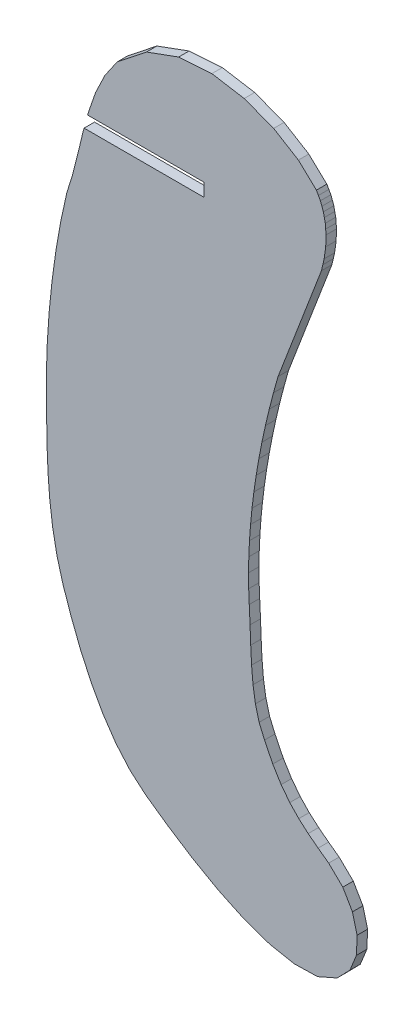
ISO-10303-21;
HEADER;
FILE_DESCRIPTION(('STEP AP214'),'2;1');
FILE_NAME('part.step','',(''),(''),'','','');
FILE_SCHEMA(('AUTOMOTIVE_DESIGN { 1 0 10303 214 1 1 1 1 }'));
ENDSEC;
DATA;
#1=APPLICATION_CONTEXT('core data for automotive mechanical design processes');
#2=APPLICATION_PROTOCOL_DEFINITION('international standard','automotive_design',2000,#1);
#3=PRODUCT_CONTEXT('',#1,'mechanical');
#4=PRODUCT('Part','Part','',(#3));
#5=PRODUCT_RELATED_PRODUCT_CATEGORY('part','',(#4));
#6=PRODUCT_DEFINITION_FORMATION('','',#4);
#7=PRODUCT_DEFINITION_CONTEXT('part definition',#1,'design');
#8=PRODUCT_DEFINITION('design','',#6,#7);
#9=PRODUCT_DEFINITION_SHAPE('','',#8);
#10=(LENGTH_UNIT() NAMED_UNIT(*) SI_UNIT(.MILLI.,.METRE.));
#11=(NAMED_UNIT(*) PLANE_ANGLE_UNIT() SI_UNIT($,.RADIAN.));
#12=(NAMED_UNIT(*) SI_UNIT($,.STERADIAN.) SOLID_ANGLE_UNIT());
#13=UNCERTAINTY_MEASURE_WITH_UNIT(LENGTH_MEASURE(1.E-05),#10,'distance_accuracy_value','');
#14=(GEOMETRIC_REPRESENTATION_CONTEXT(3) GLOBAL_UNCERTAINTY_ASSIGNED_CONTEXT((#13)) GLOBAL_UNIT_ASSIGNED_CONTEXT((#10,
#11,#12)) REPRESENTATION_CONTEXT('',''));
#15=CARTESIAN_POINT('',(0.,0.,0.));
#16=DIRECTION('',(0.,0.,1.));
#17=DIRECTION('',(1.,0.,0.));
#18=AXIS2_PLACEMENT_3D('',#15,#16,#17);
#19=CARTESIAN_POINT('',(-5212.5632,34.4901,2.));
#20=DIRECTION('',(-0.999942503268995,-0.0107233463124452,0.));
#21=DIRECTION('',(0.0107233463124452,-0.999942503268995,0.));
#22=AXIS2_PLACEMENT_3D('',#19,#20,#21);
#23=PLANE('',#22);
#24=DIRECTION('',(-0.0107233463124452,0.999942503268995,0.));
#25=VECTOR('',#24,1.);
#26=CARTESIAN_POINT('',(-5212.5632,34.4901,0.));
#27=LINE('',#26,#25);
#28=CARTESIAN_POINT('',(-5212.5632,34.4901,0.));
#29=VERTEX_POINT('',#28);
#30=CARTESIAN_POINT('',(-5212.5913,37.1104,0.));
#31=VERTEX_POINT('',#30);
#32=EDGE_CURVE('E651',#29,#31,#27,.T.);
#33=ORIENTED_EDGE('',*,*,#32,.T.);
#34=DIRECTION('',(0.,0.,-1.));
#35=VECTOR('',#34,1.);
#36=CARTESIAN_POINT('',(-5212.5913,37.1104,2.));
#37=LINE('',#36,#35);
#38=CARTESIAN_POINT('',(-5212.5913,37.1104,2.));
#39=VERTEX_POINT('',#38);
#40=EDGE_CURVE('E11',#39,#31,#37,.T.);
#41=ORIENTED_EDGE('',*,*,#40,.F.);
#42=DIRECTION('',(-0.0107233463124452,0.999942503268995,0.));
#43=VECTOR('',#42,1.);
#44=CARTESIAN_POINT('',(-5212.5632,34.4901,2.));
#45=LINE('',#44,#43);
#46=CARTESIAN_POINT('',(-5212.5632,34.4901,2.));
#47=VERTEX_POINT('',#46);
#48=EDGE_CURVE('E838',#47,#39,#45,.T.);
#49=ORIENTED_EDGE('',*,*,#48,.F.);
#50=DIRECTION('',(0.,0.,-1.));
#51=VECTOR('',#50,1.);
#52=CARTESIAN_POINT('',(-5212.5632,34.4901,2.));
#53=LINE('',#52,#51);
#54=EDGE_CURVE('E647',#47,#29,#53,.T.);
#55=ORIENTED_EDGE('',*,*,#54,.T.);
#56=EDGE_LOOP('',(#33,#41,#49,#55));
#57=FACE_BOUND('',#56,.T.);
#58=ADVANCED_FACE('F39',(#57),#23,.F.);
#59=CARTESIAN_POINT('',(-5212.5913,37.1104,2.));
#60=DIRECTION('',(-0.999818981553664,0.0190264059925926,0.));
#61=DIRECTION('',(-0.0190264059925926,-0.999818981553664,0.));
#62=AXIS2_PLACEMENT_3D('',#59,#60,#61);
#63=PLANE('',#62);
#64=DIRECTION('',(0.0190264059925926,0.999818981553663,0.));
#65=VECTOR('',#64,1.);
#66=CARTESIAN_POINT('',(-5212.5913,37.1104,0.));
#67=LINE('',#66,#65);
#68=CARTESIAN_POINT('',(-5212.5403,39.7904,0.));
#69=VERTEX_POINT('',#68);
#70=EDGE_CURVE('E654',#31,#69,#67,.T.);
#71=ORIENTED_EDGE('',*,*,#70,.T.);
#72=DIRECTION('',(0.,0.,-1.));
#73=VECTOR('',#72,1.);
#74=CARTESIAN_POINT('',(-5212.5403,39.7904,2.));
#75=LINE('',#74,#73);
#76=CARTESIAN_POINT('',(-5212.5403,39.7904,2.));
#77=VERTEX_POINT('',#76);
#78=EDGE_CURVE('E47',#77,#69,#75,.T.);
#79=ORIENTED_EDGE('',*,*,#78,.F.);
#80=DIRECTION('',(0.0190264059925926,0.999818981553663,0.));
#81=VECTOR('',#80,1.);
#82=CARTESIAN_POINT('',(-5212.5913,37.1104,2.));
#83=LINE('',#82,#81);
#84=EDGE_CURVE('E356',#39,#77,#83,.T.);
#85=ORIENTED_EDGE('',*,*,#84,.F.);
#86=ORIENTED_EDGE('',*,*,#40,.T.);
#87=EDGE_LOOP('',(#71,#79,#85,#86));
#88=FACE_BOUND('',#87,.T.);
#89=ADVANCED_FACE('F1326',(#88),#63,.F.);
#90=CARTESIAN_POINT('',(-5212.5403,39.7904,2.));
#91=DIRECTION('',(-0.998891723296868,0.0470672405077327,0.));
#92=DIRECTION('',(-0.0470672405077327,-0.998891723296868,0.));
#93=AXIS2_PLACEMENT_3D('',#90,#91,#92);
#94=PLANE('',#93);
#95=DIRECTION('',(0.0470672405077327,0.998891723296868,0.));
#96=VECTOR('',#95,1.);
#97=CARTESIAN_POINT('',(-5212.5403,39.7904,0.));
#98=LINE('',#97,#96);
#99=CARTESIAN_POINT('',(-5212.4114,42.526,0.));
#100=VERTEX_POINT('',#99);
#101=EDGE_CURVE('E656',#69,#100,#98,.T.);
#102=ORIENTED_EDGE('',*,*,#101,.T.);
#103=DIRECTION('',(0.,0.,-1.));
#104=VECTOR('',#103,1.);
#105=CARTESIAN_POINT('',(-5212.4114,42.526,2.));
#106=LINE('',#105,#104);
#107=CARTESIAN_POINT('',(-5212.4114,42.526,2.));
#108=VERTEX_POINT('',#107);
#109=EDGE_CURVE('E1103',#108,#100,#106,.T.);
#110=ORIENTED_EDGE('',*,*,#109,.F.);
#111=DIRECTION('',(0.0470672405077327,0.998891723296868,0.));
#112=VECTOR('',#111,1.);
#113=CARTESIAN_POINT('',(-5212.5403,39.7904,2.));
#114=LINE('',#113,#112);
#115=EDGE_CURVE('E1111',#77,#108,#114,.T.);
#116=ORIENTED_EDGE('',*,*,#115,.F.);
#117=ORIENTED_EDGE('',*,*,#78,.T.);
#118=EDGE_LOOP('',(#102,#110,#116,#117));
#119=FACE_BOUND('',#118,.T.);
#120=ADVANCED_FACE('F1109',(#119),#94,.F.);
#121=CARTESIAN_POINT('',(-5212.4114,42.526,2.));
#122=DIRECTION('',(-0.997284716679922,0.0736423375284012,0.));
#123=DIRECTION('',(-0.0736423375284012,-0.997284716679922,0.));
#124=AXIS2_PLACEMENT_3D('',#121,#122,#123);
#125=PLANE('',#124);
#126=DIRECTION('',(0.0736423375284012,0.997284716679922,0.));
#127=VECTOR('',#126,1.);
#128=CARTESIAN_POINT('',(-5212.4114,42.526,0.));
#129=LINE('',#128,#127);
#130=CARTESIAN_POINT('',(-5212.2056,45.313,0.));
#131=VERTEX_POINT('',#130);
#132=EDGE_CURVE('E658',#100,#131,#129,.T.);
#133=ORIENTED_EDGE('',*,*,#132,.T.);
#134=DIRECTION('',(0.,0.,-1.));
#135=VECTOR('',#134,1.);
#136=CARTESIAN_POINT('',(-5212.2056,45.313,2.));
#137=LINE('',#136,#135);
#138=CARTESIAN_POINT('',(-5212.2056,45.313,2.));
#139=VERTEX_POINT('',#138);
#140=EDGE_CURVE('E1100',#139,#131,#137,.T.);
#141=ORIENTED_EDGE('',*,*,#140,.F.);
#142=DIRECTION('',(0.0736423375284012,0.997284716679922,0.));
#143=VECTOR('',#142,1.);
#144=CARTESIAN_POINT('',(-5212.4114,42.526,2.));
#145=LINE('',#144,#143);
#146=EDGE_CURVE('E1129',#108,#139,#145,.T.);
#147=ORIENTED_EDGE('',*,*,#146,.F.);
#148=ORIENTED_EDGE('',*,*,#109,.T.);
#149=EDGE_LOOP('',(#133,#141,#147,#148));
#150=FACE_BOUND('',#149,.T.);
#151=ADVANCED_FACE('F1120',(#150),#125,.F.);
#152=CARTESIAN_POINT('',(-5212.2056,45.313,2.));
#153=DIRECTION('',(-0.99509403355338,0.0989336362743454,0.));
#154=DIRECTION('',(-0.0989336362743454,-0.99509403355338,0.));
#155=AXIS2_PLACEMENT_3D('',#152,#153,#154);
#156=PLANE('',#155);
#157=DIRECTION('',(0.0989336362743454,0.99509403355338,0.));
#158=VECTOR('',#157,1.);
#159=CARTESIAN_POINT('',(-5212.2056,45.313,0.));
#160=LINE('',#159,#158);
#161=CARTESIAN_POINT('',(-5211.9238,48.1474,0.));
#162=VERTEX_POINT('',#161);
#163=EDGE_CURVE('E660',#131,#162,#160,.T.);
#164=ORIENTED_EDGE('',*,*,#163,.T.);
#165=DIRECTION('',(0.,0.,-1.));
#166=VECTOR('',#165,1.);
#167=CARTESIAN_POINT('',(-5211.9238,48.1474,2.));
#168=LINE('',#167,#166);
#169=CARTESIAN_POINT('',(-5211.9238,48.1474,2.));
#170=VERTEX_POINT('',#169);
#171=EDGE_CURVE('E1097',#170,#162,#168,.T.);
#172=ORIENTED_EDGE('',*,*,#171,.F.);
#173=DIRECTION('',(0.0989336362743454,0.99509403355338,0.));
#174=VECTOR('',#173,1.);
#175=CARTESIAN_POINT('',(-5212.2056,45.313,2.));
#176=LINE('',#175,#174);
#177=EDGE_CURVE('E1126',#139,#170,#176,.T.);
#178=ORIENTED_EDGE('',*,*,#177,.F.);
#179=ORIENTED_EDGE('',*,*,#140,.T.);
#180=EDGE_LOOP('',(#164,#172,#178,#179));
#181=FACE_BOUND('',#180,.T.);
#182=ADVANCED_FACE('F1124',(#181),#156,.F.);
#183=CARTESIAN_POINT('',(-5211.9238,48.1474,2.));
#184=DIRECTION('',(-0.992405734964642,0.123007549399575,0.));
#185=DIRECTION('',(-0.123007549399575,-0.992405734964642,0.));
#186=AXIS2_PLACEMENT_3D('',#183,#184,#185);
#187=PLANE('',#186);
#188=DIRECTION('',(0.123007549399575,0.992405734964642,0.));
#189=VECTOR('',#188,1.);
#190=CARTESIAN_POINT('',(-5211.9238,48.1474,0.));
#191=LINE('',#190,#189);
#192=CARTESIAN_POINT('',(-5211.5671,51.0252,0.));
#193=VERTEX_POINT('',#192);
#194=EDGE_CURVE('E662',#162,#193,#191,.T.);
#195=ORIENTED_EDGE('',*,*,#194,.T.);
#196=DIRECTION('',(0.,0.,-1.));
#197=VECTOR('',#196,1.);
#198=CARTESIAN_POINT('',(-5211.5671,51.0252,2.));
#199=LINE('',#198,#197);
#200=CARTESIAN_POINT('',(-5211.5671,51.0252,2.));
#201=VERTEX_POINT('',#200);
#202=EDGE_CURVE('E1094',#201,#193,#199,.T.);
#203=ORIENTED_EDGE('',*,*,#202,.F.);
#204=DIRECTION('',(0.123007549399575,0.992405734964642,0.));
#205=VECTOR('',#204,1.);
#206=CARTESIAN_POINT('',(-5211.9238,48.1474,2.));
#207=LINE('',#206,#205);
#208=EDGE_CURVE('E1128',#170,#201,#207,.T.);
#209=ORIENTED_EDGE('',*,*,#208,.F.);
#210=ORIENTED_EDGE('',*,*,#171,.T.);
#211=EDGE_LOOP('',(#195,#203,#209,#210));
#212=FACE_BOUND('',#211,.T.);
#213=ADVANCED_FACE('F1339',(#212),#187,.F.);
#214=CARTESIAN_POINT('',(-5211.5671,51.0252,2.));
#215=DIRECTION('',(-0.989266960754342,0.14611940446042,0.));
#216=DIRECTION('',(-0.14611940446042,-0.989266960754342,0.));
#217=AXIS2_PLACEMENT_3D('',#214,#215,#216);
#218=PLANE('',#217);
#219=DIRECTION('',(0.14611940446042,0.989266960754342,0.));
#220=VECTOR('',#219,1.);
#221=CARTESIAN_POINT('',(-5211.5671,51.0252,0.));
#222=LINE('',#221,#220);
#223=CARTESIAN_POINT('',(-5211.1279,53.9987,0.));
#224=VERTEX_POINT('',#223);
#225=EDGE_CURVE('E664',#193,#224,#222,.T.);
#226=ORIENTED_EDGE('',*,*,#225,.T.);
#227=DIRECTION('',(0.,0.,-1.));
#228=VECTOR('',#227,1.);
#229=CARTESIAN_POINT('',(-5211.1279,53.9987,2.));
#230=LINE('',#229,#228);
#231=CARTESIAN_POINT('',(-5211.1279,53.9987,2.));
#232=VERTEX_POINT('',#231);
#233=EDGE_CURVE('E1091',#232,#224,#230,.T.);
#234=ORIENTED_EDGE('',*,*,#233,.F.);
#235=DIRECTION('',(0.14611940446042,0.989266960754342,0.));
#236=VECTOR('',#235,1.);
#237=CARTESIAN_POINT('',(-5211.5671,51.0252,2.));
#238=LINE('',#237,#236);
#239=EDGE_CURVE('E1131',#201,#232,#238,.T.);
#240=ORIENTED_EDGE('',*,*,#239,.F.);
#241=ORIENTED_EDGE('',*,*,#202,.T.);
#242=EDGE_LOOP('',(#226,#234,#240,#241));
#243=FACE_BOUND('',#242,.T.);
#244=ADVANCED_FACE('F1342',(#243),#218,.F.);
#245=CARTESIAN_POINT('',(-5211.1279,53.9987,2.));
#246=DIRECTION('',(-0.985682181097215,0.168613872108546,0.));
#247=DIRECTION('',(-0.168613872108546,-0.985682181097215,0.));
#248=AXIS2_PLACEMENT_3D('',#245,#246,#247);
#249=PLANE('',#248);
#250=DIRECTION('',(0.168613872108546,0.985682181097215,0.));
#251=VECTOR('',#250,1.);
#252=CARTESIAN_POINT('',(-5211.1279,53.9987,0.));
#253=LINE('',#252,#251);
#254=CARTESIAN_POINT('',(-5210.613,57.0087,0.));
#255=VERTEX_POINT('',#254);
#256=EDGE_CURVE('E666',#224,#255,#253,.T.);
#257=ORIENTED_EDGE('',*,*,#256,.T.);
#258=DIRECTION('',(0.,0.,-1.));
#259=VECTOR('',#258,1.);
#260=CARTESIAN_POINT('',(-5210.613,57.0087,2.));
#261=LINE('',#260,#259);
#262=CARTESIAN_POINT('',(-5210.613,57.0087,2.));
#263=VERTEX_POINT('',#262);
#264=EDGE_CURVE('E1088',#263,#255,#261,.T.);
#265=ORIENTED_EDGE('',*,*,#264,.F.);
#266=DIRECTION('',(0.168613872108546,0.985682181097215,0.));
#267=VECTOR('',#266,1.);
#268=CARTESIAN_POINT('',(-5211.1279,53.9987,2.));
#269=LINE('',#268,#267);
#270=EDGE_CURVE('E1137',#232,#263,#269,.T.);
#271=ORIENTED_EDGE('',*,*,#270,.F.);
#272=ORIENTED_EDGE('',*,*,#233,.T.);
#273=EDGE_LOOP('',(#257,#265,#271,#272));
#274=FACE_BOUND('',#273,.T.);
#275=ADVANCED_FACE('F1346',(#274),#249,.F.);
#276=CARTESIAN_POINT('',(-5210.613,57.0087,2.));
#277=DIRECTION('',(-0.981762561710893,0.19011121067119,0.));
#278=DIRECTION('',(-0.19011121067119,-0.981762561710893,0.));
#279=AXIS2_PLACEMENT_3D('',#276,#277,#278);
#280=PLANE('',#279);
#281=DIRECTION('',(0.19011121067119,0.981762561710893,0.));
#282=VECTOR('',#281,1.);
#283=CARTESIAN_POINT('',(-5210.613,57.0087,0.));
#284=LINE('',#283,#282);
#285=CARTESIAN_POINT('',(-5210.0239,60.0509,0.));
#286=VERTEX_POINT('',#285);
#287=EDGE_CURVE('E668',#255,#286,#284,.T.);
#288=ORIENTED_EDGE('',*,*,#287,.T.);
#289=DIRECTION('',(0.,0.,-1.));
#290=VECTOR('',#289,1.);
#291=CARTESIAN_POINT('',(-5210.0239,60.0509,2.));
#292=LINE('',#291,#290);
#293=CARTESIAN_POINT('',(-5210.0239,60.0509,2.));
#294=VERTEX_POINT('',#293);
#295=EDGE_CURVE('E1085',#294,#286,#292,.T.);
#296=ORIENTED_EDGE('',*,*,#295,.F.);
#297=DIRECTION('',(0.19011121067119,0.981762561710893,0.));
#298=VECTOR('',#297,1.);
#299=CARTESIAN_POINT('',(-5210.613,57.0087,2.));
#300=LINE('',#299,#298);
#301=EDGE_CURVE('E1139',#263,#294,#300,.T.);
#302=ORIENTED_EDGE('',*,*,#301,.F.);
#303=ORIENTED_EDGE('',*,*,#264,.T.);
#304=EDGE_LOOP('',(#288,#296,#302,#303));
#305=FACE_BOUND('',#304,.T.);
#306=ADVANCED_FACE('F1350',(#305),#280,.F.);
#307=CARTESIAN_POINT('',(-5210.0239,60.0509,2.));
#308=DIRECTION('',(-0.977523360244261,0.210827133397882,0.));
#309=DIRECTION('',(-0.210827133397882,-0.977523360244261,0.));
#310=AXIS2_PLACEMENT_3D('',#307,#308,#309);
#311=PLANE('',#310);
#312=DIRECTION('',(0.210827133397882,0.977523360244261,0.));
#313=VECTOR('',#312,1.);
#314=CARTESIAN_POINT('',(-5210.0239,60.0509,0.));
#315=LINE('',#314,#313);
#316=CARTESIAN_POINT('',(-5209.3618,63.1208,0.));
#317=VERTEX_POINT('',#316);
#318=EDGE_CURVE('E670',#286,#317,#315,.T.);
#319=ORIENTED_EDGE('',*,*,#318,.T.);
#320=DIRECTION('',(0.,0.,-1.));
#321=VECTOR('',#320,1.);
#322=CARTESIAN_POINT('',(-5209.3618,63.1208,2.));
#323=LINE('',#322,#321);
#324=CARTESIAN_POINT('',(-5209.3618,63.1208,2.));
#325=VERTEX_POINT('',#324);
#326=EDGE_CURVE('E1082',#325,#317,#323,.T.);
#327=ORIENTED_EDGE('',*,*,#326,.F.);
#328=DIRECTION('',(0.210827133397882,0.977523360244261,0.));
#329=VECTOR('',#328,1.);
#330=CARTESIAN_POINT('',(-5210.0239,60.0509,2.));
#331=LINE('',#330,#329);
#332=EDGE_CURVE('E1141',#294,#325,#331,.T.);
#333=ORIENTED_EDGE('',*,*,#332,.F.);
#334=ORIENTED_EDGE('',*,*,#295,.T.);
#335=EDGE_LOOP('',(#319,#327,#333,#334));
#336=FACE_BOUND('',#335,.T.);
#337=ADVANCED_FACE('F1354',(#336),#311,.F.);
#338=CARTESIAN_POINT('',(-5209.3618,63.1208,2.));
#339=DIRECTION('',(-0.972954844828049,0.230995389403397,0.));
#340=DIRECTION('',(-0.230995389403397,-0.972954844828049,0.));
#341=AXIS2_PLACEMENT_3D('',#338,#339,#340);
#342=PLANE('',#341);
#343=DIRECTION('',(0.230995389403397,0.972954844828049,0.));
#344=VECTOR('',#343,1.);
#345=CARTESIAN_POINT('',(-5209.3618,63.1208,0.));
#346=LINE('',#345,#344);
#347=CARTESIAN_POINT('',(-5208.6274,66.2141,0.));
#348=VERTEX_POINT('',#347);
#349=EDGE_CURVE('E672',#317,#348,#346,.T.);
#350=ORIENTED_EDGE('',*,*,#349,.T.);
#351=DIRECTION('',(0.,0.,-1.));
#352=VECTOR('',#351,1.);
#353=CARTESIAN_POINT('',(-5208.6274,66.2141,2.));
#354=LINE('',#353,#352);
#355=CARTESIAN_POINT('',(-5208.6274,66.2141,2.));
#356=VERTEX_POINT('',#355);
#357=EDGE_CURVE('E1079',#356,#348,#354,.T.);
#358=ORIENTED_EDGE('',*,*,#357,.F.);
#359=DIRECTION('',(0.230995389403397,0.972954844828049,0.));
#360=VECTOR('',#359,1.);
#361=CARTESIAN_POINT('',(-5209.3618,63.1208,2.));
#362=LINE('',#361,#360);
#363=EDGE_CURVE('E1143',#325,#356,#362,.T.);
#364=ORIENTED_EDGE('',*,*,#363,.F.);
#365=ORIENTED_EDGE('',*,*,#326,.T.);
#366=EDGE_LOOP('',(#350,#358,#364,#365));
#367=FACE_BOUND('',#366,.T.);
#368=ADVANCED_FACE('F1358',(#367),#342,.F.);
#369=CARTESIAN_POINT('',(-5208.6274,66.2141,2.));
#370=DIRECTION('',(-0.968111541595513,0.250519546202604,0.));
#371=DIRECTION('',(-0.250519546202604,-0.968111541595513,0.));
#372=AXIS2_PLACEMENT_3D('',#369,#370,#371);
#373=PLANE('',#372);
#374=DIRECTION('',(0.250519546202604,0.968111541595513,0.));
#375=VECTOR('',#374,1.);
#376=CARTESIAN_POINT('',(-5208.6274,66.2141,0.));
#377=LINE('',#376,#375);
#378=CARTESIAN_POINT('',(-5207.822,69.3265,0.));
#379=VERTEX_POINT('',#378);
#380=EDGE_CURVE('E674',#348,#379,#377,.T.);
#381=ORIENTED_EDGE('',*,*,#380,.T.);
#382=DIRECTION('',(0.,0.,-1.));
#383=VECTOR('',#382,1.);
#384=CARTESIAN_POINT('',(-5207.822,69.3265,2.));
#385=LINE('',#384,#383);
#386=CARTESIAN_POINT('',(-5207.822,69.3265,2.));
#387=VERTEX_POINT('',#386);
#388=EDGE_CURVE('E1076',#387,#379,#385,.T.);
#389=ORIENTED_EDGE('',*,*,#388,.F.);
#390=DIRECTION('',(0.250519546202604,0.968111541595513,0.));
#391=VECTOR('',#390,1.);
#392=CARTESIAN_POINT('',(-5208.6274,66.2141,2.));
#393=LINE('',#392,#391);
#394=EDGE_CURVE('E1145',#356,#387,#393,.T.);
#395=ORIENTED_EDGE('',*,*,#394,.F.);
#396=ORIENTED_EDGE('',*,*,#357,.T.);
#397=EDGE_LOOP('',(#381,#389,#395,#396));
#398=FACE_BOUND('',#397,.T.);
#399=ADVANCED_FACE('F1362',(#398),#373,.F.);
#400=CARTESIAN_POINT('',(-5207.822,69.3265,2.));
#401=DIRECTION('',(-0.962999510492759,0.269503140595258,0.));
#402=DIRECTION('',(-0.269503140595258,-0.962999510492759,0.));
#403=AXIS2_PLACEMENT_3D('',#400,#401,#402);
#404=PLANE('',#403);
#405=DIRECTION('',(0.269503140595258,0.962999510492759,0.));
#406=VECTOR('',#405,1.);
#407=CARTESIAN_POINT('',(-5207.822,69.3265,0.));
#408=LINE('',#407,#406);
#409=CARTESIAN_POINT('',(-5206.9468,72.4538,0.));
#410=VERTEX_POINT('',#409);
#411=EDGE_CURVE('E676',#379,#410,#408,.T.);
#412=ORIENTED_EDGE('',*,*,#411,.T.);
#413=DIRECTION('',(0.,0.,-1.));
#414=VECTOR('',#413,1.);
#415=CARTESIAN_POINT('',(-5206.9468,72.4538,2.));
#416=LINE('',#415,#414);
#417=CARTESIAN_POINT('',(-5206.9468,72.4538,2.));
#418=VERTEX_POINT('',#417);
#419=EDGE_CURVE('E1073',#418,#410,#416,.T.);
#420=ORIENTED_EDGE('',*,*,#419,.F.);
#421=DIRECTION('',(0.269503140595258,0.962999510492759,0.));
#422=VECTOR('',#421,1.);
#423=CARTESIAN_POINT('',(-5207.822,69.3265,2.));
#424=LINE('',#423,#422);
#425=EDGE_CURVE('E1147',#387,#418,#424,.T.);
#426=ORIENTED_EDGE('',*,*,#425,.F.);
#427=ORIENTED_EDGE('',*,*,#388,.T.);
#428=EDGE_LOOP('',(#412,#420,#426,#427));
#429=FACE_BOUND('',#428,.T.);
#430=ADVANCED_FACE('F1366',(#429),#404,.F.);
#431=CARTESIAN_POINT('',(-5206.9468,72.4538,2.));
#432=DIRECTION('',(-0.933883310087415,0.357577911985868,0.));
#433=DIRECTION('',(-0.357577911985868,-0.933883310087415,0.));
#434=AXIS2_PLACEMENT_3D('',#431,#432,#433);
#435=PLANE('',#434);
#436=DIRECTION('',(0.357577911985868,0.933883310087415,0.));
#437=VECTOR('',#436,1.);
#438=CARTESIAN_POINT('',(-5206.9468,72.4538,0.));
#439=LINE('',#438,#437);
#440=CARTESIAN_POINT('',(-5198.6333,94.1661,0.));
#441=VERTEX_POINT('',#440);
#442=EDGE_CURVE('E678',#410,#441,#439,.T.);
#443=ORIENTED_EDGE('',*,*,#442,.T.);
#444=DIRECTION('',(0.,0.,-1.));
#445=VECTOR('',#444,1.);
#446=CARTESIAN_POINT('',(-5198.6333,94.1661,2.));
#447=LINE('',#446,#445);
#448=CARTESIAN_POINT('',(-5198.6333,94.1661,2.));
#449=VERTEX_POINT('',#448);
#450=EDGE_CURVE('E1070',#449,#441,#447,.T.);
#451=ORIENTED_EDGE('',*,*,#450,.F.);
#452=DIRECTION('',(0.357577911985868,0.933883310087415,0.));
#453=VECTOR('',#452,1.);
#454=CARTESIAN_POINT('',(-5206.9468,72.4538,2.));
#455=LINE('',#454,#453);
#456=EDGE_CURVE('E1149',#418,#449,#455,.T.);
#457=ORIENTED_EDGE('',*,*,#456,.F.);
#458=ORIENTED_EDGE('',*,*,#419,.T.);
#459=EDGE_LOOP('',(#443,#451,#457,#458));
#460=FACE_BOUND('',#459,.T.);
#461=ADVANCED_FACE('F1370',(#460),#435,.F.);
#462=CARTESIAN_POINT('',(-5198.6333,94.1661,2.));
#463=DIRECTION('',(-0.974133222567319,0.225974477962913,0.));
#464=DIRECTION('',(-0.225974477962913,-0.974133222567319,0.));
#465=AXIS2_PLACEMENT_3D('',#462,#463,#464);
#466=PLANE('',#465);
#467=DIRECTION('',(0.225974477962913,0.974133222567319,0.));
#468=VECTOR('',#467,1.);
#469=CARTESIAN_POINT('',(-5198.6333,94.1661,0.));
#470=LINE('',#469,#468);
#471=CARTESIAN_POINT('',(-5198.3743,95.2826,0.));
#472=VERTEX_POINT('',#471);
#473=EDGE_CURVE('E680',#441,#472,#470,.T.);
#474=ORIENTED_EDGE('',*,*,#473,.T.);
#475=DIRECTION('',(0.,0.,-1.));
#476=VECTOR('',#475,1.);
#477=CARTESIAN_POINT('',(-5198.3743,95.2826,2.));
#478=LINE('',#477,#476);
#479=CARTESIAN_POINT('',(-5198.3743,95.2826,2.));
#480=VERTEX_POINT('',#479);
#481=EDGE_CURVE('E1067',#480,#472,#478,.T.);
#482=ORIENTED_EDGE('',*,*,#481,.F.);
#483=DIRECTION('',(0.225974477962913,0.974133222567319,0.));
#484=VECTOR('',#483,1.);
#485=CARTESIAN_POINT('',(-5198.6333,94.1661,2.));
#486=LINE('',#485,#484);
#487=EDGE_CURVE('E1151',#449,#480,#486,.T.);
#488=ORIENTED_EDGE('',*,*,#487,.F.);
#489=ORIENTED_EDGE('',*,*,#450,.T.);
#490=EDGE_LOOP('',(#474,#482,#488,#489));
#491=FACE_BOUND('',#490,.T.);
#492=ADVANCED_FACE('F1374',(#491),#466,.F.);
#493=CARTESIAN_POINT('',(-5198.3743,95.2826,2.));
#494=DIRECTION('',(-0.974109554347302,0.226076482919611,0.));
#495=DIRECTION('',(-0.226076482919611,-0.974109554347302,0.));
#496=AXIS2_PLACEMENT_3D('',#493,#494,#495);
#497=PLANE('',#496);
#498=DIRECTION('',(0.226076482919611,0.974109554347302,0.));
#499=VECTOR('',#498,1.);
#500=CARTESIAN_POINT('',(-5198.3743,95.2826,0.));
#501=LINE('',#500,#499);
#502=CARTESIAN_POINT('',(-5198.1152,96.399,0.));
#503=VERTEX_POINT('',#502);
#504=EDGE_CURVE('E682',#472,#503,#501,.T.);
#505=ORIENTED_EDGE('',*,*,#504,.T.);
#506=DIRECTION('',(0.,0.,-1.));
#507=VECTOR('',#506,1.);
#508=CARTESIAN_POINT('',(-5198.1152,96.399,2.));
#509=LINE('',#508,#507);
#510=CARTESIAN_POINT('',(-5198.1152,96.399,2.));
#511=VERTEX_POINT('',#510);
#512=EDGE_CURVE('E1064',#511,#503,#509,.T.);
#513=ORIENTED_EDGE('',*,*,#512,.F.);
#514=DIRECTION('',(0.226076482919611,0.974109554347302,0.));
#515=VECTOR('',#514,1.);
#516=CARTESIAN_POINT('',(-5198.3743,95.2826,2.));
#517=LINE('',#516,#515);
#518=EDGE_CURVE('E1153',#480,#511,#517,.T.);
#519=ORIENTED_EDGE('',*,*,#518,.F.);
#520=ORIENTED_EDGE('',*,*,#481,.T.);
#521=EDGE_LOOP('',(#505,#513,#519,#520));
#522=FACE_BOUND('',#521,.T.);
#523=ADVANCED_FACE('F1378',(#522),#497,.F.);
#524=CARTESIAN_POINT('',(-5198.1152,96.399,2.));
#525=DIRECTION('',(-0.990785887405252,0.135437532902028,0.));
#526=DIRECTION('',(-0.135437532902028,-0.990785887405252,0.));
#527=AXIS2_PLACEMENT_3D('',#524,#525,#526);
#528=PLANE('',#527);
#529=DIRECTION('',(0.135437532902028,0.990785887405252,0.));
#530=VECTOR('',#529,1.);
#531=CARTESIAN_POINT('',(-5198.1152,96.399,0.));
#532=LINE('',#531,#530);
#533=CARTESIAN_POINT('',(-5197.8245,98.5256,0.));
#534=VERTEX_POINT('',#533);
#535=EDGE_CURVE('E684',#503,#534,#532,.T.);
#536=ORIENTED_EDGE('',*,*,#535,.T.);
#537=DIRECTION('',(0.,0.,-1.));
#538=VECTOR('',#537,1.);
#539=CARTESIAN_POINT('',(-5197.8245,98.5256,2.));
#540=LINE('',#539,#538);
#541=CARTESIAN_POINT('',(-5197.8245,98.5256,2.));
#542=VERTEX_POINT('',#541);
#543=EDGE_CURVE('E1061',#542,#534,#540,.T.);
#544=ORIENTED_EDGE('',*,*,#543,.F.);
#545=DIRECTION('',(0.135437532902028,0.990785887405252,0.));
#546=VECTOR('',#545,1.);
#547=CARTESIAN_POINT('',(-5198.1152,96.399,2.));
#548=LINE('',#547,#546);
#549=EDGE_CURVE('E1155',#511,#542,#548,.T.);
#550=ORIENTED_EDGE('',*,*,#549,.F.);
#551=ORIENTED_EDGE('',*,*,#512,.T.);
#552=EDGE_LOOP('',(#536,#544,#550,#551));
#553=FACE_BOUND('',#552,.T.);
#554=ADVANCED_FACE('F1382',(#553),#528,.F.);
#555=CARTESIAN_POINT('',(-5197.8245,98.5256,2.));
#556=DIRECTION('',(-0.999415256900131,0.0341927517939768,0.));
#557=DIRECTION('',(-0.0341927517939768,-0.999415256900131,0.));
#558=AXIS2_PLACEMENT_3D('',#555,#556,#557);
#559=PLANE('',#558);
#560=DIRECTION('',(0.0341927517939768,0.999415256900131,0.));
#561=VECTOR('',#560,1.);
#562=CARTESIAN_POINT('',(-5197.8245,98.5256,0.));
#563=LINE('',#562,#561);
#564=CARTESIAN_POINT('',(-5197.7559,100.5307,0.));
#565=VERTEX_POINT('',#564);
#566=EDGE_CURVE('E686',#534,#565,#563,.T.);
#567=ORIENTED_EDGE('',*,*,#566,.T.);
#568=DIRECTION('',(0.,0.,-1.));
#569=VECTOR('',#568,1.);
#570=CARTESIAN_POINT('',(-5197.7559,100.5307,2.));
#571=LINE('',#570,#569);
#572=CARTESIAN_POINT('',(-5197.7559,100.5307,2.));
#573=VERTEX_POINT('',#572);
#574=EDGE_CURVE('E1058',#573,#565,#571,.T.);
#575=ORIENTED_EDGE('',*,*,#574,.F.);
#576=DIRECTION('',(0.0341927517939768,0.999415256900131,0.));
#577=VECTOR('',#576,1.);
#578=CARTESIAN_POINT('',(-5197.8245,98.5256,2.));
#579=LINE('',#578,#577);
#580=EDGE_CURVE('E1157',#542,#573,#579,.T.);
#581=ORIENTED_EDGE('',*,*,#580,.F.);
#582=ORIENTED_EDGE('',*,*,#543,.T.);
#583=EDGE_LOOP('',(#567,#575,#581,#582));
#584=FACE_BOUND('',#583,.T.);
#585=ADVANCED_FACE('F1386',(#584),#559,.F.);
#586=CARTESIAN_POINT('',(-5197.7559,100.5307,2.));
#587=DIRECTION('',(-0.996843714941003,-0.0793889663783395,0.));
#588=DIRECTION('',(0.0793889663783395,-0.996843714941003,0.));
#589=AXIS2_PLACEMENT_3D('',#586,#587,#588);
#590=PLANE('',#589);
#591=DIRECTION('',(-0.0793889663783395,0.996843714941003,0.));
#592=VECTOR('',#591,1.);
#593=CARTESIAN_POINT('',(-5197.7559,100.5307,0.));
#594=LINE('',#593,#592);
#595=CARTESIAN_POINT('',(-5197.8303,101.4649,0.));
#596=VERTEX_POINT('',#595);
#597=EDGE_CURVE('E688',#565,#596,#594,.T.);
#598=ORIENTED_EDGE('',*,*,#597,.T.);
#599=DIRECTION('',(0.,0.,-1.));
#600=VECTOR('',#599,1.);
#601=CARTESIAN_POINT('',(-5197.8303,101.4649,2.));
#602=LINE('',#601,#600);
#603=CARTESIAN_POINT('',(-5197.8303,101.4649,2.));
#604=VERTEX_POINT('',#603);
#605=EDGE_CURVE('E1055',#604,#596,#602,.T.);
#606=ORIENTED_EDGE('',*,*,#605,.F.);
#607=DIRECTION('',(-0.0793889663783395,0.996843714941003,0.));
#608=VECTOR('',#607,1.);
#609=CARTESIAN_POINT('',(-5197.7559,100.5307,2.));
#610=LINE('',#609,#608);
#611=EDGE_CURVE('E1159',#573,#604,#610,.T.);
#612=ORIENTED_EDGE('',*,*,#611,.F.);
#613=ORIENTED_EDGE('',*,*,#574,.T.);
#614=EDGE_LOOP('',(#598,#606,#612,#613));
#615=FACE_BOUND('',#614,.T.);
#616=ADVANCED_FACE('F1390',(#615),#590,.F.);
#617=CARTESIAN_POINT('',(-5197.8303,101.4649,2.));
#618=DIRECTION('',(-0.996835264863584,-0.079494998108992,0.));
#619=DIRECTION('',(0.079494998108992,-0.996835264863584,0.));
#620=AXIS2_PLACEMENT_3D('',#617,#618,#619);
#621=PLANE('',#620);
#622=DIRECTION('',(-0.079494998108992,0.996835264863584,0.));
#623=VECTOR('',#622,1.);
#624=CARTESIAN_POINT('',(-5197.8303,101.4649,0.));
#625=LINE('',#624,#623);
#626=CARTESIAN_POINT('',(-5197.9048,102.3991,0.));
#627=VERTEX_POINT('',#626);
#628=EDGE_CURVE('E690',#596,#627,#625,.T.);
#629=ORIENTED_EDGE('',*,*,#628,.T.);
#630=DIRECTION('',(0.,0.,-1.));
#631=VECTOR('',#630,1.);
#632=CARTESIAN_POINT('',(-5197.9048,102.3991,2.));
#633=LINE('',#632,#631);
#634=CARTESIAN_POINT('',(-5197.9048,102.3991,2.));
#635=VERTEX_POINT('',#634);
#636=EDGE_CURVE('E1052',#635,#627,#633,.T.);
#637=ORIENTED_EDGE('',*,*,#636,.F.);
#638=DIRECTION('',(-0.079494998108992,0.996835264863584,0.));
#639=VECTOR('',#638,1.);
#640=CARTESIAN_POINT('',(-5197.8303,101.4649,2.));
#641=LINE('',#640,#639);
#642=EDGE_CURVE('E1161',#604,#635,#641,.T.);
#643=ORIENTED_EDGE('',*,*,#642,.F.);
#644=ORIENTED_EDGE('',*,*,#605,.T.);
#645=EDGE_LOOP('',(#629,#637,#643,#644));
#646=FACE_BOUND('',#645,.T.);
#647=ADVANCED_FACE('F1394',(#646),#621,.F.);
#648=CARTESIAN_POINT('',(-5197.9048,102.3991,2.));
#649=DIRECTION('',(-0.978576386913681,-0.205884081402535,0.));
#650=DIRECTION('',(0.205884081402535,-0.978576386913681,0.));
#651=AXIS2_PLACEMENT_3D('',#648,#649,#650);
#652=PLANE('',#651);
#653=DIRECTION('',(-0.205884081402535,0.978576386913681,0.));
#654=VECTOR('',#653,1.);
#655=CARTESIAN_POINT('',(-5197.9048,102.3991,0.));
#656=LINE('',#655,#654);
#657=CARTESIAN_POINT('',(-5198.0854,103.2575,0.));
#658=VERTEX_POINT('',#657);
#659=EDGE_CURVE('E692',#627,#658,#656,.T.);
#660=ORIENTED_EDGE('',*,*,#659,.T.);
#661=DIRECTION('',(0.,0.,-1.));
#662=VECTOR('',#661,1.);
#663=CARTESIAN_POINT('',(-5198.0854,103.2575,2.));
#664=LINE('',#663,#662);
#665=CARTESIAN_POINT('',(-5198.0854,103.2575,2.));
#666=VERTEX_POINT('',#665);
#667=EDGE_CURVE('E1049',#666,#658,#664,.T.);
#668=ORIENTED_EDGE('',*,*,#667,.F.);
#669=DIRECTION('',(-0.205884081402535,0.978576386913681,0.));
#670=VECTOR('',#669,1.);
#671=CARTESIAN_POINT('',(-5197.9048,102.3991,2.));
#672=LINE('',#671,#670);
#673=EDGE_CURVE('E1163',#635,#666,#672,.T.);
#674=ORIENTED_EDGE('',*,*,#673,.F.);
#675=ORIENTED_EDGE('',*,*,#636,.T.);
#676=EDGE_LOOP('',(#660,#668,#674,#675));
#677=FACE_BOUND('',#676,.T.);
#678=ADVANCED_FACE('F1398',(#677),#652,.F.);
#679=CARTESIAN_POINT('',(-5198.0854,103.2575,2.));
#680=DIRECTION('',(-0.978589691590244,-0.205820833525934,0.));
#681=DIRECTION('',(0.205820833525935,-0.978589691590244,0.));
#682=AXIS2_PLACEMENT_3D('',#679,#680,#681);
#683=PLANE('',#682);
#684=DIRECTION('',(-0.205820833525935,0.978589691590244,0.));
#685=VECTOR('',#684,1.);
#686=CARTESIAN_POINT('',(-5198.0854,103.2575,0.));
#687=LINE('',#686,#685);
#688=CARTESIAN_POINT('',(-5198.2659,104.1157,0.));
#689=VERTEX_POINT('',#688);
#690=EDGE_CURVE('E694',#658,#689,#687,.T.);
#691=ORIENTED_EDGE('',*,*,#690,.T.);
#692=DIRECTION('',(0.,0.,-1.));
#693=VECTOR('',#692,1.);
#694=CARTESIAN_POINT('',(-5198.2659,104.1157,2.));
#695=LINE('',#694,#693);
#696=CARTESIAN_POINT('',(-5198.2659,104.1157,2.));
#697=VERTEX_POINT('',#696);
#698=EDGE_CURVE('E1046',#697,#689,#695,.T.);
#699=ORIENTED_EDGE('',*,*,#698,.F.);
#700=DIRECTION('',(-0.205820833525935,0.978589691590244,0.));
#701=VECTOR('',#700,1.);
#702=CARTESIAN_POINT('',(-5198.0854,103.2575,2.));
#703=LINE('',#702,#701);
#704=EDGE_CURVE('E1165',#666,#697,#703,.T.);
#705=ORIENTED_EDGE('',*,*,#704,.F.);
#706=ORIENTED_EDGE('',*,*,#667,.T.);
#707=EDGE_LOOP('',(#691,#699,#705,#706));
#708=FACE_BOUND('',#707,.T.);
#709=ADVANCED_FACE('F1402',(#708),#683,.F.);
#710=CARTESIAN_POINT('',(-5198.2659,104.1157,2.));
#711=DIRECTION('',(-0.938741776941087,-0.344621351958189,0.));
#712=DIRECTION('',(0.344621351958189,-0.938741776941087,0.));
#713=AXIS2_PLACEMENT_3D('',#710,#711,#712);
#714=PLANE('',#713);
#715=DIRECTION('',(-0.344621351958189,0.938741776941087,0.));
#716=VECTOR('',#715,1.);
#717=CARTESIAN_POINT('',(-5198.2659,104.1157,0.));
#718=LINE('',#717,#716);
#719=CARTESIAN_POINT('',(-5198.5503,104.8904,0.));
#720=VERTEX_POINT('',#719);
#721=EDGE_CURVE('E696',#689,#720,#718,.T.);
#722=ORIENTED_EDGE('',*,*,#721,.T.);
#723=DIRECTION('',(0.,0.,-1.));
#724=VECTOR('',#723,1.);
#725=CARTESIAN_POINT('',(-5198.5503,104.8904,2.));
#726=LINE('',#725,#724);
#727=CARTESIAN_POINT('',(-5198.5503,104.8904,2.));
#728=VERTEX_POINT('',#727);
#729=EDGE_CURVE('E1043',#728,#720,#726,.T.);
#730=ORIENTED_EDGE('',*,*,#729,.F.);
#731=DIRECTION('',(-0.344621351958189,0.938741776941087,0.));
#732=VECTOR('',#731,1.);
#733=CARTESIAN_POINT('',(-5198.2659,104.1157,2.));
#734=LINE('',#733,#732);
#735=EDGE_CURVE('E1167',#697,#728,#734,.T.);
#736=ORIENTED_EDGE('',*,*,#735,.F.);
#737=ORIENTED_EDGE('',*,*,#698,.T.);
#738=EDGE_LOOP('',(#722,#730,#736,#737));
#739=FACE_BOUND('',#738,.T.);
#740=ADVANCED_FACE('F1406',(#739),#714,.F.);
#741=CARTESIAN_POINT('',(-5198.5503,104.8904,2.));
#742=DIRECTION('',(-0.938805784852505,-0.34444694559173,0.));
#743=DIRECTION('',(0.34444694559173,-0.938805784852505,0.));
#744=AXIS2_PLACEMENT_3D('',#741,#742,#743);
#745=PLANE('',#744);
#746=DIRECTION('',(-0.34444694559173,0.938805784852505,0.));
#747=VECTOR('',#746,1.);
#748=CARTESIAN_POINT('',(-5198.5503,104.8904,0.));
#749=LINE('',#748,#747);
#750=CARTESIAN_POINT('',(-5198.8345,105.665,0.));
#751=VERTEX_POINT('',#750);
#752=EDGE_CURVE('E698',#720,#751,#749,.T.);
#753=ORIENTED_EDGE('',*,*,#752,.T.);
#754=DIRECTION('',(0.,0.,-1.));
#755=VECTOR('',#754,1.);
#756=CARTESIAN_POINT('',(-5198.8345,105.665,2.));
#757=LINE('',#756,#755);
#758=CARTESIAN_POINT('',(-5198.8345,105.665,2.));
#759=VERTEX_POINT('',#758);
#760=EDGE_CURVE('E1040',#759,#751,#757,.T.);
#761=ORIENTED_EDGE('',*,*,#760,.F.);
#762=DIRECTION('',(-0.34444694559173,0.938805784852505,0.));
#763=VECTOR('',#762,1.);
#764=CARTESIAN_POINT('',(-5198.5503,104.8904,2.));
#765=LINE('',#764,#763);
#766=EDGE_CURVE('E1169',#728,#759,#765,.T.);
#767=ORIENTED_EDGE('',*,*,#766,.F.);
#768=ORIENTED_EDGE('',*,*,#729,.T.);
#769=EDGE_LOOP('',(#753,#761,#767,#768));
#770=FACE_BOUND('',#769,.T.);
#771=ADVANCED_FACE('F1410',(#770),#745,.F.);
#772=CARTESIAN_POINT('',(-5198.8345,105.665,2.));
#773=DIRECTION('',(-0.871013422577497,-0.491259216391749,0.));
#774=DIRECTION('',(0.491259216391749,-0.871013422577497,0.));
#775=AXIS2_PLACEMENT_3D('',#772,#773,#774);
#776=PLANE('',#775);
#777=DIRECTION('',(-0.491259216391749,0.871013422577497,0.));
#778=VECTOR('',#777,1.);
#779=CARTESIAN_POINT('',(-5198.8345,105.665,0.));
#780=LINE('',#779,#778);
#781=CARTESIAN_POINT('',(-5199.22,106.3485,0.));
#782=VERTEX_POINT('',#781);
#783=EDGE_CURVE('E700',#751,#782,#780,.T.);
#784=ORIENTED_EDGE('',*,*,#783,.T.);
#785=DIRECTION('',(0.,0.,-1.));
#786=VECTOR('',#785,1.);
#787=CARTESIAN_POINT('',(-5199.22,106.3485,2.));
#788=LINE('',#787,#786);
#789=CARTESIAN_POINT('',(-5199.22,106.3485,2.));
#790=VERTEX_POINT('',#789);
#791=EDGE_CURVE('E1037',#790,#782,#788,.T.);
#792=ORIENTED_EDGE('',*,*,#791,.F.);
#793=DIRECTION('',(-0.491259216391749,0.871013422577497,0.));
#794=VECTOR('',#793,1.);
#795=CARTESIAN_POINT('',(-5198.8345,105.665,2.));
#796=LINE('',#795,#794);
#797=EDGE_CURVE('E1171',#759,#790,#796,.T.);
#798=ORIENTED_EDGE('',*,*,#797,.F.);
#799=ORIENTED_EDGE('',*,*,#760,.T.);
#800=EDGE_LOOP('',(#784,#792,#798,#799));
#801=FACE_BOUND('',#800,.T.);
#802=ADVANCED_FACE('F1414',(#801),#776,.F.);
#803=CARTESIAN_POINT('',(-5199.22,106.3485,2.));
#804=DIRECTION('',(-0.871044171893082,-0.491204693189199,0.));
#805=DIRECTION('',(0.491204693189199,-0.871044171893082,0.));
#806=AXIS2_PLACEMENT_3D('',#803,#804,#805);
#807=PLANE('',#806);
#808=DIRECTION('',(-0.491204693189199,0.871044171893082,0.));
#809=VECTOR('',#808,1.);
#810=CARTESIAN_POINT('',(-5199.22,106.3485,0.));
#811=LINE('',#810,#809);
#812=CARTESIAN_POINT('',(-5199.6055,107.0321,0.));
#813=VERTEX_POINT('',#812);
#814=EDGE_CURVE('E702',#782,#813,#811,.T.);
#815=ORIENTED_EDGE('',*,*,#814,.T.);
#816=DIRECTION('',(0.,0.,-1.));
#817=VECTOR('',#816,1.);
#818=CARTESIAN_POINT('',(-5199.6055,107.0321,2.));
#819=LINE('',#818,#817);
#820=CARTESIAN_POINT('',(-5199.6055,107.0321,2.));
#821=VERTEX_POINT('',#820);
#822=EDGE_CURVE('E1034',#821,#813,#819,.T.);
#823=ORIENTED_EDGE('',*,*,#822,.F.);
#824=DIRECTION('',(-0.491204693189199,0.871044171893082,0.));
#825=VECTOR('',#824,1.);
#826=CARTESIAN_POINT('',(-5199.22,106.3485,2.));
#827=LINE('',#826,#825);
#828=EDGE_CURVE('E1173',#790,#821,#827,.T.);
#829=ORIENTED_EDGE('',*,*,#828,.F.);
#830=ORIENTED_EDGE('',*,*,#791,.T.);
#831=EDGE_LOOP('',(#815,#823,#829,#830));
#832=FACE_BOUND('',#831,.T.);
#833=ADVANCED_FACE('F1418',(#832),#807,.F.);
#834=CARTESIAN_POINT('',(-5199.6055,107.0321,2.));
#835=DIRECTION('',(-0.686915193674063,-0.726737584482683,0.));
#836=DIRECTION('',(0.726737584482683,-0.686915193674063,0.));
#837=AXIS2_PLACEMENT_3D('',#834,#835,#836);
#838=PLANE('',#837);
#839=DIRECTION('',(-0.726737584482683,0.686915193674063,0.));
#840=VECTOR('',#839,1.);
#841=CARTESIAN_POINT('',(-5199.6055,107.0321,0.));
#842=LINE('',#841,#840);
#843=CARTESIAN_POINT('',(-5203.0583,110.2957,0.));
#844=VERTEX_POINT('',#843);
#845=EDGE_CURVE('E704',#813,#844,#842,.T.);
#846=ORIENTED_EDGE('',*,*,#845,.T.);
#847=DIRECTION('',(0.,0.,-1.));
#848=VECTOR('',#847,1.);
#849=CARTESIAN_POINT('',(-5203.0583,110.2957,2.));
#850=LINE('',#849,#848);
#851=CARTESIAN_POINT('',(-5203.0583,110.2957,2.));
#852=VERTEX_POINT('',#851);
#853=EDGE_CURVE('E1031',#852,#844,#850,.T.);
#854=ORIENTED_EDGE('',*,*,#853,.F.);
#855=DIRECTION('',(-0.726737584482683,0.686915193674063,0.));
#856=VECTOR('',#855,1.);
#857=CARTESIAN_POINT('',(-5199.6055,107.0321,2.));
#858=LINE('',#857,#856);
#859=EDGE_CURVE('E1175',#821,#852,#858,.T.);
#860=ORIENTED_EDGE('',*,*,#859,.F.);
#861=ORIENTED_EDGE('',*,*,#822,.T.);
#862=EDGE_LOOP('',(#846,#854,#860,#861));
#863=FACE_BOUND('',#862,.T.);
#864=ADVANCED_FACE('F1422',(#863),#838,.F.);
#865=CARTESIAN_POINT('',(-5203.0583,110.2957,2.));
#866=DIRECTION('',(-0.520156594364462,-0.854070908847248,0.));
#867=DIRECTION('',(0.854070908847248,-0.520156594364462,0.));
#868=AXIS2_PLACEMENT_3D('',#865,#866,#867);
#869=PLANE('',#868);
#870=DIRECTION('',(-0.854070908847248,0.520156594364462,0.));
#871=VECTOR('',#870,1.);
#872=CARTESIAN_POINT('',(-5203.0583,110.2957,0.));
#873=LINE('',#872,#871);
#874=CARTESIAN_POINT('',(-5207.7881,113.1763,0.));
#875=VERTEX_POINT('',#874);
#876=EDGE_CURVE('E706',#844,#875,#873,.T.);
#877=ORIENTED_EDGE('',*,*,#876,.T.);
#878=DIRECTION('',(0.,0.,-1.));
#879=VECTOR('',#878,1.);
#880=CARTESIAN_POINT('',(-5207.7881,113.1763,2.));
#881=LINE('',#880,#879);
#882=CARTESIAN_POINT('',(-5207.7881,113.1763,2.));
#883=VERTEX_POINT('',#882);
#884=EDGE_CURVE('E1028',#883,#875,#881,.T.);
#885=ORIENTED_EDGE('',*,*,#884,.F.);
#886=DIRECTION('',(-0.854070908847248,0.520156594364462,0.));
#887=VECTOR('',#886,1.);
#888=CARTESIAN_POINT('',(-5203.0583,110.2957,2.));
#889=LINE('',#888,#887);
#890=EDGE_CURVE('E1177',#852,#883,#889,.T.);
#891=ORIENTED_EDGE('',*,*,#890,.F.);
#892=ORIENTED_EDGE('',*,*,#853,.T.);
#893=EDGE_LOOP('',(#877,#885,#891,#892));
#894=FACE_BOUND('',#893,.T.);
#895=ADVANCED_FACE('F1426',(#894),#869,.F.);
#896=CARTESIAN_POINT('',(-5207.7881,113.1763,2.));
#897=DIRECTION('',(-0.354382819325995,-0.935100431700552,0.));
#898=DIRECTION('',(0.935100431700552,-0.354382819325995,0.));
#899=AXIS2_PLACEMENT_3D('',#896,#897,#898);
#900=PLANE('',#899);
#901=DIRECTION('',(-0.935100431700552,0.354382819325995,0.));
#902=VECTOR('',#901,1.);
#903=CARTESIAN_POINT('',(-5207.7881,113.1763,0.));
#904=LINE('',#903,#902);
#905=CARTESIAN_POINT('',(-5213.428,115.3137,0.));
#906=VERTEX_POINT('',#905);
#907=EDGE_CURVE('E708',#875,#906,#904,.T.);
#908=ORIENTED_EDGE('',*,*,#907,.T.);
#909=DIRECTION('',(0.,0.,-1.));
#910=VECTOR('',#909,1.);
#911=CARTESIAN_POINT('',(-5213.428,115.3137,2.));
#912=LINE('',#911,#910);
#913=CARTESIAN_POINT('',(-5213.428,115.3137,2.));
#914=VERTEX_POINT('',#913);
#915=EDGE_CURVE('E1025',#914,#906,#912,.T.);
#916=ORIENTED_EDGE('',*,*,#915,.F.);
#917=DIRECTION('',(-0.935100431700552,0.354382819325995,0.));
#918=VECTOR('',#917,1.);
#919=CARTESIAN_POINT('',(-5207.7881,113.1763,2.));
#920=LINE('',#919,#918);
#921=EDGE_CURVE('E1179',#883,#914,#920,.T.);
#922=ORIENTED_EDGE('',*,*,#921,.F.);
#923=ORIENTED_EDGE('',*,*,#884,.T.);
#924=EDGE_LOOP('',(#908,#916,#922,#923));
#925=FACE_BOUND('',#924,.T.);
#926=ADVANCED_FACE('F1430',(#925),#900,.F.);
#927=CARTESIAN_POINT('',(-5213.428,115.3137,2.));
#928=DIRECTION('',(-0.164856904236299,-0.986317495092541,0.));
#929=DIRECTION('',(0.986317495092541,-0.164856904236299,0.));
#930=AXIS2_PLACEMENT_3D('',#927,#928,#929);
#931=PLANE('',#930);
#932=DIRECTION('',(-0.986317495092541,0.164856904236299,0.));
#933=VECTOR('',#932,1.);
#934=CARTESIAN_POINT('',(-5213.428,115.3137,0.));
#935=LINE('',#934,#933);
#936=CARTESIAN_POINT('',(-5219.6101,116.347,0.));
#937=VERTEX_POINT('',#936);
#938=EDGE_CURVE('E710',#906,#937,#935,.T.);
#939=ORIENTED_EDGE('',*,*,#938,.T.);
#940=DIRECTION('',(0.,0.,-1.));
#941=VECTOR('',#940,1.);
#942=CARTESIAN_POINT('',(-5219.6101,116.347,2.));
#943=LINE('',#942,#941);
#944=CARTESIAN_POINT('',(-5219.6101,116.347,2.));
#945=VERTEX_POINT('',#944);
#946=EDGE_CURVE('E1022',#945,#937,#943,.T.);
#947=ORIENTED_EDGE('',*,*,#946,.F.);
#948=DIRECTION('',(-0.986317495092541,0.164856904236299,0.));
#949=VECTOR('',#948,1.);
#950=CARTESIAN_POINT('',(-5213.428,115.3137,2.));
#951=LINE('',#950,#949);
#952=EDGE_CURVE('E1181',#914,#945,#951,.T.);
#953=ORIENTED_EDGE('',*,*,#952,.F.);
#954=ORIENTED_EDGE('',*,*,#915,.T.);
#955=EDGE_LOOP('',(#939,#947,#953,#954));
#956=FACE_BOUND('',#955,.T.);
#957=ADVANCED_FACE('F1434',(#956),#931,.F.);
#958=CARTESIAN_POINT('',(-5219.6101,116.347,2.));
#959=DIRECTION('',(0.0676397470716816,-0.997709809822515,0.));
#960=DIRECTION('',(0.997709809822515,0.0676397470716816,0.));
#961=AXIS2_PLACEMENT_3D('',#958,#959,#960);
#962=PLANE('',#961);
#963=DIRECTION('',(-0.997709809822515,-0.0676397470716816,0.));
#964=VECTOR('',#963,1.);
#965=CARTESIAN_POINT('',(-5219.6101,116.347,0.));
#966=LINE('',#965,#964);
#967=CARTESIAN_POINT('',(-5225.9675,115.916,0.));
#968=VERTEX_POINT('',#967);
#969=EDGE_CURVE('E712',#937,#968,#966,.T.);
#970=ORIENTED_EDGE('',*,*,#969,.T.);
#971=DIRECTION('',(0.,0.,-1.));
#972=VECTOR('',#971,1.);
#973=CARTESIAN_POINT('',(-5225.9675,115.916,2.));
#974=LINE('',#973,#972);
#975=CARTESIAN_POINT('',(-5225.9675,115.916,2.));
#976=VERTEX_POINT('',#975);
#977=EDGE_CURVE('E1019',#976,#968,#974,.T.);
#978=ORIENTED_EDGE('',*,*,#977,.F.);
#979=DIRECTION('',(-0.997709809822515,-0.0676397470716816,0.));
#980=VECTOR('',#979,1.);
#981=CARTESIAN_POINT('',(-5219.6101,116.347,2.));
#982=LINE('',#981,#980);
#983=EDGE_CURVE('E1183',#945,#976,#982,.T.);
#984=ORIENTED_EDGE('',*,*,#983,.F.);
#985=ORIENTED_EDGE('',*,*,#946,.T.);
#986=EDGE_LOOP('',(#970,#978,#984,#985));
#987=FACE_BOUND('',#986,.T.);
#988=ADVANCED_FACE('F1438',(#987),#962,.F.);
#989=CARTESIAN_POINT('',(-5225.9675,115.916,2.));
#990=DIRECTION('',(0.343660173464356,-0.939094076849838,0.));
#991=DIRECTION('',(0.939094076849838,0.343660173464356,0.));
#992=AXIS2_PLACEMENT_3D('',#989,#990,#991);
#993=PLANE('',#992);
#994=DIRECTION('',(-0.939094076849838,-0.343660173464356,0.));
#995=VECTOR('',#994,1.);
#996=CARTESIAN_POINT('',(-5225.9675,115.916,0.));
#997=LINE('',#996,#995);
#998=CARTESIAN_POINT('',(-5232.1323,113.66,0.));
#999=VERTEX_POINT('',#998);
#1000=EDGE_CURVE('E714',#968,#999,#997,.T.);
#1001=ORIENTED_EDGE('',*,*,#1000,.T.);
#1002=DIRECTION('',(0.,0.,-1.));
#1003=VECTOR('',#1002,1.);
#1004=CARTESIAN_POINT('',(-5232.1323,113.66,2.));
#1005=LINE('',#1004,#1003);
#1006=CARTESIAN_POINT('',(-5232.1323,113.66,2.));
#1007=VERTEX_POINT('',#1006);
#1008=EDGE_CURVE('E1016',#1007,#999,#1005,.T.);
#1009=ORIENTED_EDGE('',*,*,#1008,.F.);
#1010=DIRECTION('',(-0.939094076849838,-0.343660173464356,0.));
#1011=VECTOR('',#1010,1.);
#1012=CARTESIAN_POINT('',(-5225.9675,115.916,2.));
#1013=LINE('',#1012,#1011);
#1014=EDGE_CURVE('E1185',#976,#1007,#1013,.T.);
#1015=ORIENTED_EDGE('',*,*,#1014,.F.);
#1016=ORIENTED_EDGE('',*,*,#977,.T.);
#1017=EDGE_LOOP('',(#1001,#1009,#1015,#1016));
#1018=FACE_BOUND('',#1017,.T.);
#1019=ADVANCED_FACE('F1442',(#1018),#993,.F.);
#1020=CARTESIAN_POINT('',(-5232.1323,113.66,2.));
#1021=DIRECTION('',(0.620996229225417,-0.783813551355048,0.));
#1022=DIRECTION('',(0.783813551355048,0.620996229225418,0.));
#1023=AXIS2_PLACEMENT_3D('',#1020,#1021,#1022);
#1024=PLANE('',#1023);
#1025=DIRECTION('',(-0.783813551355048,-0.620996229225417,0.));
#1026=VECTOR('',#1025,1.);
#1027=CARTESIAN_POINT('',(-5232.1323,113.66,0.));
#1028=LINE('',#1027,#1026);
#1029=CARTESIAN_POINT('',(-5237.7378,109.2189,0.));
#1030=VERTEX_POINT('',#1029);
#1031=EDGE_CURVE('E716',#999,#1030,#1028,.T.);
#1032=ORIENTED_EDGE('',*,*,#1031,.T.);
#1033=DIRECTION('',(0.,0.,-1.));
#1034=VECTOR('',#1033,1.);
#1035=CARTESIAN_POINT('',(-5237.7378,109.2189,2.));
#1036=LINE('',#1035,#1034);
#1037=CARTESIAN_POINT('',(-5237.7378,109.2189,2.));
#1038=VERTEX_POINT('',#1037);
#1039=EDGE_CURVE('E1013',#1038,#1030,#1036,.T.);
#1040=ORIENTED_EDGE('',*,*,#1039,.F.);
#1041=DIRECTION('',(-0.783813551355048,-0.620996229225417,0.));
#1042=VECTOR('',#1041,1.);
#1043=CARTESIAN_POINT('',(-5232.1323,113.66,2.));
#1044=LINE('',#1043,#1042);
#1045=EDGE_CURVE('E1187',#1007,#1038,#1044,.T.);
#1046=ORIENTED_EDGE('',*,*,#1045,.F.);
#1047=ORIENTED_EDGE('',*,*,#1008,.T.);
#1048=EDGE_LOOP('',(#1032,#1040,#1046,#1047));
#1049=FACE_BOUND('',#1048,.T.);
#1050=ADVANCED_FACE('F1446',(#1049),#1024,.F.);
#1051=CARTESIAN_POINT('',(-5237.7378,109.2189,2.));
#1052=DIRECTION('',(0.823843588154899,-0.566817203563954,0.));
#1053=DIRECTION('',(0.566817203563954,0.823843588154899,0.));
#1054=AXIS2_PLACEMENT_3D('',#1051,#1052,#1053);
#1055=PLANE('',#1054);
#1056=DIRECTION('',(-0.566817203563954,-0.823843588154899,0.));
#1057=VECTOR('',#1056,1.);
#1058=CARTESIAN_POINT('',(-5237.7378,109.2189,0.));
#1059=LINE('',#1058,#1057);
#1060=CARTESIAN_POINT('',(-5240.0732,105.8245,0.));
#1061=VERTEX_POINT('',#1060);
#1062=EDGE_CURVE('E718',#1030,#1061,#1059,.T.);
#1063=ORIENTED_EDGE('',*,*,#1062,.T.);
#1064=DIRECTION('',(0.,0.,-1.));
#1065=VECTOR('',#1064,1.);
#1066=CARTESIAN_POINT('',(-5240.0732,105.8245,2.));
#1067=LINE('',#1066,#1065);
#1068=CARTESIAN_POINT('',(-5240.0732,105.8245,2.));
#1069=VERTEX_POINT('',#1068);
#1070=EDGE_CURVE('E1010',#1069,#1061,#1067,.T.);
#1071=ORIENTED_EDGE('',*,*,#1070,.F.);
#1072=DIRECTION('',(-0.566817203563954,-0.823843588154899,0.));
#1073=VECTOR('',#1072,1.);
#1074=CARTESIAN_POINT('',(-5237.7378,109.2189,2.));
#1075=LINE('',#1074,#1073);
#1076=EDGE_CURVE('E1189',#1038,#1069,#1075,.T.);
#1077=ORIENTED_EDGE('',*,*,#1076,.F.);
#1078=ORIENTED_EDGE('',*,*,#1039,.T.);
#1079=EDGE_LOOP('',(#1063,#1071,#1077,#1078));
#1080=FACE_BOUND('',#1079,.T.);
#1081=ADVANCED_FACE('F1450',(#1080),#1055,.F.);
#1082=CARTESIAN_POINT('',(-5240.0732,105.8245,2.));
#1083=DIRECTION('',(0.901981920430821,-0.431773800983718,0.));
#1084=DIRECTION('',(0.431773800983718,0.901981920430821,0.));
#1085=AXIS2_PLACEMENT_3D('',#1082,#1083,#1084);
#1086=PLANE('',#1085);
#1087=DIRECTION('',(-0.431773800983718,-0.901981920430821,0.));
#1088=VECTOR('',#1087,1.);
#1089=CARTESIAN_POINT('',(-5240.0732,105.8245,0.));
#1090=LINE('',#1089,#1088);
#1091=CARTESIAN_POINT('',(-5241.8538,102.1048,0.));
#1092=VERTEX_POINT('',#1091);
#1093=EDGE_CURVE('E720',#1061,#1092,#1090,.T.);
#1094=ORIENTED_EDGE('',*,*,#1093,.T.);
#1095=DIRECTION('',(0.,0.,-1.));
#1096=VECTOR('',#1095,1.);
#1097=CARTESIAN_POINT('',(-5241.8538,102.1048,2.));
#1098=LINE('',#1097,#1096);
#1099=CARTESIAN_POINT('',(-5241.8538,102.1048,2.));
#1100=VERTEX_POINT('',#1099);
#1101=EDGE_CURVE('E1007',#1100,#1092,#1098,.T.);
#1102=ORIENTED_EDGE('',*,*,#1101,.F.);
#1103=DIRECTION('',(-0.431773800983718,-0.901981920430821,0.));
#1104=VECTOR('',#1103,1.);
#1105=CARTESIAN_POINT('',(-5240.0732,105.8245,2.));
#1106=LINE('',#1105,#1104);
#1107=EDGE_CURVE('E1191',#1069,#1100,#1106,.T.);
#1108=ORIENTED_EDGE('',*,*,#1107,.F.);
#1109=ORIENTED_EDGE('',*,*,#1070,.T.);
#1110=EDGE_LOOP('',(#1094,#1102,#1108,#1109));
#1111=FACE_BOUND('',#1110,.T.);
#1112=ADVANCED_FACE('F1454',(#1111),#1086,.F.);
#1113=CARTESIAN_POINT('',(-5241.8538,102.1048,2.));
#1114=DIRECTION('',(0.944450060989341,-0.328654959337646,0.));
#1115=DIRECTION('',(0.328654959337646,0.944450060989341,0.));
#1116=AXIS2_PLACEMENT_3D('',#1113,#1114,#1115);
#1117=PLANE('',#1116);
#1118=DIRECTION('',(-0.328654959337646,-0.944450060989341,0.));
#1119=VECTOR('',#1118,1.);
#1120=CARTESIAN_POINT('',(-5241.8538,102.1048,0.));
#1121=LINE('',#1120,#1119);
#1122=CARTESIAN_POINT('',(-5243.2202,98.1782,0.));
#1123=VERTEX_POINT('',#1122);
#1124=EDGE_CURVE('E722',#1092,#1123,#1121,.T.);
#1125=ORIENTED_EDGE('',*,*,#1124,.T.);
#1126=DIRECTION('',(0.,0.,-1.));
#1127=VECTOR('',#1126,1.);
#1128=CARTESIAN_POINT('',(-5243.2202,98.1782,2.));
#1129=LINE('',#1128,#1127);
#1130=CARTESIAN_POINT('',(-5243.2202,98.1782,2.));
#1131=VERTEX_POINT('',#1130);
#1132=EDGE_CURVE('E1004',#1131,#1123,#1129,.T.);
#1133=ORIENTED_EDGE('',*,*,#1132,.F.);
#1134=DIRECTION('',(-0.328654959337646,-0.944450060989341,0.));
#1135=VECTOR('',#1134,1.);
#1136=CARTESIAN_POINT('',(-5241.8538,102.1048,2.));
#1137=LINE('',#1136,#1135);
#1138=EDGE_CURVE('E1193',#1100,#1131,#1137,.T.);
#1139=ORIENTED_EDGE('',*,*,#1138,.F.);
#1140=ORIENTED_EDGE('',*,*,#1101,.T.);
#1141=EDGE_LOOP('',(#1125,#1133,#1139,#1140));
#1142=FACE_BOUND('',#1141,.T.);
#1143=ADVANCED_FACE('F1458',(#1142),#1117,.F.);
#1144=CARTESIAN_POINT('',(-5243.2202,98.1782,2.));
#1145=DIRECTION('',(0.964884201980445,-0.262675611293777,0.));
#1146=DIRECTION('',(0.262675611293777,0.964884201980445,0.));
#1147=AXIS2_PLACEMENT_3D('',#1144,#1145,#1146);
#1148=PLANE('',#1147);
#1149=DIRECTION('',(-0.262675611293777,-0.964884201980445,0.));
#1150=VECTOR('',#1149,1.);
#1151=CARTESIAN_POINT('',(-5243.2202,98.1782,0.));
#1152=LINE('',#1151,#1150);
#1153=CARTESIAN_POINT('',(-5243.3812,97.5868,0.));
#1154=VERTEX_POINT('',#1153);
#1155=EDGE_CURVE('E724',#1123,#1154,#1152,.T.);
#1156=ORIENTED_EDGE('',*,*,#1155,.T.);
#1157=DIRECTION('',(0.,0.,-1.));
#1158=VECTOR('',#1157,1.);
#1159=CARTESIAN_POINT('',(-5243.3812,97.5868,2.));
#1160=LINE('',#1159,#1158);
#1161=CARTESIAN_POINT('',(-5243.3812,97.5868,2.));
#1162=VERTEX_POINT('',#1161);
#1163=EDGE_CURVE('E1001',#1162,#1154,#1160,.T.);
#1164=ORIENTED_EDGE('',*,*,#1163,.F.);
#1165=DIRECTION('',(-0.262675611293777,-0.964884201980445,0.));
#1166=VECTOR('',#1165,1.);
#1167=CARTESIAN_POINT('',(-5243.2202,98.1782,2.));
#1168=LINE('',#1167,#1166);
#1169=EDGE_CURVE('E1195',#1131,#1162,#1168,.T.);
#1170=ORIENTED_EDGE('',*,*,#1169,.F.);
#1171=ORIENTED_EDGE('',*,*,#1132,.T.);
#1172=EDGE_LOOP('',(#1156,#1164,#1170,#1171));
#1173=FACE_BOUND('',#1172,.T.);
#1174=ADVANCED_FACE('F1462',(#1173),#1148,.F.);
#1175=CARTESIAN_POINT('',(-5243.3812,97.5868,2.));
#1176=DIRECTION('',(0.,1.,0.));
#1177=DIRECTION('',(0.,0.,1.));
#1178=AXIS2_PLACEMENT_3D('',#1175,#1176,#1177);
#1179=PLANE('',#1178);
#1180=DIRECTION('',(1.,0.,0.));
#1181=VECTOR('',#1180,1.);
#1182=CARTESIAN_POINT('',(-5243.3812,97.5868,0.));
#1183=LINE('',#1182,#1181);
#1184=CARTESIAN_POINT('',(-5221.0781,97.5868,0.));
#1185=VERTEX_POINT('',#1184);
#1186=EDGE_CURVE('E726',#1154,#1185,#1183,.T.);
#1187=ORIENTED_EDGE('',*,*,#1186,.T.);
#1188=DIRECTION('',(0.,0.,-1.));
#1189=VECTOR('',#1188,1.);
#1190=CARTESIAN_POINT('',(-5221.0781,97.5868,2.));
#1191=LINE('',#1190,#1189);
#1192=CARTESIAN_POINT('',(-5221.0781,97.5868,2.));
#1193=VERTEX_POINT('',#1192);
#1194=EDGE_CURVE('E998',#1193,#1185,#1191,.T.);
#1195=ORIENTED_EDGE('',*,*,#1194,.F.);
#1196=DIRECTION('',(1.,0.,0.));
#1197=VECTOR('',#1196,1.);
#1198=CARTESIAN_POINT('',(-5243.3812,97.5868,2.));
#1199=LINE('',#1198,#1197);
#1200=EDGE_CURVE('E1197',#1162,#1193,#1199,.T.);
#1201=ORIENTED_EDGE('',*,*,#1200,.F.);
#1202=ORIENTED_EDGE('',*,*,#1163,.T.);
#1203=EDGE_LOOP('',(#1187,#1195,#1201,#1202));
#1204=FACE_BOUND('',#1203,.T.);
#1205=ADVANCED_FACE('F1466',(#1204),#1179,.F.);
#1206=CARTESIAN_POINT('',(-5221.0781,95.3368,2.));
#1207=DIRECTION('',(1.,0.,0.));
#1208=DIRECTION('',(0.,0.,-1.));
#1209=AXIS2_PLACEMENT_3D('',#1206,#1207,#1208);
#1210=PLANE('',#1209);
#1211=DIRECTION('',(0.,-1.,0.));
#1212=VECTOR('',#1211,1.);
#1213=CARTESIAN_POINT('',(-5221.0781,95.3368,0.));
#1214=LINE('',#1213,#1212);
#1215=CARTESIAN_POINT('',(-5221.0781,95.0868,0.));
#1216=VERTEX_POINT('',#1215);
#1217=EDGE_CURVE('E729',#1185,#1216,#1214,.T.);
#1218=ORIENTED_EDGE('',*,*,#1217,.T.);
#1219=DIRECTION('',(0.,0.,-1.));
#1220=VECTOR('',#1219,1.);
#1221=CARTESIAN_POINT('',(-5221.0781,95.0868,2.));
#1222=LINE('',#1221,#1220);
#1223=CARTESIAN_POINT('',(-5221.0781,95.0868,2.));
#1224=VERTEX_POINT('',#1223);
#1225=EDGE_CURVE('E995',#1224,#1216,#1222,.T.);
#1226=ORIENTED_EDGE('',*,*,#1225,.F.);
#1227=DIRECTION('',(0.,-1.,0.));
#1228=VECTOR('',#1227,1.);
#1229=CARTESIAN_POINT('',(-5221.0781,97.5868,2.));
#1230=LINE('',#1229,#1228);
#1231=EDGE_CURVE('E1199',#1193,#1224,#1230,.T.);
#1232=ORIENTED_EDGE('',*,*,#1231,.F.);
#1233=ORIENTED_EDGE('',*,*,#1194,.T.);
#1234=EDGE_LOOP('',(#1218,#1226,#1232,#1233));
#1235=FACE_BOUND('',#1234,.T.);
#1236=ADVANCED_FACE('F1470',(#1235),#1210,.F.);
#1237=CARTESIAN_POINT('',(-5221.0781,95.0868,2.));
#1238=DIRECTION('',(0.,-1.,0.));
#1239=DIRECTION('',(0.,0.,-1.));
#1240=AXIS2_PLACEMENT_3D('',#1237,#1238,#1239);
#1241=PLANE('',#1240);
#1242=DIRECTION('',(-1.,0.,0.));
#1243=VECTOR('',#1242,1.);
#1244=CARTESIAN_POINT('',(-5221.0781,95.0868,0.));
#1245=LINE('',#1244,#1243);
#1246=CARTESIAN_POINT('',(-5244.0614,95.0868,0.));
#1247=VERTEX_POINT('',#1246);
#1248=EDGE_CURVE('E731',#1216,#1247,#1245,.T.);
#1249=ORIENTED_EDGE('',*,*,#1248,.T.);
#1250=DIRECTION('',(0.,0.,-1.));
#1251=VECTOR('',#1250,1.);
#1252=CARTESIAN_POINT('',(-5244.0614,95.0868,2.));
#1253=LINE('',#1252,#1251);
#1254=CARTESIAN_POINT('',(-5244.0614,95.0868,2.));
#1255=VERTEX_POINT('',#1254);
#1256=EDGE_CURVE('E992',#1255,#1247,#1253,.T.);
#1257=ORIENTED_EDGE('',*,*,#1256,.F.);
#1258=DIRECTION('',(-1.,0.,0.));
#1259=VECTOR('',#1258,1.);
#1260=CARTESIAN_POINT('',(-5221.0781,95.0868,2.));
#1261=LINE('',#1260,#1259);
#1262=EDGE_CURVE('E1201',#1224,#1255,#1261,.T.);
#1263=ORIENTED_EDGE('',*,*,#1262,.F.);
#1264=ORIENTED_EDGE('',*,*,#1225,.T.);
#1265=EDGE_LOOP('',(#1249,#1257,#1263,#1264));
#1266=FACE_BOUND('',#1265,.T.);
#1267=ADVANCED_FACE('F1474',(#1266),#1241,.F.);
#1268=CARTESIAN_POINT('',(-5244.0614,95.0868,2.));
#1269=DIRECTION('',(0.964891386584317,-0.262649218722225,0.));
#1270=DIRECTION('',(0.262649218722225,0.964891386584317,0.));
#1271=AXIS2_PLACEMENT_3D('',#1268,#1269,#1270);
#1272=PLANE('',#1271);
#1273=DIRECTION('',(-0.262649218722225,-0.964891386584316,0.));
#1274=VECTOR('',#1273,1.);
#1275=CARTESIAN_POINT('',(-5244.0614,95.0868,0.));
#1276=LINE('',#1275,#1274);
#1277=CARTESIAN_POINT('',(-5244.313,94.1625,0.));
#1278=VERTEX_POINT('',#1277);
#1279=EDGE_CURVE('E733',#1247,#1278,#1276,.T.);
#1280=ORIENTED_EDGE('',*,*,#1279,.T.);
#1281=DIRECTION('',(0.,0.,-1.));
#1282=VECTOR('',#1281,1.);
#1283=CARTESIAN_POINT('',(-5244.313,94.1625,2.));
#1284=LINE('',#1283,#1282);
#1285=CARTESIAN_POINT('',(-5244.313,94.1625,2.));
#1286=VERTEX_POINT('',#1285);
#1287=EDGE_CURVE('E989',#1286,#1278,#1284,.T.);
#1288=ORIENTED_EDGE('',*,*,#1287,.F.);
#1289=DIRECTION('',(-0.262649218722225,-0.964891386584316,0.));
#1290=VECTOR('',#1289,1.);
#1291=CARTESIAN_POINT('',(-5244.0614,95.0868,2.));
#1292=LINE('',#1291,#1290);
#1293=EDGE_CURVE('E1203',#1255,#1286,#1292,.T.);
#1294=ORIENTED_EDGE('',*,*,#1293,.F.);
#1295=ORIENTED_EDGE('',*,*,#1256,.T.);
#1296=EDGE_LOOP('',(#1280,#1288,#1294,#1295));
#1297=FACE_BOUND('',#1296,.T.);
#1298=ADVANCED_FACE('F1478',(#1297),#1272,.F.);
#1299=CARTESIAN_POINT('',(-5244.313,94.1625,2.));
#1300=DIRECTION('',(0.972213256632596,-0.234096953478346,0.));
#1301=DIRECTION('',(0.234096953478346,0.972213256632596,0.));
#1302=AXIS2_PLACEMENT_3D('',#1299,#1300,#1301);
#1303=PLANE('',#1302);
#1304=DIRECTION('',(-0.234096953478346,-0.972213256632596,0.));
#1305=VECTOR('',#1304,1.);
#1306=CARTESIAN_POINT('',(-5244.313,94.1625,0.));
#1307=LINE('',#1306,#1305);
#1308=CARTESIAN_POINT('',(-5245.2729,90.176,0.));
#1309=VERTEX_POINT('',#1308);
#1310=EDGE_CURVE('E735',#1278,#1309,#1307,.T.);
#1311=ORIENTED_EDGE('',*,*,#1310,.T.);
#1312=DIRECTION('',(0.,0.,-1.));
#1313=VECTOR('',#1312,1.);
#1314=CARTESIAN_POINT('',(-5245.2729,90.176,2.));
#1315=LINE('',#1314,#1313);
#1316=CARTESIAN_POINT('',(-5245.2729,90.176,2.));
#1317=VERTEX_POINT('',#1316);
#1318=EDGE_CURVE('E986',#1317,#1309,#1315,.T.);
#1319=ORIENTED_EDGE('',*,*,#1318,.F.);
#1320=DIRECTION('',(-0.234096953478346,-0.972213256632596,0.));
#1321=VECTOR('',#1320,1.);
#1322=CARTESIAN_POINT('',(-5244.313,94.1625,2.));
#1323=LINE('',#1322,#1321);
#1324=EDGE_CURVE('E1205',#1286,#1317,#1323,.T.);
#1325=ORIENTED_EDGE('',*,*,#1324,.F.);
#1326=ORIENTED_EDGE('',*,*,#1287,.T.);
#1327=EDGE_LOOP('',(#1311,#1319,#1325,#1326));
#1328=FACE_BOUND('',#1327,.T.);
#1329=ADVANCED_FACE('F1482',(#1328),#1303,.F.);
#1330=CARTESIAN_POINT('',(-5245.2729,90.176,2.));
#1331=DIRECTION('',(0.969678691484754,-0.244383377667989,0.));
#1332=DIRECTION('',(0.244383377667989,0.969678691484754,0.));
#1333=AXIS2_PLACEMENT_3D('',#1330,#1331,#1332);
#1334=PLANE('',#1333);
#1335=DIRECTION('',(-0.244383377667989,-0.969678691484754,0.));
#1336=VECTOR('',#1335,1.);
#1337=CARTESIAN_POINT('',(-5245.2729,90.176,0.));
#1338=LINE('',#1337,#1336);
#1339=CARTESIAN_POINT('',(-5246.2405,86.3367,0.));
#1340=VERTEX_POINT('',#1339);
#1341=EDGE_CURVE('E737',#1309,#1340,#1338,.T.);
#1342=ORIENTED_EDGE('',*,*,#1341,.T.);
#1343=DIRECTION('',(0.,0.,-1.));
#1344=VECTOR('',#1343,1.);
#1345=CARTESIAN_POINT('',(-5246.2405,86.3367,2.));
#1346=LINE('',#1345,#1344);
#1347=CARTESIAN_POINT('',(-5246.2405,86.3367,2.));
#1348=VERTEX_POINT('',#1347);
#1349=EDGE_CURVE('E983',#1348,#1340,#1346,.T.);
#1350=ORIENTED_EDGE('',*,*,#1349,.F.);
#1351=DIRECTION('',(-0.244383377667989,-0.969678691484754,0.));
#1352=VECTOR('',#1351,1.);
#1353=CARTESIAN_POINT('',(-5245.2729,90.176,2.));
#1354=LINE('',#1353,#1352);
#1355=EDGE_CURVE('E1207',#1317,#1348,#1354,.T.);
#1356=ORIENTED_EDGE('',*,*,#1355,.F.);
#1357=ORIENTED_EDGE('',*,*,#1318,.T.);
#1358=EDGE_LOOP('',(#1342,#1350,#1356,#1357));
#1359=FACE_BOUND('',#1358,.T.);
#1360=ADVANCED_FACE('F1486',(#1359),#1334,.F.);
#1361=CARTESIAN_POINT('',(-5246.2405,86.3367,2.));
#1362=DIRECTION('',(0.954557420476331,-0.298027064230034,0.));
#1363=DIRECTION('',(0.298027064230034,0.954557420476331,0.));
#1364=AXIS2_PLACEMENT_3D('',#1361,#1362,#1363);
#1365=PLANE('',#1364);
#1366=DIRECTION('',(-0.298027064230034,-0.954557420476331,0.));
#1367=VECTOR('',#1366,1.);
#1368=CARTESIAN_POINT('',(-5246.2405,86.3367,0.));
#1369=LINE('',#1368,#1367);
#1370=CARTESIAN_POINT('',(-5247.3562,82.7632,0.));
#1371=VERTEX_POINT('',#1370);
#1372=EDGE_CURVE('E739',#1340,#1371,#1369,.T.);
#1373=ORIENTED_EDGE('',*,*,#1372,.T.);
#1374=DIRECTION('',(0.,0.,-1.));
#1375=VECTOR('',#1374,1.);
#1376=CARTESIAN_POINT('',(-5247.3562,82.7632,2.));
#1377=LINE('',#1376,#1375);
#1378=CARTESIAN_POINT('',(-5247.3562,82.7632,2.));
#1379=VERTEX_POINT('',#1378);
#1380=EDGE_CURVE('E980',#1379,#1371,#1377,.T.);
#1381=ORIENTED_EDGE('',*,*,#1380,.F.);
#1382=DIRECTION('',(-0.298027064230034,-0.954557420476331,0.));
#1383=VECTOR('',#1382,1.);
#1384=CARTESIAN_POINT('',(-5246.2405,86.3367,2.));
#1385=LINE('',#1384,#1383);
#1386=EDGE_CURVE('E1209',#1348,#1379,#1385,.T.);
#1387=ORIENTED_EDGE('',*,*,#1386,.F.);
#1388=ORIENTED_EDGE('',*,*,#1349,.T.);
#1389=EDGE_LOOP('',(#1373,#1381,#1387,#1388));
#1390=FACE_BOUND('',#1389,.T.);
#1391=ADVANCED_FACE('F1490',(#1390),#1365,.F.);
#1392=CARTESIAN_POINT('',(-5247.3562,82.7632,2.));
#1393=DIRECTION('',(0.976842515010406,-0.21395957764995,0.));
#1394=DIRECTION('',(0.21395957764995,0.976842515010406,0.));
#1395=AXIS2_PLACEMENT_3D('',#1392,#1393,#1394);
#1396=PLANE('',#1395);
#1397=DIRECTION('',(-0.21395957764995,-0.976842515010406,0.));
#1398=VECTOR('',#1397,1.);
#1399=CARTESIAN_POINT('',(-5247.3562,82.7632,0.));
#1400=LINE('',#1399,#1398);
#1401=CARTESIAN_POINT('',(-5248.4905,77.5845,0.));
#1402=VERTEX_POINT('',#1401);
#1403=EDGE_CURVE('E741',#1371,#1402,#1400,.T.);
#1404=ORIENTED_EDGE('',*,*,#1403,.T.);
#1405=DIRECTION('',(0.,0.,-1.));
#1406=VECTOR('',#1405,1.);
#1407=CARTESIAN_POINT('',(-5248.4905,77.5845,2.));
#1408=LINE('',#1407,#1406);
#1409=CARTESIAN_POINT('',(-5248.4905,77.5845,2.));
#1410=VERTEX_POINT('',#1409);
#1411=EDGE_CURVE('E977',#1410,#1402,#1408,.T.);
#1412=ORIENTED_EDGE('',*,*,#1411,.F.);
#1413=DIRECTION('',(-0.21395957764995,-0.976842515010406,0.));
#1414=VECTOR('',#1413,1.);
#1415=CARTESIAN_POINT('',(-5247.3562,82.7632,2.));
#1416=LINE('',#1415,#1414);
#1417=EDGE_CURVE('E1211',#1379,#1410,#1416,.T.);
#1418=ORIENTED_EDGE('',*,*,#1417,.F.);
#1419=ORIENTED_EDGE('',*,*,#1380,.T.);
#1420=EDGE_LOOP('',(#1404,#1412,#1418,#1419));
#1421=FACE_BOUND('',#1420,.T.);
#1422=ADVANCED_FACE('F1494',(#1421),#1396,.F.);
#1423=CARTESIAN_POINT('',(-5248.4905,77.5845,2.));
#1424=DIRECTION('',(0.98485422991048,-0.173384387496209,0.));
#1425=DIRECTION('',(0.173384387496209,0.98485422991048,0.));
#1426=AXIS2_PLACEMENT_3D('',#1423,#1424,#1425);
#1427=PLANE('',#1426);
#1428=DIRECTION('',(-0.173384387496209,-0.98485422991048,0.));
#1429=VECTOR('',#1428,1.);
#1430=CARTESIAN_POINT('',(-5248.4905,77.5845,0.));
#1431=LINE('',#1430,#1429);
#1432=CARTESIAN_POINT('',(-5249.4329,72.2315,0.));
#1433=VERTEX_POINT('',#1432);
#1434=EDGE_CURVE('E743',#1402,#1433,#1431,.T.);
#1435=ORIENTED_EDGE('',*,*,#1434,.T.);
#1436=DIRECTION('',(0.,0.,-1.));
#1437=VECTOR('',#1436,1.);
#1438=CARTESIAN_POINT('',(-5249.4329,72.2315,2.));
#1439=LINE('',#1438,#1437);
#1440=CARTESIAN_POINT('',(-5249.4329,72.2315,2.));
#1441=VERTEX_POINT('',#1440);
#1442=EDGE_CURVE('E974',#1441,#1433,#1439,.T.);
#1443=ORIENTED_EDGE('',*,*,#1442,.F.);
#1444=DIRECTION('',(-0.173384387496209,-0.98485422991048,0.));
#1445=VECTOR('',#1444,1.);
#1446=CARTESIAN_POINT('',(-5248.4905,77.5845,2.));
#1447=LINE('',#1446,#1445);
#1448=EDGE_CURVE('E1213',#1410,#1441,#1447,.T.);
#1449=ORIENTED_EDGE('',*,*,#1448,.F.);
#1450=ORIENTED_EDGE('',*,*,#1411,.T.);
#1451=EDGE_LOOP('',(#1435,#1443,#1449,#1450));
#1452=FACE_BOUND('',#1451,.T.);
#1453=ADVANCED_FACE('F1498',(#1452),#1427,.F.);
#1454=CARTESIAN_POINT('',(-5249.4329,72.2315,2.));
#1455=DIRECTION('',(0.990583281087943,-0.13691151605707,0.));
#1456=DIRECTION('',(0.13691151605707,0.990583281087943,0.));
#1457=AXIS2_PLACEMENT_3D('',#1454,#1455,#1456);
#1458=PLANE('',#1457);
#1459=DIRECTION('',(-0.13691151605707,-0.990583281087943,0.));
#1460=VECTOR('',#1459,1.);
#1461=CARTESIAN_POINT('',(-5249.4329,72.2315,0.));
#1462=LINE('',#1461,#1460);
#1463=CARTESIAN_POINT('',(-5250.1833,66.8022,0.));
#1464=VERTEX_POINT('',#1463);
#1465=EDGE_CURVE('E745',#1433,#1464,#1462,.T.);
#1466=ORIENTED_EDGE('',*,*,#1465,.T.);
#1467=DIRECTION('',(0.,0.,-1.));
#1468=VECTOR('',#1467,1.);
#1469=CARTESIAN_POINT('',(-5250.1833,66.8022,2.));
#1470=LINE('',#1469,#1468);
#1471=CARTESIAN_POINT('',(-5250.1833,66.8022,2.));
#1472=VERTEX_POINT('',#1471);
#1473=EDGE_CURVE('E971',#1472,#1464,#1470,.T.);
#1474=ORIENTED_EDGE('',*,*,#1473,.F.);
#1475=DIRECTION('',(-0.13691151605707,-0.990583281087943,0.));
#1476=VECTOR('',#1475,1.);
#1477=CARTESIAN_POINT('',(-5249.4329,72.2315,2.));
#1478=LINE('',#1477,#1476);
#1479=EDGE_CURVE('E1215',#1441,#1472,#1478,.T.);
#1480=ORIENTED_EDGE('',*,*,#1479,.F.);
#1481=ORIENTED_EDGE('',*,*,#1442,.T.);
#1482=EDGE_LOOP('',(#1466,#1474,#1480,#1481));
#1483=FACE_BOUND('',#1482,.T.);
#1484=ADVANCED_FACE('F1502',(#1483),#1458,.F.);
#1485=CARTESIAN_POINT('',(-5250.1833,66.8022,2.));
#1486=DIRECTION('',(0.994729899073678,-0.102530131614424,0.));
#1487=DIRECTION('',(0.102530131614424,0.994729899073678,0.));
#1488=AXIS2_PLACEMENT_3D('',#1485,#1486,#1487);
#1489=PLANE('',#1488);
#1490=DIRECTION('',(-0.102530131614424,-0.994729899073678,0.));
#1491=VECTOR('',#1490,1.);
#1492=CARTESIAN_POINT('',(-5250.1833,66.8022,0.));
#1493=LINE('',#1492,#1491);
#1494=CARTESIAN_POINT('',(-5250.7407,61.3944,0.));
#1495=VERTEX_POINT('',#1494);
#1496=EDGE_CURVE('E747',#1464,#1495,#1493,.T.);
#1497=ORIENTED_EDGE('',*,*,#1496,.T.);
#1498=DIRECTION('',(0.,0.,-1.));
#1499=VECTOR('',#1498,1.);
#1500=CARTESIAN_POINT('',(-5250.7407,61.3944,2.));
#1501=LINE('',#1500,#1499);
#1502=CARTESIAN_POINT('',(-5250.7407,61.3944,2.));
#1503=VERTEX_POINT('',#1502);
#1504=EDGE_CURVE('E968',#1503,#1495,#1501,.T.);
#1505=ORIENTED_EDGE('',*,*,#1504,.F.);
#1506=DIRECTION('',(-0.102530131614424,-0.994729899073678,0.));
#1507=VECTOR('',#1506,1.);
#1508=CARTESIAN_POINT('',(-5250.1833,66.8022,2.));
#1509=LINE('',#1508,#1507);
#1510=EDGE_CURVE('E1217',#1472,#1503,#1509,.T.);
#1511=ORIENTED_EDGE('',*,*,#1510,.F.);
#1512=ORIENTED_EDGE('',*,*,#1473,.T.);
#1513=EDGE_LOOP('',(#1497,#1505,#1511,#1512));
#1514=FACE_BOUND('',#1513,.T.);
#1515=ADVANCED_FACE('F1506',(#1514),#1489,.F.);
#1516=CARTESIAN_POINT('',(-5250.7407,61.3944,2.));
#1517=DIRECTION('',(0.997639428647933,-0.0686700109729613,0.));
#1518=DIRECTION('',(0.0686700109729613,0.997639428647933,0.));
#1519=AXIS2_PLACEMENT_3D('',#1516,#1517,#1518);
#1520=PLANE('',#1519);
#1521=DIRECTION('',(-0.0686700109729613,-0.997639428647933,0.));
#1522=VECTOR('',#1521,1.);
#1523=CARTESIAN_POINT('',(-5250.7407,61.3944,0.));
#1524=LINE('',#1523,#1522);
#1525=CARTESIAN_POINT('',(-5251.1047,56.1062,0.));
#1526=VERTEX_POINT('',#1525);
#1527=EDGE_CURVE('E749',#1495,#1526,#1524,.T.);
#1528=ORIENTED_EDGE('',*,*,#1527,.T.);
#1529=DIRECTION('',(0.,0.,-1.));
#1530=VECTOR('',#1529,1.);
#1531=CARTESIAN_POINT('',(-5251.1047,56.1062,2.));
#1532=LINE('',#1531,#1530);
#1533=CARTESIAN_POINT('',(-5251.1047,56.1062,2.));
#1534=VERTEX_POINT('',#1533);
#1535=EDGE_CURVE('E965',#1534,#1526,#1532,.T.);
#1536=ORIENTED_EDGE('',*,*,#1535,.F.);
#1537=DIRECTION('',(-0.0686700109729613,-0.997639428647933,0.));
#1538=VECTOR('',#1537,1.);
#1539=CARTESIAN_POINT('',(-5250.7407,61.3944,2.));
#1540=LINE('',#1539,#1538);
#1541=EDGE_CURVE('E1219',#1503,#1534,#1540,.T.);
#1542=ORIENTED_EDGE('',*,*,#1541,.F.);
#1543=ORIENTED_EDGE('',*,*,#1504,.T.);
#1544=EDGE_LOOP('',(#1528,#1536,#1542,#1543));
#1545=FACE_BOUND('',#1544,.T.);
#1546=ADVANCED_FACE('F1510',(#1545),#1520,.F.);
#1547=CARTESIAN_POINT('',(-5251.1047,56.1062,2.));
#1548=DIRECTION('',(0.999437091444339,-0.033548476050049,0.));
#1549=DIRECTION('',(0.033548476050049,0.999437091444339,0.));
#1550=AXIS2_PLACEMENT_3D('',#1547,#1548,#1549);
#1551=PLANE('',#1550);
#1552=DIRECTION('',(-0.033548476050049,-0.999437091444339,0.));
#1553=VECTOR('',#1552,1.);
#1554=CARTESIAN_POINT('',(-5251.1047,56.1062,0.));
#1555=LINE('',#1554,#1553);
#1556=CARTESIAN_POINT('',(-5251.2749,51.0358,0.));
#1557=VERTEX_POINT('',#1556);
#1558=EDGE_CURVE('E751',#1526,#1557,#1555,.T.);
#1559=ORIENTED_EDGE('',*,*,#1558,.T.);
#1560=DIRECTION('',(0.,0.,-1.));
#1561=VECTOR('',#1560,1.);
#1562=CARTESIAN_POINT('',(-5251.2749,51.0358,2.));
#1563=LINE('',#1562,#1561);
#1564=CARTESIAN_POINT('',(-5251.2749,51.0358,2.));
#1565=VERTEX_POINT('',#1564);
#1566=EDGE_CURVE('E962',#1565,#1557,#1563,.T.);
#1567=ORIENTED_EDGE('',*,*,#1566,.F.);
#1568=DIRECTION('',(-0.033548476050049,-0.999437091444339,0.));
#1569=VECTOR('',#1568,1.);
#1570=CARTESIAN_POINT('',(-5251.1047,56.1062,2.));
#1571=LINE('',#1570,#1569);
#1572=EDGE_CURVE('E1221',#1534,#1565,#1571,.T.);
#1573=ORIENTED_EDGE('',*,*,#1572,.F.);
#1574=ORIENTED_EDGE('',*,*,#1535,.T.);
#1575=EDGE_LOOP('',(#1559,#1567,#1573,#1574));
#1576=FACE_BOUND('',#1575,.T.);
#1577=ADVANCED_FACE('F1514',(#1576),#1551,.F.);
#1578=CARTESIAN_POINT('',(-5251.2749,51.0358,2.));
#1579=DIRECTION('',(0.999986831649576,0.00513191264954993,0.));
#1580=DIRECTION('',(-0.00513191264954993,0.999986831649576,0.));
#1581=AXIS2_PLACEMENT_3D('',#1578,#1579,#1580);
#1582=PLANE('',#1581);
#1583=DIRECTION('',(0.00513191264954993,-0.999986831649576,0.));
#1584=VECTOR('',#1583,1.);
#1585=CARTESIAN_POINT('',(-5251.2749,51.0358,0.));
#1586=LINE('',#1585,#1584);
#1587=CARTESIAN_POINT('',(-5251.2505,46.2813,0.));
#1588=VERTEX_POINT('',#1587);
#1589=EDGE_CURVE('E753',#1557,#1588,#1586,.T.);
#1590=ORIENTED_EDGE('',*,*,#1589,.T.);
#1591=DIRECTION('',(0.,0.,-1.));
#1592=VECTOR('',#1591,1.);
#1593=CARTESIAN_POINT('',(-5251.2505,46.2813,2.));
#1594=LINE('',#1593,#1592);
#1595=CARTESIAN_POINT('',(-5251.2505,46.2813,2.));
#1596=VERTEX_POINT('',#1595);
#1597=EDGE_CURVE('E959',#1596,#1588,#1594,.T.);
#1598=ORIENTED_EDGE('',*,*,#1597,.F.);
#1599=DIRECTION('',(0.00513191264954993,-0.999986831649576,0.));
#1600=VECTOR('',#1599,1.);
#1601=CARTESIAN_POINT('',(-5251.2749,51.0358,2.));
#1602=LINE('',#1601,#1600);
#1603=EDGE_CURVE('E1223',#1565,#1596,#1602,.T.);
#1604=ORIENTED_EDGE('',*,*,#1603,.F.);
#1605=ORIENTED_EDGE('',*,*,#1566,.T.);
#1606=EDGE_LOOP('',(#1590,#1598,#1604,#1605));
#1607=FACE_BOUND('',#1606,.T.);
#1608=ADVANCED_FACE('F1518',(#1607),#1582,.F.);
#1609=CARTESIAN_POINT('',(-5251.2505,46.2813,2.));
#1610=DIRECTION('',(0.999953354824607,0.009658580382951,0.));
#1611=DIRECTION('',(-0.009658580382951,0.999953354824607,0.));
#1612=AXIS2_PLACEMENT_3D('',#1609,#1610,#1611);
#1613=PLANE('',#1612);
#1614=DIRECTION('',(0.009658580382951,-0.999953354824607,0.));
#1615=VECTOR('',#1614,1.);
#1616=CARTESIAN_POINT('',(-5251.2505,46.2813,0.));
#1617=LINE('',#1616,#1615);
#1618=CARTESIAN_POINT('',(-5251.2139,42.4921,0.));
#1619=VERTEX_POINT('',#1618);
#1620=EDGE_CURVE('E755',#1588,#1619,#1617,.T.);
#1621=ORIENTED_EDGE('',*,*,#1620,.T.);
#1622=DIRECTION('',(0.,0.,-1.));
#1623=VECTOR('',#1622,1.);
#1624=CARTESIAN_POINT('',(-5251.2139,42.4921,2.));
#1625=LINE('',#1624,#1623);
#1626=CARTESIAN_POINT('',(-5251.2139,42.4921,2.));
#1627=VERTEX_POINT('',#1626);
#1628=EDGE_CURVE('E956',#1627,#1619,#1625,.T.);
#1629=ORIENTED_EDGE('',*,*,#1628,.F.);
#1630=DIRECTION('',(0.009658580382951,-0.999953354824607,0.));
#1631=VECTOR('',#1630,1.);
#1632=CARTESIAN_POINT('',(-5251.2505,46.2813,2.));
#1633=LINE('',#1632,#1631);
#1634=EDGE_CURVE('E1225',#1596,#1627,#1633,.T.);
#1635=ORIENTED_EDGE('',*,*,#1634,.F.);
#1636=ORIENTED_EDGE('',*,*,#1597,.T.);
#1637=EDGE_LOOP('',(#1621,#1629,#1635,#1636));
#1638=FACE_BOUND('',#1637,.T.);
#1639=ADVANCED_FACE('F1522',(#1638),#1613,.F.);
#1640=CARTESIAN_POINT('',(-5251.2139,42.4921,2.));
#1641=DIRECTION('',(0.999805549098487,0.0197196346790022,0.));
#1642=DIRECTION('',(-0.0197196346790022,0.999805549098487,0.));
#1643=AXIS2_PLACEMENT_3D('',#1640,#1641,#1642);
#1644=PLANE('',#1643);
#1645=DIRECTION('',(0.0197196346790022,-0.999805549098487,0.));
#1646=VECTOR('',#1645,1.);
#1647=CARTESIAN_POINT('',(-5251.2139,42.4921,0.));
#1648=LINE('',#1647,#1646);
#1649=CARTESIAN_POINT('',(-5251.1353,38.507,0.));
#1650=VERTEX_POINT('',#1649);
#1651=EDGE_CURVE('E757',#1619,#1650,#1648,.T.);
#1652=ORIENTED_EDGE('',*,*,#1651,.T.);
#1653=DIRECTION('',(0.,0.,-1.));
#1654=VECTOR('',#1653,1.);
#1655=CARTESIAN_POINT('',(-5251.1353,38.507,2.));
#1656=LINE('',#1655,#1654);
#1657=CARTESIAN_POINT('',(-5251.1353,38.507,2.));
#1658=VERTEX_POINT('',#1657);
#1659=EDGE_CURVE('E953',#1658,#1650,#1656,.T.);
#1660=ORIENTED_EDGE('',*,*,#1659,.F.);
#1661=DIRECTION('',(0.0197196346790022,-0.999805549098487,0.));
#1662=VECTOR('',#1661,1.);
#1663=CARTESIAN_POINT('',(-5251.2139,42.4921,2.));
#1664=LINE('',#1663,#1662);
#1665=EDGE_CURVE('E1227',#1627,#1658,#1664,.T.);
#1666=ORIENTED_EDGE('',*,*,#1665,.F.);
#1667=ORIENTED_EDGE('',*,*,#1628,.T.);
#1668=EDGE_LOOP('',(#1652,#1660,#1666,#1667));
#1669=FACE_BOUND('',#1668,.T.);
#1670=ADVANCED_FACE('F1526',(#1669),#1644,.F.);
#1671=CARTESIAN_POINT('',(-5251.1353,38.507,2.));
#1672=DIRECTION('',(0.999073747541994,0.0430307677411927,0.));
#1673=DIRECTION('',(-0.0430307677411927,0.999073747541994,0.));
#1674=AXIS2_PLACEMENT_3D('',#1671,#1672,#1673);
#1675=PLANE('',#1674);
#1676=DIRECTION('',(0.0430307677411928,-0.999073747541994,0.));
#1677=VECTOR('',#1676,1.);
#1678=CARTESIAN_POINT('',(-5251.1353,38.507,0.));
#1679=LINE('',#1678,#1677);
#1680=CARTESIAN_POINT('',(-5250.9575,34.3789,0.));
#1681=VERTEX_POINT('',#1680);
#1682=EDGE_CURVE('E759',#1650,#1681,#1679,.T.);
#1683=ORIENTED_EDGE('',*,*,#1682,.T.);
#1684=DIRECTION('',(0.,0.,-1.));
#1685=VECTOR('',#1684,1.);
#1686=CARTESIAN_POINT('',(-5250.9575,34.3789,2.));
#1687=LINE('',#1686,#1685);
#1688=CARTESIAN_POINT('',(-5250.9575,34.3789,2.));
#1689=VERTEX_POINT('',#1688);
#1690=EDGE_CURVE('E950',#1689,#1681,#1687,.T.);
#1691=ORIENTED_EDGE('',*,*,#1690,.F.);
#1692=DIRECTION('',(0.0430307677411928,-0.999073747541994,0.));
#1693=VECTOR('',#1692,1.);
#1694=CARTESIAN_POINT('',(-5251.1353,38.507,2.));
#1695=LINE('',#1694,#1693);
#1696=EDGE_CURVE('E1229',#1658,#1689,#1695,.T.);
#1697=ORIENTED_EDGE('',*,*,#1696,.F.);
#1698=ORIENTED_EDGE('',*,*,#1659,.T.);
#1699=EDGE_LOOP('',(#1683,#1691,#1697,#1698));
#1700=FACE_BOUND('',#1699,.T.);
#1701=ADVANCED_FACE('F1530',(#1700),#1675,.F.);
#1702=CARTESIAN_POINT('',(-5250.9575,34.3789,2.));
#1703=DIRECTION('',(0.996885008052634,0.0788687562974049,0.));
#1704=DIRECTION('',(-0.0788687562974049,0.996885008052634,0.));
#1705=AXIS2_PLACEMENT_3D('',#1702,#1703,#1704);
#1706=PLANE('',#1705);
#1707=DIRECTION('',(0.0788687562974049,-0.996885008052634,0.));
#1708=VECTOR('',#1707,1.);
#1709=CARTESIAN_POINT('',(-5250.9575,34.3789,0.));
#1710=LINE('',#1709,#1708);
#1711=CARTESIAN_POINT('',(-5250.6238,30.161,0.));
#1712=VERTEX_POINT('',#1711);
#1713=EDGE_CURVE('E761',#1681,#1712,#1710,.T.);
#1714=ORIENTED_EDGE('',*,*,#1713,.T.);
#1715=DIRECTION('',(0.,0.,-1.));
#1716=VECTOR('',#1715,1.);
#1717=CARTESIAN_POINT('',(-5250.6238,30.161,2.));
#1718=LINE('',#1717,#1716);
#1719=CARTESIAN_POINT('',(-5250.6238,30.161,2.));
#1720=VERTEX_POINT('',#1719);
#1721=EDGE_CURVE('E947',#1720,#1712,#1718,.T.);
#1722=ORIENTED_EDGE('',*,*,#1721,.F.);
#1723=DIRECTION('',(0.0788687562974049,-0.996885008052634,0.));
#1724=VECTOR('',#1723,1.);
#1725=CARTESIAN_POINT('',(-5250.9575,34.3789,2.));
#1726=LINE('',#1725,#1724);
#1727=EDGE_CURVE('E1231',#1689,#1720,#1726,.T.);
#1728=ORIENTED_EDGE('',*,*,#1727,.F.);
#1729=ORIENTED_EDGE('',*,*,#1690,.T.);
#1730=EDGE_LOOP('',(#1714,#1722,#1728,#1729));
#1731=FACE_BOUND('',#1730,.T.);
#1732=ADVANCED_FACE('F1534',(#1731),#1706,.F.);
#1733=CARTESIAN_POINT('',(-5250.6238,30.161,2.));
#1734=DIRECTION('',(0.991860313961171,0.127330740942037,0.));
#1735=DIRECTION('',(-0.127330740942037,0.991860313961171,0.));
#1736=AXIS2_PLACEMENT_3D('',#1733,#1734,#1735);
#1737=PLANE('',#1736);
#1738=DIRECTION('',(0.127330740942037,-0.991860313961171,0.));
#1739=VECTOR('',#1738,1.);
#1740=CARTESIAN_POINT('',(-5250.6238,30.161,0.));
#1741=LINE('',#1740,#1739);
#1742=CARTESIAN_POINT('',(-5250.0776,25.9063,0.));
#1743=VERTEX_POINT('',#1742);
#1744=EDGE_CURVE('E763',#1712,#1743,#1741,.T.);
#1745=ORIENTED_EDGE('',*,*,#1744,.T.);
#1746=DIRECTION('',(0.,0.,-1.));
#1747=VECTOR('',#1746,1.);
#1748=CARTESIAN_POINT('',(-5250.0776,25.9063,2.));
#1749=LINE('',#1748,#1747);
#1750=CARTESIAN_POINT('',(-5250.0776,25.9063,2.));
#1751=VERTEX_POINT('',#1750);
#1752=EDGE_CURVE('E944',#1751,#1743,#1749,.T.);
#1753=ORIENTED_EDGE('',*,*,#1752,.F.);
#1754=DIRECTION('',(0.127330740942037,-0.991860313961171,0.));
#1755=VECTOR('',#1754,1.);
#1756=CARTESIAN_POINT('',(-5250.6238,30.161,2.));
#1757=LINE('',#1756,#1755);
#1758=EDGE_CURVE('E1233',#1720,#1751,#1757,.T.);
#1759=ORIENTED_EDGE('',*,*,#1758,.F.);
#1760=ORIENTED_EDGE('',*,*,#1721,.T.);
#1761=EDGE_LOOP('',(#1745,#1753,#1759,#1760));
#1762=FACE_BOUND('',#1761,.T.);
#1763=ADVANCED_FACE('F1538',(#1762),#1737,.F.);
#1764=CARTESIAN_POINT('',(-5250.0776,25.9063,2.));
#1765=DIRECTION('',(0.981990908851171,0.188928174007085,0.));
#1766=DIRECTION('',(-0.188928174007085,0.981990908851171,0.));
#1767=AXIS2_PLACEMENT_3D('',#1764,#1765,#1766);
#1768=PLANE('',#1767);
#1769=DIRECTION('',(0.188928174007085,-0.981990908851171,0.));
#1770=VECTOR('',#1769,1.);
#1771=CARTESIAN_POINT('',(-5250.0776,25.9063,0.));
#1772=LINE('',#1771,#1770);
#1773=CARTESIAN_POINT('',(-5249.2622,21.6681,0.));
#1774=VERTEX_POINT('',#1773);
#1775=EDGE_CURVE('E765',#1743,#1774,#1772,.T.);
#1776=ORIENTED_EDGE('',*,*,#1775,.T.);
#1777=DIRECTION('',(0.,0.,-1.));
#1778=VECTOR('',#1777,1.);
#1779=CARTESIAN_POINT('',(-5249.2622,21.6681,2.));
#1780=LINE('',#1779,#1778);
#1781=CARTESIAN_POINT('',(-5249.2622,21.6681,2.));
#1782=VERTEX_POINT('',#1781);
#1783=EDGE_CURVE('E941',#1782,#1774,#1780,.T.);
#1784=ORIENTED_EDGE('',*,*,#1783,.F.);
#1785=DIRECTION('',(0.188928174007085,-0.981990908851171,0.));
#1786=VECTOR('',#1785,1.);
#1787=CARTESIAN_POINT('',(-5250.0776,25.9063,2.));
#1788=LINE('',#1787,#1786);
#1789=EDGE_CURVE('E1235',#1751,#1782,#1788,.T.);
#1790=ORIENTED_EDGE('',*,*,#1789,.F.);
#1791=ORIENTED_EDGE('',*,*,#1752,.T.);
#1792=EDGE_LOOP('',(#1776,#1784,#1790,#1791));
#1793=FACE_BOUND('',#1792,.T.);
#1794=ADVANCED_FACE('F1542',(#1793),#1768,.F.);
#1795=CARTESIAN_POINT('',(-5249.2622,21.6681,2.));
#1796=DIRECTION('',(0.964474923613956,0.264174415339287,0.));
#1797=DIRECTION('',(-0.264174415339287,0.964474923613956,0.));
#1798=AXIS2_PLACEMENT_3D('',#1795,#1796,#1797);
#1799=PLANE('',#1798);
#1800=DIRECTION('',(0.264174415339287,-0.964474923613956,0.));
#1801=VECTOR('',#1800,1.);
#1802=CARTESIAN_POINT('',(-5249.2622,21.6681,0.));
#1803=LINE('',#1802,#1801);
#1804=CARTESIAN_POINT('',(-5248.1204,17.4995,0.));
#1805=VERTEX_POINT('',#1804);
#1806=EDGE_CURVE('E767',#1774,#1805,#1803,.T.);
#1807=ORIENTED_EDGE('',*,*,#1806,.T.);
#1808=DIRECTION('',(0.,0.,-1.));
#1809=VECTOR('',#1808,1.);
#1810=CARTESIAN_POINT('',(-5248.1204,17.4995,2.));
#1811=LINE('',#1810,#1809);
#1812=CARTESIAN_POINT('',(-5248.1204,17.4995,2.));
#1813=VERTEX_POINT('',#1812);
#1814=EDGE_CURVE('E938',#1813,#1805,#1811,.T.);
#1815=ORIENTED_EDGE('',*,*,#1814,.F.);
#1816=DIRECTION('',(0.264174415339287,-0.964474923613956,0.));
#1817=VECTOR('',#1816,1.);
#1818=CARTESIAN_POINT('',(-5249.2622,21.6681,2.));
#1819=LINE('',#1818,#1817);
#1820=EDGE_CURVE('E1237',#1782,#1813,#1819,.T.);
#1821=ORIENTED_EDGE('',*,*,#1820,.F.);
#1822=ORIENTED_EDGE('',*,*,#1783,.T.);
#1823=EDGE_LOOP('',(#1807,#1815,#1821,#1822));
#1824=FACE_BOUND('',#1823,.T.);
#1825=ADVANCED_FACE('F1546',(#1824),#1799,.F.);
#1826=CARTESIAN_POINT('',(-5248.1204,17.4995,2.));
#1827=DIRECTION('',(0.945890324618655,0.324486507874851,0.));
#1828=DIRECTION('',(-0.324486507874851,0.945890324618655,0.));
#1829=AXIS2_PLACEMENT_3D('',#1826,#1827,#1828);
#1830=PLANE('',#1829);
#1831=DIRECTION('',(0.324486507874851,-0.945890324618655,0.));
#1832=VECTOR('',#1831,1.);
#1833=CARTESIAN_POINT('',(-5248.1204,17.4995,0.));
#1834=LINE('',#1833,#1832);
#1835=CARTESIAN_POINT('',(-5246.4785,12.7133,0.));
#1836=VERTEX_POINT('',#1835);
#1837=EDGE_CURVE('E769',#1805,#1836,#1834,.T.);
#1838=ORIENTED_EDGE('',*,*,#1837,.T.);
#1839=DIRECTION('',(0.,0.,-1.));
#1840=VECTOR('',#1839,1.);
#1841=CARTESIAN_POINT('',(-5246.4785,12.7133,2.));
#1842=LINE('',#1841,#1840);
#1843=CARTESIAN_POINT('',(-5246.4785,12.7133,2.));
#1844=VERTEX_POINT('',#1843);
#1845=EDGE_CURVE('E935',#1844,#1836,#1842,.T.);
#1846=ORIENTED_EDGE('',*,*,#1845,.F.);
#1847=DIRECTION('',(0.324486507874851,-0.945890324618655,0.));
#1848=VECTOR('',#1847,1.);
#1849=CARTESIAN_POINT('',(-5248.1204,17.4995,2.));
#1850=LINE('',#1849,#1848);
#1851=EDGE_CURVE('E1239',#1813,#1844,#1850,.T.);
#1852=ORIENTED_EDGE('',*,*,#1851,.F.);
#1853=ORIENTED_EDGE('',*,*,#1814,.T.);
#1854=EDGE_LOOP('',(#1838,#1846,#1852,#1853));
#1855=FACE_BOUND('',#1854,.T.);
#1856=ADVANCED_FACE('F1550',(#1855),#1830,.F.);
#1857=CARTESIAN_POINT('',(-5246.4785,12.7133,2.));
#1858=DIRECTION('',(0.930146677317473,0.367188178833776,0.));
#1859=DIRECTION('',(-0.367188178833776,0.930146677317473,0.));
#1860=AXIS2_PLACEMENT_3D('',#1857,#1858,#1859);
#1861=PLANE('',#1860);
#1862=DIRECTION('',(0.367188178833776,-0.930146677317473,0.));
#1863=VECTOR('',#1862,1.);
#1864=CARTESIAN_POINT('',(-5246.4785,12.7133,0.));
#1865=LINE('',#1864,#1863);
#1866=CARTESIAN_POINT('',(-5244.6631,8.1146,0.));
#1867=VERTEX_POINT('',#1866);
#1868=EDGE_CURVE('E771',#1836,#1867,#1865,.T.);
#1869=ORIENTED_EDGE('',*,*,#1868,.T.);
#1870=DIRECTION('',(0.,0.,-1.));
#1871=VECTOR('',#1870,1.);
#1872=CARTESIAN_POINT('',(-5244.6631,8.1146,2.));
#1873=LINE('',#1872,#1871);
#1874=CARTESIAN_POINT('',(-5244.6631,8.1146,2.));
#1875=VERTEX_POINT('',#1874);
#1876=EDGE_CURVE('E932',#1875,#1867,#1873,.T.);
#1877=ORIENTED_EDGE('',*,*,#1876,.F.);
#1878=DIRECTION('',(0.367188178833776,-0.930146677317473,0.));
#1879=VECTOR('',#1878,1.);
#1880=CARTESIAN_POINT('',(-5246.4785,12.7133,2.));
#1881=LINE('',#1880,#1879);
#1882=EDGE_CURVE('E1241',#1844,#1875,#1881,.T.);
#1883=ORIENTED_EDGE('',*,*,#1882,.F.);
#1884=ORIENTED_EDGE('',*,*,#1845,.T.);
#1885=EDGE_LOOP('',(#1869,#1877,#1883,#1884));
#1886=FACE_BOUND('',#1885,.T.);
#1887=ADVANCED_FACE('F1554',(#1886),#1861,.F.);
#1888=CARTESIAN_POINT('',(-5244.6631,8.1146,2.));
#1889=DIRECTION('',(0.907460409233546,0.420137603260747,0.));
#1890=DIRECTION('',(-0.420137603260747,0.907460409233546,0.));
#1891=AXIS2_PLACEMENT_3D('',#1888,#1889,#1890);
#1892=PLANE('',#1891);
#1893=DIRECTION('',(0.420137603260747,-0.907460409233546,0.));
#1894=VECTOR('',#1893,1.);
#1895=CARTESIAN_POINT('',(-5244.6631,8.1146,0.));
#1896=LINE('',#1895,#1894);
#1897=CARTESIAN_POINT('',(-5242.6545,3.7762,0.));
#1898=VERTEX_POINT('',#1897);
#1899=EDGE_CURVE('E773',#1867,#1898,#1896,.T.);
#1900=ORIENTED_EDGE('',*,*,#1899,.T.);
#1901=DIRECTION('',(0.,0.,-1.));
#1902=VECTOR('',#1901,1.);
#1903=CARTESIAN_POINT('',(-5242.6545,3.7762,2.));
#1904=LINE('',#1903,#1902);
#1905=CARTESIAN_POINT('',(-5242.6545,3.7762,2.));
#1906=VERTEX_POINT('',#1905);
#1907=EDGE_CURVE('E929',#1906,#1898,#1904,.T.);
#1908=ORIENTED_EDGE('',*,*,#1907,.F.);
#1909=DIRECTION('',(0.420137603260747,-0.907460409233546,0.));
#1910=VECTOR('',#1909,1.);
#1911=CARTESIAN_POINT('',(-5244.6631,8.1146,2.));
#1912=LINE('',#1911,#1910);
#1913=EDGE_CURVE('E1243',#1875,#1906,#1912,.T.);
#1914=ORIENTED_EDGE('',*,*,#1913,.F.);
#1915=ORIENTED_EDGE('',*,*,#1876,.T.);
#1916=EDGE_LOOP('',(#1900,#1908,#1914,#1915));
#1917=FACE_BOUND('',#1916,.T.);
#1918=ADVANCED_FACE('F1558',(#1917),#1892,.F.);
#1919=CARTESIAN_POINT('',(-5242.6545,3.7762,2.));
#1920=DIRECTION('',(0.874578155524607,0.484884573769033,0.));
#1921=DIRECTION('',(-0.484884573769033,0.874578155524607,0.));
#1922=AXIS2_PLACEMENT_3D('',#1919,#1920,#1921);
#1923=PLANE('',#1922);
#1924=DIRECTION('',(0.484884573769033,-0.874578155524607,0.));
#1925=VECTOR('',#1924,1.);
#1926=CARTESIAN_POINT('',(-5242.6545,3.7762,0.));
#1927=LINE('',#1926,#1925);
#1928=CARTESIAN_POINT('',(-5240.4336,-0.2296,0.));
#1929=VERTEX_POINT('',#1928);
#1930=EDGE_CURVE('E775',#1898,#1929,#1927,.T.);
#1931=ORIENTED_EDGE('',*,*,#1930,.T.);
#1932=DIRECTION('',(0.,0.,-1.));
#1933=VECTOR('',#1932,1.);
#1934=CARTESIAN_POINT('',(-5240.4336,-0.2296,2.));
#1935=LINE('',#1934,#1933);
#1936=CARTESIAN_POINT('',(-5240.4336,-0.2296,2.));
#1937=VERTEX_POINT('',#1936);
#1938=EDGE_CURVE('E926',#1937,#1929,#1935,.T.);
#1939=ORIENTED_EDGE('',*,*,#1938,.F.);
#1940=DIRECTION('',(0.484884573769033,-0.874578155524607,0.));
#1941=VECTOR('',#1940,1.);
#1942=CARTESIAN_POINT('',(-5242.6545,3.7762,2.));
#1943=LINE('',#1942,#1941);
#1944=EDGE_CURVE('E1245',#1906,#1937,#1943,.T.);
#1945=ORIENTED_EDGE('',*,*,#1944,.F.);
#1946=ORIENTED_EDGE('',*,*,#1907,.T.);
#1947=EDGE_LOOP('',(#1931,#1939,#1945,#1946));
#1948=FACE_BOUND('',#1947,.T.);
#1949=ADVANCED_FACE('F1562',(#1948),#1923,.F.);
#1950=CARTESIAN_POINT('',(-5240.4336,-0.2296,2.));
#1951=DIRECTION('',(0.826439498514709,0.563025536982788,0.));
#1952=DIRECTION('',(-0.563025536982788,0.826439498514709,0.));
#1953=AXIS2_PLACEMENT_3D('',#1950,#1951,#1952);
#1954=PLANE('',#1953);
#1955=DIRECTION('',(0.563025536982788,-0.826439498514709,0.));
#1956=VECTOR('',#1955,1.);
#1957=CARTESIAN_POINT('',(-5240.4336,-0.2296,0.));
#1958=LINE('',#1957,#1956);
#1959=CARTESIAN_POINT('',(-5237.9807,-3.8301,0.));
#1960=VERTEX_POINT('',#1959);
#1961=EDGE_CURVE('E777',#1929,#1960,#1958,.T.);
#1962=ORIENTED_EDGE('',*,*,#1961,.T.);
#1963=DIRECTION('',(0.,0.,-1.));
#1964=VECTOR('',#1963,1.);
#1965=CARTESIAN_POINT('',(-5237.9807,-3.8301,2.));
#1966=LINE('',#1965,#1964);
#1967=CARTESIAN_POINT('',(-5237.9807,-3.8301,2.));
#1968=VERTEX_POINT('',#1967);
#1969=EDGE_CURVE('E923',#1968,#1960,#1966,.T.);
#1970=ORIENTED_EDGE('',*,*,#1969,.F.);
#1971=DIRECTION('',(0.563025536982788,-0.826439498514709,0.));
#1972=VECTOR('',#1971,1.);
#1973=CARTESIAN_POINT('',(-5240.4336,-0.2296,2.));
#1974=LINE('',#1973,#1972);
#1975=EDGE_CURVE('E1247',#1937,#1968,#1974,.T.);
#1976=ORIENTED_EDGE('',*,*,#1975,.F.);
#1977=ORIENTED_EDGE('',*,*,#1938,.T.);
#1978=EDGE_LOOP('',(#1962,#1970,#1976,#1977));
#1979=FACE_BOUND('',#1978,.T.);
#1980=ADVANCED_FACE('F1566',(#1979),#1954,.F.);
#1981=CARTESIAN_POINT('',(-5237.9807,-3.8301,2.));
#1982=DIRECTION('',(0.755915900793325,0.654668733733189,0.));
#1983=DIRECTION('',(-0.654668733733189,0.755915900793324,0.));
#1984=AXIS2_PLACEMENT_3D('',#1981,#1982,#1983);
#1985=PLANE('',#1984);
#1986=DIRECTION('',(0.654668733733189,-0.755915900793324,0.));
#1987=VECTOR('',#1986,1.);
#1988=CARTESIAN_POINT('',(-5237.9807,-3.8301,0.));
#1989=LINE('',#1988,#1987);
#1990=CARTESIAN_POINT('',(-5235.2766,-6.9524,0.));
#1991=VERTEX_POINT('',#1990);
#1992=EDGE_CURVE('E779',#1960,#1991,#1989,.T.);
#1993=ORIENTED_EDGE('',*,*,#1992,.T.);
#1994=DIRECTION('',(0.,0.,-1.));
#1995=VECTOR('',#1994,1.);
#1996=CARTESIAN_POINT('',(-5235.2766,-6.9524,2.));
#1997=LINE('',#1996,#1995);
#1998=CARTESIAN_POINT('',(-5235.2766,-6.9524,2.));
#1999=VERTEX_POINT('',#1998);
#2000=EDGE_CURVE('E920',#1999,#1991,#1997,.T.);
#2001=ORIENTED_EDGE('',*,*,#2000,.F.);
#2002=DIRECTION('',(0.654668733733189,-0.755915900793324,0.));
#2003=VECTOR('',#2002,1.);
#2004=CARTESIAN_POINT('',(-5237.9807,-3.8301,2.));
#2005=LINE('',#2004,#2003);
#2006=EDGE_CURVE('E1249',#1968,#1999,#2005,.T.);
#2007=ORIENTED_EDGE('',*,*,#2006,.F.);
#2008=ORIENTED_EDGE('',*,*,#1969,.T.);
#2009=EDGE_LOOP('',(#1993,#2001,#2007,#2008));
#2010=FACE_BOUND('',#2009,.T.);
#2011=ADVANCED_FACE('F1570',(#2010),#1985,.F.);
#2012=CARTESIAN_POINT('',(-5235.2766,-6.9524,2.));
#2013=DIRECTION('',(0.653968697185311,0.756521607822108,0.));
#2014=DIRECTION('',(-0.756521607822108,0.653968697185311,0.));
#2015=AXIS2_PLACEMENT_3D('',#2012,#2013,#2014);
#2016=PLANE('',#2015);
#2017=DIRECTION('',(0.756521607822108,-0.653968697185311,0.));
#2018=VECTOR('',#2017,1.);
#2019=CARTESIAN_POINT('',(-5235.2766,-6.9524,0.));
#2020=LINE('',#2019,#2018);
#2021=CARTESIAN_POINT('',(-5232.3015,-9.5242,0.));
#2022=VERTEX_POINT('',#2021);
#2023=EDGE_CURVE('E781',#1991,#2022,#2020,.T.);
#2024=ORIENTED_EDGE('',*,*,#2023,.T.);
#2025=DIRECTION('',(0.,0.,-1.));
#2026=VECTOR('',#2025,1.);
#2027=CARTESIAN_POINT('',(-5232.3015,-9.5242,2.));
#2028=LINE('',#2027,#2026);
#2029=CARTESIAN_POINT('',(-5232.3015,-9.5242,2.));
#2030=VERTEX_POINT('',#2029);
#2031=EDGE_CURVE('E917',#2030,#2022,#2028,.T.);
#2032=ORIENTED_EDGE('',*,*,#2031,.F.);
#2033=DIRECTION('',(0.756521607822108,-0.653968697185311,0.));
#2034=VECTOR('',#2033,1.);
#2035=CARTESIAN_POINT('',(-5235.2766,-6.9524,2.));
#2036=LINE('',#2035,#2034);
#2037=EDGE_CURVE('E1251',#1999,#2030,#2036,.T.);
#2038=ORIENTED_EDGE('',*,*,#2037,.F.);
#2039=ORIENTED_EDGE('',*,*,#2000,.T.);
#2040=EDGE_LOOP('',(#2024,#2032,#2038,#2039));
#2041=FACE_BOUND('',#2040,.T.);
#2042=ADVANCED_FACE('F1574',(#2041),#2016,.F.);
#2043=CARTESIAN_POINT('',(-5232.3015,-9.5242,2.));
#2044=DIRECTION('',(0.575366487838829,0.817895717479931,0.));
#2045=DIRECTION('',(-0.817895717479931,0.575366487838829,0.));
#2046=AXIS2_PLACEMENT_3D('',#2043,#2044,#2045);
#2047=PLANE('',#2046);
#2048=DIRECTION('',(0.817895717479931,-0.575366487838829,0.));
#2049=VECTOR('',#2048,1.);
#2050=CARTESIAN_POINT('',(-5232.3015,-9.5242,0.));
#2051=LINE('',#2050,#2049);
#2052=CARTESIAN_POINT('',(-5227.9434,-12.59,0.));
#2053=VERTEX_POINT('',#2052);
#2054=EDGE_CURVE('E783',#2022,#2053,#2051,.T.);
#2055=ORIENTED_EDGE('',*,*,#2054,.T.);
#2056=DIRECTION('',(0.,0.,-1.));
#2057=VECTOR('',#2056,1.);
#2058=CARTESIAN_POINT('',(-5227.9434,-12.59,2.));
#2059=LINE('',#2058,#2057);
#2060=CARTESIAN_POINT('',(-5227.9434,-12.59,2.));
#2061=VERTEX_POINT('',#2060);
#2062=EDGE_CURVE('E914',#2061,#2053,#2059,.T.);
#2063=ORIENTED_EDGE('',*,*,#2062,.F.);
#2064=DIRECTION('',(0.817895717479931,-0.575366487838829,0.));
#2065=VECTOR('',#2064,1.);
#2066=CARTESIAN_POINT('',(-5232.3015,-9.5242,2.));
#2067=LINE('',#2066,#2065);
#2068=EDGE_CURVE('E1253',#2030,#2061,#2067,.T.);
#2069=ORIENTED_EDGE('',*,*,#2068,.F.);
#2070=ORIENTED_EDGE('',*,*,#2031,.T.);
#2071=EDGE_LOOP('',(#2055,#2063,#2069,#2070));
#2072=FACE_BOUND('',#2071,.T.);
#2073=ADVANCED_FACE('F1578',(#2072),#2047,.F.);
#2074=CARTESIAN_POINT('',(-5227.9434,-12.59,2.));
#2075=DIRECTION('',(0.541085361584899,0.840967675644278,0.));
#2076=DIRECTION('',(-0.840967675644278,0.541085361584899,0.));
#2077=AXIS2_PLACEMENT_3D('',#2074,#2075,#2076);
#2078=PLANE('',#2077);
#2079=DIRECTION('',(0.840967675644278,-0.541085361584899,0.));
#2080=VECTOR('',#2079,1.);
#2081=CARTESIAN_POINT('',(-5227.9434,-12.59,0.));
#2082=LINE('',#2081,#2080);
#2083=CARTESIAN_POINT('',(-5223.2627,-15.6016,0.));
#2084=VERTEX_POINT('',#2083);
#2085=EDGE_CURVE('E785',#2053,#2084,#2082,.T.);
#2086=ORIENTED_EDGE('',*,*,#2085,.T.);
#2087=DIRECTION('',(0.,0.,-1.));
#2088=VECTOR('',#2087,1.);
#2089=CARTESIAN_POINT('',(-5223.2627,-15.6016,2.));
#2090=LINE('',#2089,#2088);
#2091=CARTESIAN_POINT('',(-5223.2627,-15.6016,2.));
#2092=VERTEX_POINT('',#2091);
#2093=EDGE_CURVE('E911',#2092,#2084,#2090,.T.);
#2094=ORIENTED_EDGE('',*,*,#2093,.F.);
#2095=DIRECTION('',(0.840967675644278,-0.541085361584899,0.));
#2096=VECTOR('',#2095,1.);
#2097=CARTESIAN_POINT('',(-5227.9434,-12.59,2.));
#2098=LINE('',#2097,#2096);
#2099=EDGE_CURVE('E1255',#2061,#2092,#2098,.T.);
#2100=ORIENTED_EDGE('',*,*,#2099,.F.);
#2101=ORIENTED_EDGE('',*,*,#2062,.T.);
#2102=EDGE_LOOP('',(#2086,#2094,#2100,#2101));
#2103=FACE_BOUND('',#2102,.T.);
#2104=ADVANCED_FACE('F1582',(#2103),#2078,.F.);
#2105=CARTESIAN_POINT('',(-5223.2627,-15.6016,2.));
#2106=DIRECTION('',(0.493537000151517,0.869724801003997,0.));
#2107=DIRECTION('',(-0.869724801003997,0.493537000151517,0.));
#2108=AXIS2_PLACEMENT_3D('',#2105,#2106,#2107);
#2109=PLANE('',#2108);
#2110=DIRECTION('',(0.869724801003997,-0.493537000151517,0.));
#2111=VECTOR('',#2110,1.);
#2112=CARTESIAN_POINT('',(-5223.2627,-15.6016,0.));
#2113=LINE('',#2112,#2111);
#2114=CARTESIAN_POINT('',(-5218.3845,-18.3698,0.));
#2115=VERTEX_POINT('',#2114);
#2116=EDGE_CURVE('E787',#2084,#2115,#2113,.T.);
#2117=ORIENTED_EDGE('',*,*,#2116,.T.);
#2118=DIRECTION('',(0.,0.,-1.));
#2119=VECTOR('',#2118,1.);
#2120=CARTESIAN_POINT('',(-5218.3845,-18.3698,2.));
#2121=LINE('',#2120,#2119);
#2122=CARTESIAN_POINT('',(-5218.3845,-18.3698,2.));
#2123=VERTEX_POINT('',#2122);
#2124=EDGE_CURVE('E908',#2123,#2115,#2121,.T.);
#2125=ORIENTED_EDGE('',*,*,#2124,.F.);
#2126=DIRECTION('',(0.869724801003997,-0.493537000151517,0.));
#2127=VECTOR('',#2126,1.);
#2128=CARTESIAN_POINT('',(-5223.2627,-15.6016,2.));
#2129=LINE('',#2128,#2127);
#2130=EDGE_CURVE('E1257',#2092,#2123,#2129,.T.);
#2131=ORIENTED_EDGE('',*,*,#2130,.F.);
#2132=ORIENTED_EDGE('',*,*,#2093,.T.);
#2133=EDGE_LOOP('',(#2117,#2125,#2131,#2132));
#2134=FACE_BOUND('',#2133,.T.);
#2135=ADVANCED_FACE('F1586',(#2134),#2109,.F.);
#2136=CARTESIAN_POINT('',(-5218.3845,-18.3698,2.));
#2137=DIRECTION('',(0.426564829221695,0.90445698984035,0.));
#2138=DIRECTION('',(-0.90445698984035,0.426564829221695,0.));
#2139=AXIS2_PLACEMENT_3D('',#2136,#2137,#2138);
#2140=PLANE('',#2139);
#2141=DIRECTION('',(0.90445698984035,-0.426564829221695,0.));
#2142=VECTOR('',#2141,1.);
#2143=CARTESIAN_POINT('',(-5218.3845,-18.3698,0.));
#2144=LINE('',#2143,#2142);
#2145=CARTESIAN_POINT('',(-5213.4329,-20.7051,0.));
#2146=VERTEX_POINT('',#2145);
#2147=EDGE_CURVE('E789',#2115,#2146,#2144,.T.);
#2148=ORIENTED_EDGE('',*,*,#2147,.T.);
#2149=DIRECTION('',(0.,0.,-1.));
#2150=VECTOR('',#2149,1.);
#2151=CARTESIAN_POINT('',(-5213.4329,-20.7051,2.));
#2152=LINE('',#2151,#2150);
#2153=CARTESIAN_POINT('',(-5213.4329,-20.7051,2.));
#2154=VERTEX_POINT('',#2153);
#2155=EDGE_CURVE('E905',#2154,#2146,#2152,.T.);
#2156=ORIENTED_EDGE('',*,*,#2155,.F.);
#2157=DIRECTION('',(0.90445698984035,-0.426564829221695,0.));
#2158=VECTOR('',#2157,1.);
#2159=CARTESIAN_POINT('',(-5218.3845,-18.3698,2.));
#2160=LINE('',#2159,#2158);
#2161=EDGE_CURVE('E1259',#2123,#2154,#2160,.T.);
#2162=ORIENTED_EDGE('',*,*,#2161,.F.);
#2163=ORIENTED_EDGE('',*,*,#2124,.T.);
#2164=EDGE_LOOP('',(#2148,#2156,#2162,#2163));
#2165=FACE_BOUND('',#2164,.T.);
#2166=ADVANCED_FACE('F1590',(#2165),#2140,.F.);
#2167=CARTESIAN_POINT('',(-5213.4329,-20.7051,2.));
#2168=DIRECTION('',(0.329947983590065,0.943999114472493,0.));
#2169=DIRECTION('',(-0.943999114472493,0.329947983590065,0.));
#2170=AXIS2_PLACEMENT_3D('',#2167,#2168,#2169);
#2171=PLANE('',#2170);
#2172=DIRECTION('',(0.943999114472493,-0.329947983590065,0.));
#2173=VECTOR('',#2172,1.);
#2174=CARTESIAN_POINT('',(-5213.4329,-20.7051,0.));
#2175=LINE('',#2174,#2173);
#2176=CARTESIAN_POINT('',(-5208.5322,-22.418,0.));
#2177=VERTEX_POINT('',#2176);
#2178=EDGE_CURVE('E791',#2146,#2177,#2175,.T.);
#2179=ORIENTED_EDGE('',*,*,#2178,.T.);
#2180=DIRECTION('',(0.,0.,-1.));
#2181=VECTOR('',#2180,1.);
#2182=CARTESIAN_POINT('',(-5208.5322,-22.418,2.));
#2183=LINE('',#2182,#2181);
#2184=CARTESIAN_POINT('',(-5208.5322,-22.418,2.));
#2185=VERTEX_POINT('',#2184);
#2186=EDGE_CURVE('E902',#2185,#2177,#2183,.T.);
#2187=ORIENTED_EDGE('',*,*,#2186,.F.);
#2188=DIRECTION('',(0.943999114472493,-0.329947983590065,0.));
#2189=VECTOR('',#2188,1.);
#2190=CARTESIAN_POINT('',(-5213.4329,-20.7051,2.));
#2191=LINE('',#2190,#2189);
#2192=EDGE_CURVE('E1261',#2154,#2185,#2191,.T.);
#2193=ORIENTED_EDGE('',*,*,#2192,.F.);
#2194=ORIENTED_EDGE('',*,*,#2155,.T.);
#2195=EDGE_LOOP('',(#2179,#2187,#2193,#2194));
#2196=FACE_BOUND('',#2195,.T.);
#2197=ADVANCED_FACE('F1594',(#2196),#2171,.F.);
#2198=CARTESIAN_POINT('',(-5208.5322,-22.418,2.));
#2199=DIRECTION('',(0.187361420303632,0.982291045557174,0.));
#2200=DIRECTION('',(-0.982291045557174,0.187361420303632,0.));
#2201=AXIS2_PLACEMENT_3D('',#2198,#2199,#2200);
#2202=PLANE('',#2201);
#2203=DIRECTION('',(0.982291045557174,-0.187361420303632,0.));
#2204=VECTOR('',#2203,1.);
#2205=CARTESIAN_POINT('',(-5208.5322,-22.418,0.));
#2206=LINE('',#2205,#2204);
#2207=CARTESIAN_POINT('',(-5203.8069,-23.3193,0.));
#2208=VERTEX_POINT('',#2207);
#2209=EDGE_CURVE('E793',#2177,#2208,#2206,.T.);
#2210=ORIENTED_EDGE('',*,*,#2209,.T.);
#2211=DIRECTION('',(0.,0.,-1.));
#2212=VECTOR('',#2211,1.);
#2213=CARTESIAN_POINT('',(-5203.8069,-23.3193,2.));
#2214=LINE('',#2213,#2212);
#2215=CARTESIAN_POINT('',(-5203.8069,-23.3193,2.));
#2216=VERTEX_POINT('',#2215);
#2217=EDGE_CURVE('E899',#2216,#2208,#2214,.T.);
#2218=ORIENTED_EDGE('',*,*,#2217,.F.);
#2219=DIRECTION('',(0.982291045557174,-0.187361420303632,0.));
#2220=VECTOR('',#2219,1.);
#2221=CARTESIAN_POINT('',(-5208.5322,-22.418,2.));
#2222=LINE('',#2221,#2220);
#2223=EDGE_CURVE('E1263',#2185,#2216,#2222,.T.);
#2224=ORIENTED_EDGE('',*,*,#2223,.F.);
#2225=ORIENTED_EDGE('',*,*,#2186,.T.);
#2226=EDGE_LOOP('',(#2210,#2218,#2224,#2225));
#2227=FACE_BOUND('',#2226,.T.);
#2228=ADVANCED_FACE('F1598',(#2227),#2202,.F.);
#2229=CARTESIAN_POINT('',(-5203.8069,-23.3193,2.));
#2230=DIRECTION('',(-0.0225689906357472,0.999745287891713,0.));
#2231=DIRECTION('',(-0.999745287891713,-0.0225689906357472,0.));
#2232=AXIS2_PLACEMENT_3D('',#2229,#2230,#2231);
#2233=PLANE('',#2232);
#2234=DIRECTION('',(0.999745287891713,0.0225689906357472,0.));
#2235=VECTOR('',#2234,1.);
#2236=CARTESIAN_POINT('',(-5203.8069,-23.3193,0.));
#2237=LINE('',#2236,#2235);
#2238=CARTESIAN_POINT('',(-5199.3816,-23.2194,0.));
#2239=VERTEX_POINT('',#2238);
#2240=EDGE_CURVE('E795',#2208,#2239,#2237,.T.);
#2241=ORIENTED_EDGE('',*,*,#2240,.T.);
#2242=DIRECTION('',(0.,0.,-1.));
#2243=VECTOR('',#2242,1.);
#2244=CARTESIAN_POINT('',(-5199.3816,-23.2194,2.));
#2245=LINE('',#2244,#2243);
#2246=CARTESIAN_POINT('',(-5199.3816,-23.2194,2.));
#2247=VERTEX_POINT('',#2246);
#2248=EDGE_CURVE('E896',#2247,#2239,#2245,.T.);
#2249=ORIENTED_EDGE('',*,*,#2248,.F.);
#2250=DIRECTION('',(0.999745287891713,0.0225689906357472,0.));
#2251=VECTOR('',#2250,1.);
#2252=CARTESIAN_POINT('',(-5203.8069,-23.3193,2.));
#2253=LINE('',#2252,#2251);
#2254=EDGE_CURVE('E1265',#2216,#2247,#2253,.T.);
#2255=ORIENTED_EDGE('',*,*,#2254,.F.);
#2256=ORIENTED_EDGE('',*,*,#2217,.T.);
#2257=EDGE_LOOP('',(#2241,#2249,#2255,#2256));
#2258=FACE_BOUND('',#2257,.T.);
#2259=ADVANCED_FACE('F1602',(#2258),#2233,.F.);
#2260=CARTESIAN_POINT('',(-5199.3816,-23.2194,2.));
#2261=DIRECTION('',(-0.402612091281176,0.915370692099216,0.));
#2262=DIRECTION('',(-0.915370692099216,-0.402612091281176,0.));
#2263=AXIS2_PLACEMENT_3D('',#2260,#2261,#2262);
#2264=PLANE('',#2263);
#2265=DIRECTION('',(0.915370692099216,0.402612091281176,0.));
#2266=VECTOR('',#2265,1.);
#2267=CARTESIAN_POINT('',(-5199.3816,-23.2194,0.));
#2268=LINE('',#2267,#2266);
#2269=CARTESIAN_POINT('',(-5195.6477,-21.5771,0.));
#2270=VERTEX_POINT('',#2269);
#2271=EDGE_CURVE('E797',#2239,#2270,#2268,.T.);
#2272=ORIENTED_EDGE('',*,*,#2271,.T.);
#2273=DIRECTION('',(0.,0.,-1.));
#2274=VECTOR('',#2273,1.);
#2275=CARTESIAN_POINT('',(-5195.6477,-21.5771,2.));
#2276=LINE('',#2275,#2274);
#2277=CARTESIAN_POINT('',(-5195.6477,-21.5771,2.));
#2278=VERTEX_POINT('',#2277);
#2279=EDGE_CURVE('E893',#2278,#2270,#2276,.T.);
#2280=ORIENTED_EDGE('',*,*,#2279,.F.);
#2281=DIRECTION('',(0.915370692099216,0.402612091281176,0.));
#2282=VECTOR('',#2281,1.);
#2283=CARTESIAN_POINT('',(-5199.3816,-23.2194,2.));
#2284=LINE('',#2283,#2282);
#2285=EDGE_CURVE('E1267',#2247,#2278,#2284,.T.);
#2286=ORIENTED_EDGE('',*,*,#2285,.F.);
#2287=ORIENTED_EDGE('',*,*,#2248,.T.);
#2288=EDGE_LOOP('',(#2272,#2280,#2286,#2287));
#2289=FACE_BOUND('',#2288,.T.);
#2290=ADVANCED_FACE('F1606',(#2289),#2264,.F.);
#2291=CARTESIAN_POINT('',(-5195.6477,-21.5771,2.));
#2292=DIRECTION('',(-0.715393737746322,0.698721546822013,0.));
#2293=DIRECTION('',(-0.698721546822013,-0.715393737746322,0.));
#2294=AXIS2_PLACEMENT_3D('',#2291,#2292,#2293);
#2295=PLANE('',#2294);
#2296=DIRECTION('',(0.698721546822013,0.715393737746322,0.));
#2297=VECTOR('',#2296,1.);
#2298=CARTESIAN_POINT('',(-5195.6477,-21.5771,0.));
#2299=LINE('',#2298,#2297);
#2300=CARTESIAN_POINT('',(-5193.196,-19.0669,0.));
#2301=VERTEX_POINT('',#2300);
#2302=EDGE_CURVE('E799',#2270,#2301,#2299,.T.);
#2303=ORIENTED_EDGE('',*,*,#2302,.T.);
#2304=DIRECTION('',(0.,0.,-1.));
#2305=VECTOR('',#2304,1.);
#2306=CARTESIAN_POINT('',(-5193.196,-19.0669,2.));
#2307=LINE('',#2306,#2305);
#2308=CARTESIAN_POINT('',(-5193.196,-19.0669,2.));
#2309=VERTEX_POINT('',#2308);
#2310=EDGE_CURVE('E890',#2309,#2301,#2307,.T.);
#2311=ORIENTED_EDGE('',*,*,#2310,.F.);
#2312=DIRECTION('',(0.698721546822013,0.715393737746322,0.));
#2313=VECTOR('',#2312,1.);
#2314=CARTESIAN_POINT('',(-5195.6477,-21.5771,2.));
#2315=LINE('',#2314,#2313);
#2316=EDGE_CURVE('E1269',#2278,#2309,#2315,.T.);
#2317=ORIENTED_EDGE('',*,*,#2316,.F.);
#2318=ORIENTED_EDGE('',*,*,#2279,.T.);
#2319=EDGE_LOOP('',(#2303,#2311,#2317,#2318));
#2320=FACE_BOUND('',#2319,.T.);
#2321=ADVANCED_FACE('F1610',(#2320),#2295,.F.);
#2322=CARTESIAN_POINT('',(-5193.196,-19.0669,2.));
#2323=DIRECTION('',(-0.927049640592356,0.374938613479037,0.));
#2324=DIRECTION('',(-0.374938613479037,-0.927049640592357,0.));
#2325=AXIS2_PLACEMENT_3D('',#2322,#2323,#2324);
#2326=PLANE('',#2325);
#2327=DIRECTION('',(0.374938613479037,0.927049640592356,0.));
#2328=VECTOR('',#2327,1.);
#2329=CARTESIAN_POINT('',(-5193.196,-19.0669,0.));
#2330=LINE('',#2329,#2328);
#2331=CARTESIAN_POINT('',(-5191.9434,-15.9698,0.));
#2332=VERTEX_POINT('',#2331);
#2333=EDGE_CURVE('E801',#2301,#2332,#2330,.T.);
#2334=ORIENTED_EDGE('',*,*,#2333,.T.);
#2335=DIRECTION('',(0.,0.,-1.));
#2336=VECTOR('',#2335,1.);
#2337=CARTESIAN_POINT('',(-5191.9434,-15.9698,2.));
#2338=LINE('',#2337,#2336);
#2339=CARTESIAN_POINT('',(-5191.9434,-15.9698,2.));
#2340=VERTEX_POINT('',#2339);
#2341=EDGE_CURVE('E887',#2340,#2332,#2338,.T.);
#2342=ORIENTED_EDGE('',*,*,#2341,.F.);
#2343=DIRECTION('',(0.374938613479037,0.927049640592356,0.));
#2344=VECTOR('',#2343,1.);
#2345=CARTESIAN_POINT('',(-5193.196,-19.0669,2.));
#2346=LINE('',#2345,#2344);
#2347=EDGE_CURVE('E1271',#2309,#2340,#2346,.T.);
#2348=ORIENTED_EDGE('',*,*,#2347,.F.);
#2349=ORIENTED_EDGE('',*,*,#2310,.T.);
#2350=EDGE_LOOP('',(#2334,#2342,#2348,#2349));
#2351=FACE_BOUND('',#2350,.T.);
#2352=ADVANCED_FACE('F1614',(#2351),#2326,.F.);
#2353=CARTESIAN_POINT('',(-5191.9434,-15.9698,2.));
#2354=DIRECTION('',(-0.99919070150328,0.0402236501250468,0.));
#2355=DIRECTION('',(-0.0402236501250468,-0.999190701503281,0.));
#2356=AXIS2_PLACEMENT_3D('',#2353,#2354,#2355);
#2357=PLANE('',#2356);
#2358=DIRECTION('',(0.0402236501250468,0.999190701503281,0.));
#2359=VECTOR('',#2358,1.);
#2360=CARTESIAN_POINT('',(-5191.9434,-15.9698,0.));
#2361=LINE('',#2360,#2359);
#2362=CARTESIAN_POINT('',(-5191.8064,-12.5666,0.));
#2363=VERTEX_POINT('',#2362);
#2364=EDGE_CURVE('E803',#2332,#2363,#2361,.T.);
#2365=ORIENTED_EDGE('',*,*,#2364,.T.);
#2366=DIRECTION('',(0.,0.,-1.));
#2367=VECTOR('',#2366,1.);
#2368=CARTESIAN_POINT('',(-5191.8064,-12.5666,2.));
#2369=LINE('',#2368,#2367);
#2370=CARTESIAN_POINT('',(-5191.8064,-12.5666,2.));
#2371=VERTEX_POINT('',#2370);
#2372=EDGE_CURVE('E884',#2371,#2363,#2369,.T.);
#2373=ORIENTED_EDGE('',*,*,#2372,.F.);
#2374=DIRECTION('',(0.0402236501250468,0.999190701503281,0.));
#2375=VECTOR('',#2374,1.);
#2376=CARTESIAN_POINT('',(-5191.9434,-15.9698,2.));
#2377=LINE('',#2376,#2375);
#2378=EDGE_CURVE('E1273',#2340,#2371,#2377,.T.);
#2379=ORIENTED_EDGE('',*,*,#2378,.F.);
#2380=ORIENTED_EDGE('',*,*,#2341,.T.);
#2381=EDGE_LOOP('',(#2365,#2373,#2379,#2380));
#2382=FACE_BOUND('',#2381,.T.);
#2383=ADVANCED_FACE('F1618',(#2382),#2357,.F.);
#2384=CARTESIAN_POINT('',(-5191.8064,-12.5666,2.));
#2385=DIRECTION('',(-0.967517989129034,-0.252802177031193,0.));
#2386=DIRECTION('',(0.252802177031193,-0.967517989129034,0.));
#2387=AXIS2_PLACEMENT_3D('',#2384,#2385,#2386);
#2388=PLANE('',#2387);
#2389=DIRECTION('',(-0.252802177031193,0.967517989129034,0.));
#2390=VECTOR('',#2389,1.);
#2391=CARTESIAN_POINT('',(-5191.8064,-12.5666,0.));
#2392=LINE('',#2391,#2390);
#2393=CARTESIAN_POINT('',(-5192.7021,-9.1386,0.));
#2394=VERTEX_POINT('',#2393);
#2395=EDGE_CURVE('E805',#2363,#2394,#2392,.T.);
#2396=ORIENTED_EDGE('',*,*,#2395,.T.);
#2397=DIRECTION('',(0.,0.,-1.));
#2398=VECTOR('',#2397,1.);
#2399=CARTESIAN_POINT('',(-5192.7021,-9.1386,2.));
#2400=LINE('',#2399,#2398);
#2401=CARTESIAN_POINT('',(-5192.7021,-9.1386,2.));
#2402=VERTEX_POINT('',#2401);
#2403=EDGE_CURVE('E881',#2402,#2394,#2400,.T.);
#2404=ORIENTED_EDGE('',*,*,#2403,.F.);
#2405=DIRECTION('',(-0.252802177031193,0.967517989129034,0.));
#2406=VECTOR('',#2405,1.);
#2407=CARTESIAN_POINT('',(-5191.8064,-12.5666,2.));
#2408=LINE('',#2407,#2406);
#2409=EDGE_CURVE('E1275',#2371,#2402,#2408,.T.);
#2410=ORIENTED_EDGE('',*,*,#2409,.F.);
#2411=ORIENTED_EDGE('',*,*,#2372,.T.);
#2412=EDGE_LOOP('',(#2396,#2404,#2410,#2411));
#2413=FACE_BOUND('',#2412,.T.);
#2414=ADVANCED_FACE('F1622',(#2413),#2388,.F.);
#2415=CARTESIAN_POINT('',(-5192.7021,-9.1386,2.));
#2416=DIRECTION('',(-0.864354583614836,-0.50288284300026,0.));
#2417=DIRECTION('',(0.50288284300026,-0.864354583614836,0.));
#2418=AXIS2_PLACEMENT_3D('',#2415,#2416,#2417);
#2419=PLANE('',#2418);
#2420=DIRECTION('',(-0.50288284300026,0.864354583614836,0.));
#2421=VECTOR('',#2420,1.);
#2422=CARTESIAN_POINT('',(-5192.7021,-9.1386,0.));
#2423=LINE('',#2422,#2421);
#2424=CARTESIAN_POINT('',(-5194.5474,-5.9669,0.));
#2425=VERTEX_POINT('',#2424);
#2426=EDGE_CURVE('E807',#2394,#2425,#2423,.T.);
#2427=ORIENTED_EDGE('',*,*,#2426,.T.);
#2428=DIRECTION('',(0.,0.,-1.));
#2429=VECTOR('',#2428,1.);
#2430=CARTESIAN_POINT('',(-5194.5474,-5.9669,2.));
#2431=LINE('',#2430,#2429);
#2432=CARTESIAN_POINT('',(-5194.5474,-5.9669,2.));
#2433=VERTEX_POINT('',#2432);
#2434=EDGE_CURVE('E878',#2433,#2425,#2431,.T.);
#2435=ORIENTED_EDGE('',*,*,#2434,.F.);
#2436=DIRECTION('',(-0.50288284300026,0.864354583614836,0.));
#2437=VECTOR('',#2436,1.);
#2438=CARTESIAN_POINT('',(-5192.7021,-9.1386,2.));
#2439=LINE('',#2438,#2437);
#2440=EDGE_CURVE('E1277',#2402,#2433,#2439,.T.);
#2441=ORIENTED_EDGE('',*,*,#2440,.F.);
#2442=ORIENTED_EDGE('',*,*,#2403,.T.);
#2443=EDGE_LOOP('',(#2427,#2435,#2441,#2442));
#2444=FACE_BOUND('',#2443,.T.);
#2445=ADVANCED_FACE('F1626',(#2444),#2419,.F.);
#2446=CARTESIAN_POINT('',(-5194.5474,-5.9669,2.));
#2447=DIRECTION('',(-0.696863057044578,-0.717204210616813,0.));
#2448=DIRECTION('',(0.717204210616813,-0.696863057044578,0.));
#2449=AXIS2_PLACEMENT_3D('',#2446,#2447,#2448);
#2450=PLANE('',#2449);
#2451=DIRECTION('',(-0.717204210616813,0.696863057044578,0.));
#2452=VECTOR('',#2451,1.);
#2453=CARTESIAN_POINT('',(-5194.5474,-5.9669,0.));
#2454=LINE('',#2453,#2452);
#2455=CARTESIAN_POINT('',(-5197.2588,-3.3324,0.));
#2456=VERTEX_POINT('',#2455);
#2457=EDGE_CURVE('E809',#2425,#2456,#2454,.T.);
#2458=ORIENTED_EDGE('',*,*,#2457,.T.);
#2459=DIRECTION('',(0.,0.,-1.));
#2460=VECTOR('',#2459,1.);
#2461=CARTESIAN_POINT('',(-5197.2588,-3.3324,2.));
#2462=LINE('',#2461,#2460);
#2463=CARTESIAN_POINT('',(-5197.2588,-3.3324,2.));
#2464=VERTEX_POINT('',#2463);
#2465=EDGE_CURVE('E875',#2464,#2456,#2462,.T.);
#2466=ORIENTED_EDGE('',*,*,#2465,.F.);
#2467=DIRECTION('',(-0.717204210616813,0.696863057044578,0.));
#2468=VECTOR('',#2467,1.);
#2469=CARTESIAN_POINT('',(-5194.5474,-5.9669,2.));
#2470=LINE('',#2469,#2468);
#2471=EDGE_CURVE('E1279',#2433,#2464,#2470,.T.);
#2472=ORIENTED_EDGE('',*,*,#2471,.F.);
#2473=ORIENTED_EDGE('',*,*,#2434,.T.);
#2474=EDGE_LOOP('',(#2458,#2466,#2472,#2473));
#2475=FACE_BOUND('',#2474,.T.);
#2476=ADVANCED_FACE('F1630',(#2475),#2450,.F.);
#2477=CARTESIAN_POINT('',(-5197.2588,-3.3324,2.));
#2478=DIRECTION('',(-0.589648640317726,-0.807659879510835,0.));
#2479=DIRECTION('',(0.807659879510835,-0.589648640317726,0.));
#2480=AXIS2_PLACEMENT_3D('',#2477,#2478,#2479);
#2481=PLANE('',#2480);
#2482=DIRECTION('',(-0.807659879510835,0.589648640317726,0.));
#2483=VECTOR('',#2482,1.);
#2484=CARTESIAN_POINT('',(-5197.2588,-3.3324,0.));
#2485=LINE('',#2484,#2483);
#2486=CARTESIAN_POINT('',(-5199.2734,-1.8616,0.));
#2487=VERTEX_POINT('',#2486);
#2488=EDGE_CURVE('E811',#2456,#2487,#2485,.T.);
#2489=ORIENTED_EDGE('',*,*,#2488,.T.);
#2490=DIRECTION('',(0.,0.,-1.));
#2491=VECTOR('',#2490,1.);
#2492=CARTESIAN_POINT('',(-5199.2734,-1.8616,2.));
#2493=LINE('',#2492,#2491);
#2494=CARTESIAN_POINT('',(-5199.2734,-1.8616,2.));
#2495=VERTEX_POINT('',#2494);
#2496=EDGE_CURVE('E872',#2495,#2487,#2493,.T.);
#2497=ORIENTED_EDGE('',*,*,#2496,.F.);
#2498=DIRECTION('',(-0.807659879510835,0.589648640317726,0.));
#2499=VECTOR('',#2498,1.);
#2500=CARTESIAN_POINT('',(-5197.2588,-3.3324,2.));
#2501=LINE('',#2500,#2499);
#2502=EDGE_CURVE('E1281',#2464,#2495,#2501,.T.);
#2503=ORIENTED_EDGE('',*,*,#2502,.F.);
#2504=ORIENTED_EDGE('',*,*,#2465,.T.);
#2505=EDGE_LOOP('',(#2489,#2497,#2503,#2504));
#2506=FACE_BOUND('',#2505,.T.);
#2507=ADVANCED_FACE('F1634',(#2506),#2481,.F.);
#2508=CARTESIAN_POINT('',(-5199.2734,-1.8616,2.));
#2509=DIRECTION('',(-0.609851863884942,-0.792515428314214,0.));
#2510=DIRECTION('',(0.792515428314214,-0.609851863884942,0.));
#2511=AXIS2_PLACEMENT_3D('',#2508,#2509,#2510);
#2512=PLANE('',#2511);
#2513=DIRECTION('',(-0.792515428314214,0.609851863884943,0.));
#2514=VECTOR('',#2513,1.);
#2515=CARTESIAN_POINT('',(-5199.2734,-1.8616,0.));
#2516=LINE('',#2515,#2514);
#2517=CARTESIAN_POINT('',(-5201.1733,-0.3996,0.));
#2518=VERTEX_POINT('',#2517);
#2519=EDGE_CURVE('E813',#2487,#2518,#2516,.T.);
#2520=ORIENTED_EDGE('',*,*,#2519,.T.);
#2521=DIRECTION('',(0.,0.,-1.));
#2522=VECTOR('',#2521,1.);
#2523=CARTESIAN_POINT('',(-5201.1733,-0.3996,2.));
#2524=LINE('',#2523,#2522);
#2525=CARTESIAN_POINT('',(-5201.1733,-0.3996,2.));
#2526=VERTEX_POINT('',#2525);
#2527=EDGE_CURVE('E869',#2526,#2518,#2524,.T.);
#2528=ORIENTED_EDGE('',*,*,#2527,.F.);
#2529=DIRECTION('',(-0.792515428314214,0.609851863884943,0.));
#2530=VECTOR('',#2529,1.);
#2531=CARTESIAN_POINT('',(-5199.2734,-1.8616,2.));
#2532=LINE('',#2531,#2530);
#2533=EDGE_CURVE('E1283',#2495,#2526,#2532,.T.);
#2534=ORIENTED_EDGE('',*,*,#2533,.F.);
#2535=ORIENTED_EDGE('',*,*,#2496,.T.);
#2536=EDGE_LOOP('',(#2520,#2528,#2534,#2535));
#2537=FACE_BOUND('',#2536,.T.);
#2538=ADVANCED_FACE('F1638',(#2537),#2512,.F.);
#2539=CARTESIAN_POINT('',(-5201.1733,-0.3996,2.));
#2540=DIRECTION('',(-0.657428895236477,-0.753516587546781,0.));
#2541=DIRECTION('',(0.753516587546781,-0.657428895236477,0.));
#2542=AXIS2_PLACEMENT_3D('',#2539,#2540,#2541);
#2543=PLANE('',#2542);
#2544=DIRECTION('',(-0.753516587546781,0.657428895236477,0.));
#2545=VECTOR('',#2544,1.);
#2546=CARTESIAN_POINT('',(-5201.1733,-0.3996,0.));
#2547=LINE('',#2546,#2545);
#2548=CARTESIAN_POINT('',(-5202.9746,1.172,0.));
#2549=VERTEX_POINT('',#2548);
#2550=EDGE_CURVE('E815',#2518,#2549,#2547,.T.);
#2551=ORIENTED_EDGE('',*,*,#2550,.T.);
#2552=DIRECTION('',(0.,0.,-1.));
#2553=VECTOR('',#2552,1.);
#2554=CARTESIAN_POINT('',(-5202.9746,1.172,2.));
#2555=LINE('',#2554,#2553);
#2556=CARTESIAN_POINT('',(-5202.9746,1.172,2.));
#2557=VERTEX_POINT('',#2556);
#2558=EDGE_CURVE('E866',#2557,#2549,#2555,.T.);
#2559=ORIENTED_EDGE('',*,*,#2558,.F.);
#2560=DIRECTION('',(-0.753516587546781,0.657428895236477,0.));
#2561=VECTOR('',#2560,1.);
#2562=CARTESIAN_POINT('',(-5201.1733,-0.3996,2.));
#2563=LINE('',#2562,#2561);
#2564=EDGE_CURVE('E1285',#2526,#2557,#2563,.T.);
#2565=ORIENTED_EDGE('',*,*,#2564,.F.);
#2566=ORIENTED_EDGE('',*,*,#2527,.T.);
#2567=EDGE_LOOP('',(#2551,#2559,#2565,#2566));
#2568=FACE_BOUND('',#2567,.T.);
#2569=ADVANCED_FACE('F1642',(#2568),#2543,.F.);
#2570=CARTESIAN_POINT('',(-5202.9746,1.172,2.));
#2571=DIRECTION('',(-0.722974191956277,-0.690875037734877,0.));
#2572=DIRECTION('',(0.690875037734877,-0.722974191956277,0.));
#2573=AXIS2_PLACEMENT_3D('',#2570,#2571,#2572);
#2574=PLANE('',#2573);
#2575=DIRECTION('',(-0.690875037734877,0.722974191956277,0.));
#2576=VECTOR('',#2575,1.);
#2577=CARTESIAN_POINT('',(-5202.9746,1.172,0.));
#2578=LINE('',#2577,#2576);
#2579=CARTESIAN_POINT('',(-5204.6943,2.9716,0.));
#2580=VERTEX_POINT('',#2579);
#2581=EDGE_CURVE('E817',#2549,#2580,#2578,.T.);
#2582=ORIENTED_EDGE('',*,*,#2581,.T.);
#2583=DIRECTION('',(0.,0.,-1.));
#2584=VECTOR('',#2583,1.);
#2585=CARTESIAN_POINT('',(-5204.6943,2.9716,2.));
#2586=LINE('',#2585,#2584);
#2587=CARTESIAN_POINT('',(-5204.6943,2.9716,2.));
#2588=VERTEX_POINT('',#2587);
#2589=EDGE_CURVE('E863',#2588,#2580,#2586,.T.);
#2590=ORIENTED_EDGE('',*,*,#2589,.F.);
#2591=DIRECTION('',(-0.690875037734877,0.722974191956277,0.));
#2592=VECTOR('',#2591,1.);
#2593=CARTESIAN_POINT('',(-5202.9746,1.172,2.));
#2594=LINE('',#2593,#2592);
#2595=EDGE_CURVE('E1287',#2557,#2588,#2594,.T.);
#2596=ORIENTED_EDGE('',*,*,#2595,.F.);
#2597=ORIENTED_EDGE('',*,*,#2558,.T.);
#2598=EDGE_LOOP('',(#2582,#2590,#2596,#2597));
#2599=FACE_BOUND('',#2598,.T.);
#2600=ADVANCED_FACE('F1646',(#2599),#2574,.F.);
#2601=CARTESIAN_POINT('',(-5204.6943,2.9716,2.));
#2602=DIRECTION('',(-0.792035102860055,-0.610475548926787,0.));
#2603=DIRECTION('',(0.610475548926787,-0.792035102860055,0.));
#2604=AXIS2_PLACEMENT_3D('',#2601,#2602,#2603);
#2605=PLANE('',#2604);
#2606=DIRECTION('',(-0.610475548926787,0.792035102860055,0.));
#2607=VECTOR('',#2606,1.);
#2608=CARTESIAN_POINT('',(-5204.6943,2.9716,0.));
#2609=LINE('',#2608,#2607);
#2610=CARTESIAN_POINT('',(-5206.3486,5.1179,0.));
#2611=VERTEX_POINT('',#2610);
#2612=EDGE_CURVE('E819',#2580,#2611,#2609,.T.);
#2613=ORIENTED_EDGE('',*,*,#2612,.T.);
#2614=DIRECTION('',(0.,0.,-1.));
#2615=VECTOR('',#2614,1.);
#2616=CARTESIAN_POINT('',(-5206.3486,5.1179,2.));
#2617=LINE('',#2616,#2615);
#2618=CARTESIAN_POINT('',(-5206.3486,5.1179,2.));
#2619=VERTEX_POINT('',#2618);
#2620=EDGE_CURVE('E860',#2619,#2611,#2617,.T.);
#2621=ORIENTED_EDGE('',*,*,#2620,.F.);
#2622=DIRECTION('',(-0.610475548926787,0.792035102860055,0.));
#2623=VECTOR('',#2622,1.);
#2624=CARTESIAN_POINT('',(-5204.6943,2.9716,2.));
#2625=LINE('',#2624,#2623);
#2626=EDGE_CURVE('E1289',#2588,#2619,#2625,.T.);
#2627=ORIENTED_EDGE('',*,*,#2626,.F.);
#2628=ORIENTED_EDGE('',*,*,#2589,.T.);
#2629=EDGE_LOOP('',(#2613,#2621,#2627,#2628));
#2630=FACE_BOUND('',#2629,.T.);
#2631=ADVANCED_FACE('F1650',(#2630),#2605,.F.);
#2632=CARTESIAN_POINT('',(-5206.3486,5.1179,2.));
#2633=DIRECTION('',(-0.851860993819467,-0.523767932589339,0.));
#2634=DIRECTION('',(0.523767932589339,-0.851860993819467,0.));
#2635=AXIS2_PLACEMENT_3D('',#2632,#2633,#2634);
#2636=PLANE('',#2635);
#2637=DIRECTION('',(-0.523767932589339,0.851860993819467,0.));
#2638=VECTOR('',#2637,1.);
#2639=CARTESIAN_POINT('',(-5206.3486,5.1179,0.));
#2640=LINE('',#2639,#2638);
#2641=CARTESIAN_POINT('',(-5207.9541,7.7291,0.));
#2642=VERTEX_POINT('',#2641);
#2643=EDGE_CURVE('E821',#2611,#2642,#2640,.T.);
#2644=ORIENTED_EDGE('',*,*,#2643,.T.);
#2645=DIRECTION('',(0.,0.,-1.));
#2646=VECTOR('',#2645,1.);
#2647=CARTESIAN_POINT('',(-5207.9541,7.7291,2.));
#2648=LINE('',#2647,#2646);
#2649=CARTESIAN_POINT('',(-5207.9541,7.7291,2.));
#2650=VERTEX_POINT('',#2649);
#2651=EDGE_CURVE('E857',#2650,#2642,#2648,.T.);
#2652=ORIENTED_EDGE('',*,*,#2651,.F.);
#2653=DIRECTION('',(-0.523767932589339,0.851860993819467,0.));
#2654=VECTOR('',#2653,1.);
#2655=CARTESIAN_POINT('',(-5206.3486,5.1179,2.));
#2656=LINE('',#2655,#2654);
#2657=EDGE_CURVE('E1291',#2619,#2650,#2656,.T.);
#2658=ORIENTED_EDGE('',*,*,#2657,.F.);
#2659=ORIENTED_EDGE('',*,*,#2620,.T.);
#2660=EDGE_LOOP('',(#2644,#2652,#2658,#2659));
#2661=FACE_BOUND('',#2660,.T.);
#2662=ADVANCED_FACE('F1654',(#2661),#2636,.F.);
#2663=CARTESIAN_POINT('',(-5207.9541,7.7291,2.));
#2664=DIRECTION('',(-0.897078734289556,-0.441870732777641,0.));
#2665=DIRECTION('',(0.441870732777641,-0.897078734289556,0.));
#2666=AXIS2_PLACEMENT_3D('',#2663,#2664,#2665);
#2667=PLANE('',#2666);
#2668=DIRECTION('',(-0.441870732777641,0.897078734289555,0.));
#2669=VECTOR('',#2668,1.);
#2670=CARTESIAN_POINT('',(-5207.9541,7.7291,0.));
#2671=LINE('',#2670,#2669);
#2672=CARTESIAN_POINT('',(-5209.5278,10.924,0.));
#2673=VERTEX_POINT('',#2672);
#2674=EDGE_CURVE('E823',#2642,#2673,#2671,.T.);
#2675=ORIENTED_EDGE('',*,*,#2674,.T.);
#2676=DIRECTION('',(0.,0.,-1.));
#2677=VECTOR('',#2676,1.);
#2678=CARTESIAN_POINT('',(-5209.5278,10.924,2.));
#2679=LINE('',#2678,#2677);
#2680=CARTESIAN_POINT('',(-5209.5278,10.924,2.));
#2681=VERTEX_POINT('',#2680);
#2682=EDGE_CURVE('E854',#2681,#2673,#2679,.T.);
#2683=ORIENTED_EDGE('',*,*,#2682,.F.);
#2684=DIRECTION('',(-0.441870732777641,0.897078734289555,0.));
#2685=VECTOR('',#2684,1.);
#2686=CARTESIAN_POINT('',(-5207.9541,7.7291,2.));
#2687=LINE('',#2686,#2685);
#2688=EDGE_CURVE('E1293',#2650,#2681,#2687,.T.);
#2689=ORIENTED_EDGE('',*,*,#2688,.F.);
#2690=ORIENTED_EDGE('',*,*,#2651,.T.);
#2691=EDGE_LOOP('',(#2675,#2683,#2689,#2690));
#2692=FACE_BOUND('',#2691,.T.);
#2693=ADVANCED_FACE('F1658',(#2692),#2667,.F.);
#2694=CARTESIAN_POINT('',(-5209.5278,10.924,2.));
#2695=DIRECTION('',(-0.919525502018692,-0.393030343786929,0.));
#2696=DIRECTION('',(0.393030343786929,-0.919525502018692,0.));
#2697=AXIS2_PLACEMENT_3D('',#2694,#2695,#2696);
#2698=PLANE('',#2697);
#2699=DIRECTION('',(-0.393030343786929,0.919525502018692,0.));
#2700=VECTOR('',#2699,1.);
#2701=CARTESIAN_POINT('',(-5209.5278,10.924,0.));
#2702=LINE('',#2701,#2700);
#2703=CARTESIAN_POINT('',(-5210.5632,13.3464,0.));
#2704=VERTEX_POINT('',#2703);
#2705=EDGE_CURVE('E825',#2673,#2704,#2702,.T.);
#2706=ORIENTED_EDGE('',*,*,#2705,.T.);
#2707=DIRECTION('',(0.,0.,-1.));
#2708=VECTOR('',#2707,1.);
#2709=CARTESIAN_POINT('',(-5210.5632,13.3464,2.));
#2710=LINE('',#2709,#2708);
#2711=CARTESIAN_POINT('',(-5210.5632,13.3464,2.));
#2712=VERTEX_POINT('',#2711);
#2713=EDGE_CURVE('E851',#2712,#2704,#2710,.T.);
#2714=ORIENTED_EDGE('',*,*,#2713,.F.);
#2715=DIRECTION('',(-0.393030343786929,0.919525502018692,0.));
#2716=VECTOR('',#2715,1.);
#2717=CARTESIAN_POINT('',(-5209.5278,10.924,2.));
#2718=LINE('',#2717,#2716);
#2719=EDGE_CURVE('E1295',#2681,#2712,#2718,.T.);
#2720=ORIENTED_EDGE('',*,*,#2719,.F.);
#2721=ORIENTED_EDGE('',*,*,#2682,.T.);
#2722=EDGE_LOOP('',(#2706,#2714,#2720,#2721));
#2723=FACE_BOUND('',#2722,.T.);
#2724=ADVANCED_FACE('F1662',(#2723),#2698,.F.);
#2725=CARTESIAN_POINT('',(-5210.5632,13.3464,2.));
#2726=DIRECTION('',(-0.967139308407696,-0.254247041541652,0.));
#2727=DIRECTION('',(0.254247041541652,-0.967139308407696,0.));
#2728=AXIS2_PLACEMENT_3D('',#2725,#2726,#2727);
#2729=PLANE('',#2728);
#2730=DIRECTION('',(-0.254247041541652,0.967139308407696,0.));
#2731=VECTOR('',#2730,1.);
#2732=CARTESIAN_POINT('',(-5210.5632,13.3464,0.));
#2733=LINE('',#2732,#2731);
#2734=CARTESIAN_POINT('',(-5211.2747,16.0529,0.));
#2735=VERTEX_POINT('',#2734);
#2736=EDGE_CURVE('E827',#2704,#2735,#2733,.T.);
#2737=ORIENTED_EDGE('',*,*,#2736,.T.);
#2738=DIRECTION('',(0.,0.,-1.));
#2739=VECTOR('',#2738,1.);
#2740=CARTESIAN_POINT('',(-5211.2747,16.0529,2.));
#2741=LINE('',#2740,#2739);
#2742=CARTESIAN_POINT('',(-5211.2747,16.0529,2.));
#2743=VERTEX_POINT('',#2742);
#2744=EDGE_CURVE('E848',#2743,#2735,#2741,.T.);
#2745=ORIENTED_EDGE('',*,*,#2744,.F.);
#2746=DIRECTION('',(-0.254247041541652,0.967139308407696,0.));
#2747=VECTOR('',#2746,1.);
#2748=CARTESIAN_POINT('',(-5210.5632,13.3464,2.));
#2749=LINE('',#2748,#2747);
#2750=EDGE_CURVE('E1297',#2712,#2743,#2749,.T.);
#2751=ORIENTED_EDGE('',*,*,#2750,.F.);
#2752=ORIENTED_EDGE('',*,*,#2713,.T.);
#2753=EDGE_LOOP('',(#2737,#2745,#2751,#2752));
#2754=FACE_BOUND('',#2753,.T.);
#2755=ADVANCED_FACE('F1666',(#2754),#2729,.F.);
#2756=CARTESIAN_POINT('',(-5211.2747,16.0529,2.));
#2757=DIRECTION('',(-0.988013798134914,-0.154365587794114,0.));
#2758=DIRECTION('',(0.154365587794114,-0.988013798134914,0.));
#2759=AXIS2_PLACEMENT_3D('',#2756,#2757,#2758);
#2760=PLANE('',#2759);
#2761=DIRECTION('',(-0.154365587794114,0.988013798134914,0.));
#2762=VECTOR('',#2761,1.);
#2763=CARTESIAN_POINT('',(-5211.2747,16.0529,0.));
#2764=LINE('',#2763,#2762);
#2765=CARTESIAN_POINT('',(-5211.7334,18.9888,0.));
#2766=VERTEX_POINT('',#2765);
#2767=EDGE_CURVE('E829',#2735,#2766,#2764,.T.);
#2768=ORIENTED_EDGE('',*,*,#2767,.T.);
#2769=DIRECTION('',(0.,0.,-1.));
#2770=VECTOR('',#2769,1.);
#2771=CARTESIAN_POINT('',(-5211.7334,18.9888,2.));
#2772=LINE('',#2771,#2770);
#2773=CARTESIAN_POINT('',(-5211.7334,18.9888,2.));
#2774=VERTEX_POINT('',#2773);
#2775=EDGE_CURVE('E845',#2774,#2766,#2772,.T.);
#2776=ORIENTED_EDGE('',*,*,#2775,.F.);
#2777=DIRECTION('',(-0.154365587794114,0.988013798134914,0.));
#2778=VECTOR('',#2777,1.);
#2779=CARTESIAN_POINT('',(-5211.2747,16.0529,2.));
#2780=LINE('',#2779,#2778);
#2781=EDGE_CURVE('E1299',#2743,#2774,#2780,.T.);
#2782=ORIENTED_EDGE('',*,*,#2781,.F.);
#2783=ORIENTED_EDGE('',*,*,#2744,.T.);
#2784=EDGE_LOOP('',(#2768,#2776,#2782,#2783));
#2785=FACE_BOUND('',#2784,.T.);
#2786=ADVANCED_FACE('F1670',(#2785),#2760,.F.);
#2787=CARTESIAN_POINT('',(-5211.7334,18.9888,2.));
#2788=DIRECTION('',(-0.996075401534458,-0.0885087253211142,0.));
#2789=DIRECTION('',(0.0885087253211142,-0.996075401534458,0.));
#2790=AXIS2_PLACEMENT_3D('',#2787,#2788,#2789);
#2791=PLANE('',#2790);
#2792=DIRECTION('',(-0.0885087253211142,0.996075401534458,0.));
#2793=VECTOR('',#2792,1.);
#2794=CARTESIAN_POINT('',(-5211.7334,18.9888,0.));
#2795=LINE('',#2794,#2793);
#2796=CARTESIAN_POINT('',(-5212.0098,22.0994,0.));
#2797=VERTEX_POINT('',#2796);
#2798=EDGE_CURVE('E831',#2766,#2797,#2795,.T.);
#2799=ORIENTED_EDGE('',*,*,#2798,.T.);
#2800=DIRECTION('',(0.,0.,-1.));
#2801=VECTOR('',#2800,1.);
#2802=CARTESIAN_POINT('',(-5212.0098,22.0994,2.));
#2803=LINE('',#2802,#2801);
#2804=CARTESIAN_POINT('',(-5212.0098,22.0994,2.));
#2805=VERTEX_POINT('',#2804);
#2806=EDGE_CURVE('E842',#2805,#2797,#2803,.T.);
#2807=ORIENTED_EDGE('',*,*,#2806,.F.);
#2808=DIRECTION('',(-0.0885087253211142,0.996075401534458,0.));
#2809=VECTOR('',#2808,1.);
#2810=CARTESIAN_POINT('',(-5211.7334,18.9888,2.));
#2811=LINE('',#2810,#2809);
#2812=EDGE_CURVE('E1301',#2774,#2805,#2811,.T.);
#2813=ORIENTED_EDGE('',*,*,#2812,.F.);
#2814=ORIENTED_EDGE('',*,*,#2775,.T.);
#2815=EDGE_LOOP('',(#2799,#2807,#2813,#2814));
#2816=FACE_BOUND('',#2815,.T.);
#2817=ADVANCED_FACE('F1307',(#2816),#2791,.F.);
#2818=CARTESIAN_POINT('',(-5212.0098,22.0994,2.));
#2819=DIRECTION('',(-0.998695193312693,-0.0510677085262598,0.));
#2820=DIRECTION('',(0.0510677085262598,-0.998695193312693,0.));
#2821=AXIS2_PLACEMENT_3D('',#2818,#2819,#2820);
#2822=PLANE('',#2821);
#2823=DIRECTION('',(-0.0510677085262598,0.998695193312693,0.));
#2824=VECTOR('',#2823,1.);
#2825=CARTESIAN_POINT('',(-5212.0098,22.0994,0.));
#2826=LINE('',#2825,#2824);
#2827=CARTESIAN_POINT('',(-5212.175,25.3301,0.));
#2828=VERTEX_POINT('',#2827);
#2829=EDGE_CURVE('E833',#2797,#2828,#2826,.T.);
#2830=ORIENTED_EDGE('',*,*,#2829,.T.);
#2831=DIRECTION('',(0.,0.,-1.));
#2832=VECTOR('',#2831,1.);
#2833=CARTESIAN_POINT('',(-5212.175,25.3301,2.));
#2834=LINE('',#2833,#2832);
#2835=CARTESIAN_POINT('',(-5212.175,25.3301,2.));
#2836=VERTEX_POINT('',#2835);
#2837=EDGE_CURVE('E642',#2836,#2828,#2834,.T.);
#2838=ORIENTED_EDGE('',*,*,#2837,.F.);
#2839=DIRECTION('',(-0.0510677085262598,0.998695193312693,0.));
#2840=VECTOR('',#2839,1.);
#2841=CARTESIAN_POINT('',(-5212.0098,22.0994,2.));
#2842=LINE('',#2841,#2840);
#2843=EDGE_CURVE('E633',#2805,#2836,#2842,.T.);
#2844=ORIENTED_EDGE('',*,*,#2843,.F.);
#2845=ORIENTED_EDGE('',*,*,#2806,.T.);
#2846=EDGE_LOOP('',(#2830,#2838,#2844,#2845));
#2847=FACE_BOUND('',#2846,.T.);
#2848=ADVANCED_FACE('F1311',(#2847),#2822,.F.);
#2849=CARTESIAN_POINT('',(-5212.175,25.3301,2.));
#2850=DIRECTION('',(-0.999284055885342,-0.0378335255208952,0.));
#2851=DIRECTION('',(0.0378335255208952,-0.999284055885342,0.));
#2852=AXIS2_PLACEMENT_3D('',#2849,#2850,#2851);
#2853=PLANE('',#2852);
#2854=DIRECTION('',(-0.0378335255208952,0.999284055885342,0.));
#2855=VECTOR('',#2854,1.);
#2856=CARTESIAN_POINT('',(-5212.175,25.3301,0.));
#2857=LINE('',#2856,#2855);
#2858=CARTESIAN_POINT('',(-5212.2998,28.6264,0.));
#2859=VERTEX_POINT('',#2858);
#2860=EDGE_CURVE('E641',#2828,#2859,#2857,.T.);
#2861=ORIENTED_EDGE('',*,*,#2860,.T.);
#2862=DIRECTION('',(0.,0.,-1.));
#2863=VECTOR('',#2862,1.);
#2864=CARTESIAN_POINT('',(-5212.2998,28.6264,2.));
#2865=LINE('',#2864,#2863);
#2866=CARTESIAN_POINT('',(-5212.2998,28.6264,2.));
#2867=VERTEX_POINT('',#2866);
#2868=EDGE_CURVE('E638',#2867,#2859,#2865,.T.);
#2869=ORIENTED_EDGE('',*,*,#2868,.F.);
#2870=DIRECTION('',(-0.0378335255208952,0.999284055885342,0.));
#2871=VECTOR('',#2870,1.);
#2872=CARTESIAN_POINT('',(-5212.175,25.3301,2.));
#2873=LINE('',#2872,#2871);
#2874=EDGE_CURVE('E627',#2836,#2867,#2873,.T.);
#2875=ORIENTED_EDGE('',*,*,#2874,.F.);
#2876=ORIENTED_EDGE('',*,*,#2837,.T.);
#2877=EDGE_LOOP('',(#2861,#2869,#2875,#2876));
#2878=FACE_BOUND('',#2877,.T.);
#2879=ADVANCED_FACE('F639',(#2878),#2853,.F.);
#2880=CARTESIAN_POINT('',(-5212.2998,28.6264,2.));
#2881=DIRECTION('',(-0.998899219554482,-0.0469078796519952,0.));
#2882=DIRECTION('',(0.0469078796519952,-0.998899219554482,0.));
#2883=AXIS2_PLACEMENT_3D('',#2880,#2881,#2882);
#2884=PLANE('',#2883);
#2885=DIRECTION('',(-0.0469078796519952,0.998899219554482,0.));
#2886=VECTOR('',#2885,1.);
#2887=CARTESIAN_POINT('',(-5212.2998,28.6264,0.));
#2888=LINE('',#2887,#2886);
#2889=CARTESIAN_POINT('',(-5212.4551,31.9335,0.));
#2890=VERTEX_POINT('',#2889);
#2891=EDGE_CURVE('E342',#2859,#2890,#2888,.T.);
#2892=ORIENTED_EDGE('',*,*,#2891,.T.);
#2893=DIRECTION('',(0.,0.,-1.));
#2894=VECTOR('',#2893,1.);
#2895=CARTESIAN_POINT('',(-5212.4551,31.9335,2.));
#2896=LINE('',#2895,#2894);
#2897=CARTESIAN_POINT('',(-5212.4551,31.9335,2.));
#2898=VERTEX_POINT('',#2897);
#2899=EDGE_CURVE('E643',#2898,#2890,#2896,.T.);
#2900=ORIENTED_EDGE('',*,*,#2899,.F.);
#2901=DIRECTION('',(-0.0469078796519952,0.998899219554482,0.));
#2902=VECTOR('',#2901,1.);
#2903=CARTESIAN_POINT('',(-5212.2998,28.6264,2.));
#2904=LINE('',#2903,#2902);
#2905=EDGE_CURVE('E631',#2867,#2898,#2904,.T.);
#2906=ORIENTED_EDGE('',*,*,#2905,.F.);
#2907=ORIENTED_EDGE('',*,*,#2868,.T.);
#2908=EDGE_LOOP('',(#2892,#2900,#2906,#2907));
#2909=FACE_BOUND('',#2908,.T.);
#2910=ADVANCED_FACE('F645',(#2909),#2884,.F.);
#2911=CARTESIAN_POINT('',(-5212.4551,31.9335,2.));
#2912=DIRECTION('',(-0.999107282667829,-0.0422449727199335,0.));
#2913=DIRECTION('',(0.0422449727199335,-0.999107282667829,0.));
#2914=AXIS2_PLACEMENT_3D('',#2911,#2912,#2913);
#2915=PLANE('',#2914);
#2916=DIRECTION('',(-0.0422449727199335,0.999107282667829,0.));
#2917=VECTOR('',#2916,1.);
#2918=CARTESIAN_POINT('',(-5212.4551,31.9335,0.));
#2919=LINE('',#2918,#2917);
#2920=EDGE_CURVE('E348',#2890,#29,#2919,.T.);
#2921=ORIENTED_EDGE('',*,*,#2920,.T.);
#2922=ORIENTED_EDGE('',*,*,#54,.F.);
#2923=DIRECTION('',(-0.0422449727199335,0.999107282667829,0.));
#2924=VECTOR('',#2923,1.);
#2925=CARTESIAN_POINT('',(-5212.4551,31.9335,2.));
#2926=LINE('',#2925,#2924);
#2927=EDGE_CURVE('E55',#2898,#47,#2926,.T.);
#2928=ORIENTED_EDGE('',*,*,#2927,.F.);
#2929=ORIENTED_EDGE('',*,*,#2899,.T.);
#2930=EDGE_LOOP('',(#2921,#2922,#2928,#2929));
#2931=FACE_BOUND('',#2930,.T.);
#2932=ADVANCED_FACE('F1315',(#2931),#2915,.F.);
#2933=CARTESIAN_POINT('',(0.,0.,2.));
#2934=DIRECTION('',(0.,0.,-1.));
#2935=DIRECTION('',(-1.,0.,0.));
#2936=AXIS2_PLACEMENT_3D('',#2933,#2934,#2935);
#2937=PLANE('',#2936);
#2938=ORIENTED_EDGE('',*,*,#48,.T.);
#2939=ORIENTED_EDGE('',*,*,#84,.T.);
#2940=ORIENTED_EDGE('',*,*,#115,.T.);
#2941=ORIENTED_EDGE('',*,*,#146,.T.);
#2942=ORIENTED_EDGE('',*,*,#177,.T.);
#2943=ORIENTED_EDGE('',*,*,#208,.T.);
#2944=ORIENTED_EDGE('',*,*,#239,.T.);
#2945=ORIENTED_EDGE('',*,*,#270,.T.);
#2946=ORIENTED_EDGE('',*,*,#301,.T.);
#2947=ORIENTED_EDGE('',*,*,#332,.T.);
#2948=ORIENTED_EDGE('',*,*,#363,.T.);
#2949=ORIENTED_EDGE('',*,*,#394,.T.);
#2950=ORIENTED_EDGE('',*,*,#425,.T.);
#2951=ORIENTED_EDGE('',*,*,#456,.T.);
#2952=ORIENTED_EDGE('',*,*,#487,.T.);
#2953=ORIENTED_EDGE('',*,*,#518,.T.);
#2954=ORIENTED_EDGE('',*,*,#549,.T.);
#2955=ORIENTED_EDGE('',*,*,#580,.T.);
#2956=ORIENTED_EDGE('',*,*,#611,.T.);
#2957=ORIENTED_EDGE('',*,*,#642,.T.);
#2958=ORIENTED_EDGE('',*,*,#673,.T.);
#2959=ORIENTED_EDGE('',*,*,#704,.T.);
#2960=ORIENTED_EDGE('',*,*,#735,.T.);
#2961=ORIENTED_EDGE('',*,*,#766,.T.);
#2962=ORIENTED_EDGE('',*,*,#797,.T.);
#2963=ORIENTED_EDGE('',*,*,#828,.T.);
#2964=ORIENTED_EDGE('',*,*,#859,.T.);
#2965=ORIENTED_EDGE('',*,*,#890,.T.);
#2966=ORIENTED_EDGE('',*,*,#921,.T.);
#2967=ORIENTED_EDGE('',*,*,#952,.T.);
#2968=ORIENTED_EDGE('',*,*,#983,.T.);
#2969=ORIENTED_EDGE('',*,*,#1014,.T.);
#2970=ORIENTED_EDGE('',*,*,#1045,.T.);
#2971=ORIENTED_EDGE('',*,*,#1076,.T.);
#2972=ORIENTED_EDGE('',*,*,#1107,.T.);
#2973=ORIENTED_EDGE('',*,*,#1138,.T.);
#2974=ORIENTED_EDGE('',*,*,#1169,.T.);
#2975=ORIENTED_EDGE('',*,*,#1200,.T.);
#2976=ORIENTED_EDGE('',*,*,#1231,.T.);
#2977=ORIENTED_EDGE('',*,*,#1262,.T.);
#2978=ORIENTED_EDGE('',*,*,#1293,.T.);
#2979=ORIENTED_EDGE('',*,*,#1324,.T.);
#2980=ORIENTED_EDGE('',*,*,#1355,.T.);
#2981=ORIENTED_EDGE('',*,*,#1386,.T.);
#2982=ORIENTED_EDGE('',*,*,#1417,.T.);
#2983=ORIENTED_EDGE('',*,*,#1448,.T.);
#2984=ORIENTED_EDGE('',*,*,#1479,.T.);
#2985=ORIENTED_EDGE('',*,*,#1510,.T.);
#2986=ORIENTED_EDGE('',*,*,#1541,.T.);
#2987=ORIENTED_EDGE('',*,*,#1572,.T.);
#2988=ORIENTED_EDGE('',*,*,#1603,.T.);
#2989=ORIENTED_EDGE('',*,*,#1634,.T.);
#2990=ORIENTED_EDGE('',*,*,#1665,.T.);
#2991=ORIENTED_EDGE('',*,*,#1696,.T.);
#2992=ORIENTED_EDGE('',*,*,#1727,.T.);
#2993=ORIENTED_EDGE('',*,*,#1758,.T.);
#2994=ORIENTED_EDGE('',*,*,#1789,.T.);
#2995=ORIENTED_EDGE('',*,*,#1820,.T.);
#2996=ORIENTED_EDGE('',*,*,#1851,.T.);
#2997=ORIENTED_EDGE('',*,*,#1882,.T.);
#2998=ORIENTED_EDGE('',*,*,#1913,.T.);
#2999=ORIENTED_EDGE('',*,*,#1944,.T.);
#3000=ORIENTED_EDGE('',*,*,#1975,.T.);
#3001=ORIENTED_EDGE('',*,*,#2006,.T.);
#3002=ORIENTED_EDGE('',*,*,#2037,.T.);
#3003=ORIENTED_EDGE('',*,*,#2068,.T.);
#3004=ORIENTED_EDGE('',*,*,#2099,.T.);
#3005=ORIENTED_EDGE('',*,*,#2130,.T.);
#3006=ORIENTED_EDGE('',*,*,#2161,.T.);
#3007=ORIENTED_EDGE('',*,*,#2192,.T.);
#3008=ORIENTED_EDGE('',*,*,#2223,.T.);
#3009=ORIENTED_EDGE('',*,*,#2254,.T.);
#3010=ORIENTED_EDGE('',*,*,#2285,.T.);
#3011=ORIENTED_EDGE('',*,*,#2316,.T.);
#3012=ORIENTED_EDGE('',*,*,#2347,.T.);
#3013=ORIENTED_EDGE('',*,*,#2378,.T.);
#3014=ORIENTED_EDGE('',*,*,#2409,.T.);
#3015=ORIENTED_EDGE('',*,*,#2440,.T.);
#3016=ORIENTED_EDGE('',*,*,#2471,.T.);
#3017=ORIENTED_EDGE('',*,*,#2502,.T.);
#3018=ORIENTED_EDGE('',*,*,#2533,.T.);
#3019=ORIENTED_EDGE('',*,*,#2564,.T.);
#3020=ORIENTED_EDGE('',*,*,#2595,.T.);
#3021=ORIENTED_EDGE('',*,*,#2626,.T.);
#3022=ORIENTED_EDGE('',*,*,#2657,.T.);
#3023=ORIENTED_EDGE('',*,*,#2688,.T.);
#3024=ORIENTED_EDGE('',*,*,#2719,.T.);
#3025=ORIENTED_EDGE('',*,*,#2750,.T.);
#3026=ORIENTED_EDGE('',*,*,#2781,.T.);
#3027=ORIENTED_EDGE('',*,*,#2812,.T.);
#3028=ORIENTED_EDGE('',*,*,#2843,.T.);
#3029=ORIENTED_EDGE('',*,*,#2874,.T.);
#3030=ORIENTED_EDGE('',*,*,#2905,.T.);
#3031=ORIENTED_EDGE('',*,*,#2927,.T.);
#3032=EDGE_LOOP('',(#2938,#2939,#2940,#2941,#2942,#2943,#2944,#2945,#2946,#2947,#2948,#2949,
#2950,#2951,#2952,#2953,#2954,#2955,#2956,#2957,#2958,#2959,#2960,#2961,#2962,#2963,#2964,#2965,
#2966,#2967,#2968,#2969,#2970,#2971,#2972,#2973,#2974,#2975,#2976,#2977,#2978,#2979,#2980,#2981,
#2982,#2983,#2984,#2985,#2986,#2987,#2988,#2989,#2990,#2991,#2992,#2993,#2994,#2995,#2996,#2997,
#2998,#2999,#3000,#3001,#3002,#3003,#3004,#3005,#3006,#3007,#3008,#3009,#3010,#3011,#3012,#3013,
#3014,#3015,#3016,#3017,#3018,#3019,#3020,#3021,#3022,#3023,#3024,#3025,#3026,#3027,#3028,#3029,
#3030,#3031));
#3033=FACE_BOUND('',#3032,.T.);
#3034=ADVANCED_FACE('F629',(#3033),#2937,.F.);
#3035=CARTESIAN_POINT('',(0.,0.,0.));
#3036=DIRECTION('',(0.,0.,-1.));
#3037=DIRECTION('',(-1.,0.,0.));
#3038=AXIS2_PLACEMENT_3D('',#3035,#3036,#3037);
#3039=PLANE('',#3038);
#3040=ORIENTED_EDGE('',*,*,#32,.F.);
#3041=ORIENTED_EDGE('',*,*,#2920,.F.);
#3042=ORIENTED_EDGE('',*,*,#2891,.F.);
#3043=ORIENTED_EDGE('',*,*,#2860,.F.);
#3044=ORIENTED_EDGE('',*,*,#2829,.F.);
#3045=ORIENTED_EDGE('',*,*,#2798,.F.);
#3046=ORIENTED_EDGE('',*,*,#2767,.F.);
#3047=ORIENTED_EDGE('',*,*,#2736,.F.);
#3048=ORIENTED_EDGE('',*,*,#2705,.F.);
#3049=ORIENTED_EDGE('',*,*,#2674,.F.);
#3050=ORIENTED_EDGE('',*,*,#2643,.F.);
#3051=ORIENTED_EDGE('',*,*,#2612,.F.);
#3052=ORIENTED_EDGE('',*,*,#2581,.F.);
#3053=ORIENTED_EDGE('',*,*,#2550,.F.);
#3054=ORIENTED_EDGE('',*,*,#2519,.F.);
#3055=ORIENTED_EDGE('',*,*,#2488,.F.);
#3056=ORIENTED_EDGE('',*,*,#2457,.F.);
#3057=ORIENTED_EDGE('',*,*,#2426,.F.);
#3058=ORIENTED_EDGE('',*,*,#2395,.F.);
#3059=ORIENTED_EDGE('',*,*,#2364,.F.);
#3060=ORIENTED_EDGE('',*,*,#2333,.F.);
#3061=ORIENTED_EDGE('',*,*,#2302,.F.);
#3062=ORIENTED_EDGE('',*,*,#2271,.F.);
#3063=ORIENTED_EDGE('',*,*,#2240,.F.);
#3064=ORIENTED_EDGE('',*,*,#2209,.F.);
#3065=ORIENTED_EDGE('',*,*,#2178,.F.);
#3066=ORIENTED_EDGE('',*,*,#2147,.F.);
#3067=ORIENTED_EDGE('',*,*,#2116,.F.);
#3068=ORIENTED_EDGE('',*,*,#2085,.F.);
#3069=ORIENTED_EDGE('',*,*,#2054,.F.);
#3070=ORIENTED_EDGE('',*,*,#2023,.F.);
#3071=ORIENTED_EDGE('',*,*,#1992,.F.);
#3072=ORIENTED_EDGE('',*,*,#1961,.F.);
#3073=ORIENTED_EDGE('',*,*,#1930,.F.);
#3074=ORIENTED_EDGE('',*,*,#1899,.F.);
#3075=ORIENTED_EDGE('',*,*,#1868,.F.);
#3076=ORIENTED_EDGE('',*,*,#1837,.F.);
#3077=ORIENTED_EDGE('',*,*,#1806,.F.);
#3078=ORIENTED_EDGE('',*,*,#1775,.F.);
#3079=ORIENTED_EDGE('',*,*,#1744,.F.);
#3080=ORIENTED_EDGE('',*,*,#1713,.F.);
#3081=ORIENTED_EDGE('',*,*,#1682,.F.);
#3082=ORIENTED_EDGE('',*,*,#1651,.F.);
#3083=ORIENTED_EDGE('',*,*,#1620,.F.);
#3084=ORIENTED_EDGE('',*,*,#1589,.F.);
#3085=ORIENTED_EDGE('',*,*,#1558,.F.);
#3086=ORIENTED_EDGE('',*,*,#1527,.F.);
#3087=ORIENTED_EDGE('',*,*,#1496,.F.);
#3088=ORIENTED_EDGE('',*,*,#1465,.F.);
#3089=ORIENTED_EDGE('',*,*,#1434,.F.);
#3090=ORIENTED_EDGE('',*,*,#1403,.F.);
#3091=ORIENTED_EDGE('',*,*,#1372,.F.);
#3092=ORIENTED_EDGE('',*,*,#1341,.F.);
#3093=ORIENTED_EDGE('',*,*,#1310,.F.);
#3094=ORIENTED_EDGE('',*,*,#1279,.F.);
#3095=ORIENTED_EDGE('',*,*,#1248,.F.);
#3096=ORIENTED_EDGE('',*,*,#1217,.F.);
#3097=ORIENTED_EDGE('',*,*,#1186,.F.);
#3098=ORIENTED_EDGE('',*,*,#1155,.F.);
#3099=ORIENTED_EDGE('',*,*,#1124,.F.);
#3100=ORIENTED_EDGE('',*,*,#1093,.F.);
#3101=ORIENTED_EDGE('',*,*,#1062,.F.);
#3102=ORIENTED_EDGE('',*,*,#1031,.F.);
#3103=ORIENTED_EDGE('',*,*,#1000,.F.);
#3104=ORIENTED_EDGE('',*,*,#969,.F.);
#3105=ORIENTED_EDGE('',*,*,#938,.F.);
#3106=ORIENTED_EDGE('',*,*,#907,.F.);
#3107=ORIENTED_EDGE('',*,*,#876,.F.);
#3108=ORIENTED_EDGE('',*,*,#845,.F.);
#3109=ORIENTED_EDGE('',*,*,#814,.F.);
#3110=ORIENTED_EDGE('',*,*,#783,.F.);
#3111=ORIENTED_EDGE('',*,*,#752,.F.);
#3112=ORIENTED_EDGE('',*,*,#721,.F.);
#3113=ORIENTED_EDGE('',*,*,#690,.F.);
#3114=ORIENTED_EDGE('',*,*,#659,.F.);
#3115=ORIENTED_EDGE('',*,*,#628,.F.);
#3116=ORIENTED_EDGE('',*,*,#597,.F.);
#3117=ORIENTED_EDGE('',*,*,#566,.F.);
#3118=ORIENTED_EDGE('',*,*,#535,.F.);
#3119=ORIENTED_EDGE('',*,*,#504,.F.);
#3120=ORIENTED_EDGE('',*,*,#473,.F.);
#3121=ORIENTED_EDGE('',*,*,#442,.F.);
#3122=ORIENTED_EDGE('',*,*,#411,.F.);
#3123=ORIENTED_EDGE('',*,*,#380,.F.);
#3124=ORIENTED_EDGE('',*,*,#349,.F.);
#3125=ORIENTED_EDGE('',*,*,#318,.F.);
#3126=ORIENTED_EDGE('',*,*,#287,.F.);
#3127=ORIENTED_EDGE('',*,*,#256,.F.);
#3128=ORIENTED_EDGE('',*,*,#225,.F.);
#3129=ORIENTED_EDGE('',*,*,#194,.F.);
#3130=ORIENTED_EDGE('',*,*,#163,.F.);
#3131=ORIENTED_EDGE('',*,*,#132,.F.);
#3132=ORIENTED_EDGE('',*,*,#101,.F.);
#3133=ORIENTED_EDGE('',*,*,#70,.F.);
#3134=EDGE_LOOP('',(#3040,#3041,#3042,#3043,#3044,#3045,#3046,#3047,#3048,#3049,#3050,#3051,
#3052,#3053,#3054,#3055,#3056,#3057,#3058,#3059,#3060,#3061,#3062,#3063,#3064,#3065,#3066,#3067,
#3068,#3069,#3070,#3071,#3072,#3073,#3074,#3075,#3076,#3077,#3078,#3079,#3080,#3081,#3082,#3083,
#3084,#3085,#3086,#3087,#3088,#3089,#3090,#3091,#3092,#3093,#3094,#3095,#3096,#3097,#3098,#3099,
#3100,#3101,#3102,#3103,#3104,#3105,#3106,#3107,#3108,#3109,#3110,#3111,#3112,#3113,#3114,#3115,
#3116,#3117,#3118,#3119,#3120,#3121,#3122,#3123,#3124,#3125,#3126,#3127,#3128,#3129,#3130,#3131,
#3132,#3133));
#3135=FACE_BOUND('',#3134,.T.);
#3136=ADVANCED_FACE('F1115',(#3135),#3039,.T.);
#3137=CLOSED_SHELL('',(#58,#89,#120,#151,#182,#213,#244,#275,#306,#337,#368,#399,#430,#461,#492,
#523,#554,#585,#616,#647,#678,#709,#740,#771,#802,#833,#864,#895,#926,#957,#988,#1019,#1050,
#1081,#1112,#1143,#1174,#1205,#1236,#1267,#1298,#1329,#1360,#1391,#1422,#1453,#1484,#1515,#1546,
#1577,#1608,#1639,#1670,#1701,#1732,#1763,#1794,#1825,#1856,#1887,#1918,#1949,#1980,#2011,#2042,
#2073,#2104,#2135,#2166,#2197,#2228,#2259,#2290,#2321,#2352,#2383,#2414,#2445,#2476,#2507,#2538,
#2569,#2600,#2631,#2662,#2693,#2724,#2755,#2786,#2817,#2848,#2879,#2910,#2932,#3034,#3136));
#3138=MANIFOLD_SOLID_BREP('B2',#3137);
#3139=ADVANCED_BREP_SHAPE_REPRESENTATION('',(#18,#3138),#14);
#3140=SHAPE_DEFINITION_REPRESENTATION(#9,#3139);
ENDSEC;
END-ISO-10303-21;
